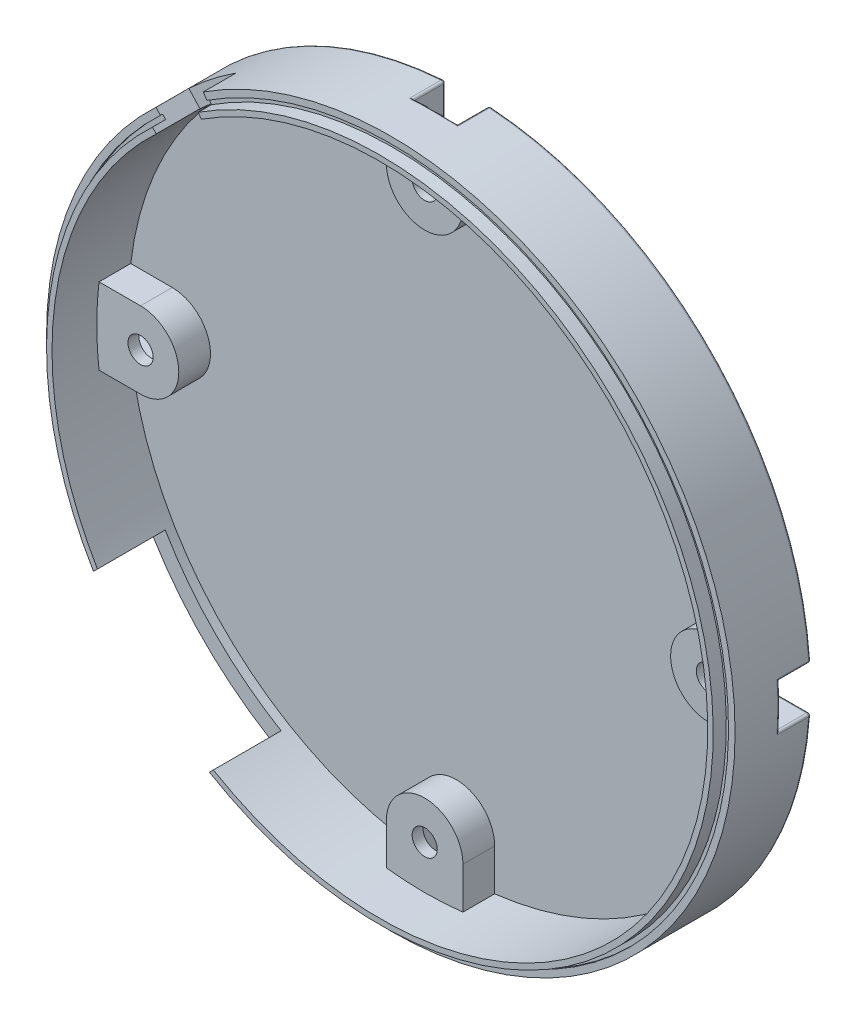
ISO-10303-21;
HEADER;
FILE_DESCRIPTION(('STEP AP214'),'2;1');
FILE_NAME('part.step','',(''),(''),'','','');
FILE_SCHEMA(('AUTOMOTIVE_DESIGN { 1 0 10303 214 1 1 1 1 }'));
ENDSEC;
DATA;
#1=APPLICATION_CONTEXT('core data for automotive mechanical design processes');
#2=APPLICATION_PROTOCOL_DEFINITION('international standard','automotive_design',2000,#1);
#3=PRODUCT_CONTEXT('',#1,'mechanical');
#4=PRODUCT('Part','Part','',(#3));
#5=PRODUCT_RELATED_PRODUCT_CATEGORY('part','',(#4));
#6=PRODUCT_DEFINITION_FORMATION('','',#4);
#7=PRODUCT_DEFINITION_CONTEXT('part definition',#1,'design');
#8=PRODUCT_DEFINITION('design','',#6,#7);
#9=PRODUCT_DEFINITION_SHAPE('','',#8);
#10=(LENGTH_UNIT() NAMED_UNIT(*) SI_UNIT(.MILLI.,.METRE.));
#11=(NAMED_UNIT(*) PLANE_ANGLE_UNIT() SI_UNIT($,.RADIAN.));
#12=(NAMED_UNIT(*) SI_UNIT($,.STERADIAN.) SOLID_ANGLE_UNIT());
#13=UNCERTAINTY_MEASURE_WITH_UNIT(LENGTH_MEASURE(1.E-05),#10,'distance_accuracy_value','');
#14=(GEOMETRIC_REPRESENTATION_CONTEXT(3) GLOBAL_UNCERTAINTY_ASSIGNED_CONTEXT((#13)) GLOBAL_UNIT_ASSIGNED_CONTEXT((#10,
#11,#12)) REPRESENTATION_CONTEXT('',''));
#15=CARTESIAN_POINT('',(0.,0.,0.));
#16=DIRECTION('',(0.,0.,1.));
#17=DIRECTION('',(1.,0.,0.));
#18=AXIS2_PLACEMENT_3D('',#15,#16,#17);
#19=CARTESIAN_POINT('',(3.5,-26.,4.));
#20=DIRECTION('',(-1.,0.,0.));
#21=DIRECTION('',(0.,0.,1.));
#22=AXIS2_PLACEMENT_3D('',#19,#20,#21);
#23=PLANE('',#22);
#24=DIRECTION('',(0.,1.,0.));
#25=VECTOR('',#24,1.);
#26=CARTESIAN_POINT('',(3.5,-29.79513383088,2.9));
#27=LINE('',#26,#25);
#28=CARTESIAN_POINT('',(3.5,-29.79513383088,2.9));
#29=VERTEX_POINT('',#28);
#30=CARTESIAN_POINT('',(3.5,-26.,2.9));
#31=VERTEX_POINT('',#30);
#32=EDGE_CURVE('E1281',#29,#31,#27,.T.);
#33=ORIENTED_EDGE('',*,*,#32,.F.);
#34=DIRECTION('',(0.,0.,-1.));
#35=VECTOR('',#34,1.);
#36=CARTESIAN_POINT('',(3.5,-29.79513383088,2.9));
#37=LINE('',#36,#35);
#38=CARTESIAN_POINT('',(3.5,-29.79513383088,0.));
#39=VERTEX_POINT('',#38);
#40=EDGE_CURVE('E1108',#29,#39,#37,.T.);
#41=ORIENTED_EDGE('',*,*,#40,.T.);
#42=DIRECTION('',(0.,1.,0.));
#43=VECTOR('',#42,1.);
#44=CARTESIAN_POINT('',(3.5,-29.79513383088,0.));
#45=LINE('',#44,#43);
#46=CARTESIAN_POINT('',(3.5,-26.,0.));
#47=VERTEX_POINT('',#46);
#48=EDGE_CURVE('E1236',#39,#47,#45,.T.);
#49=ORIENTED_EDGE('',*,*,#48,.T.);
#50=DIRECTION('',(0.,0.,1.));
#51=VECTOR('',#50,1.);
#52=CARTESIAN_POINT('',(3.5,-26.,0.));
#53=LINE('',#52,#51);
#54=EDGE_CURVE('E11',#47,#31,#53,.T.);
#55=ORIENTED_EDGE('',*,*,#54,.T.);
#56=EDGE_LOOP('',(#33,#41,#49,#55));
#57=FACE_BOUND('',#56,.T.);
#58=ADVANCED_FACE('F17',(#57),#23,.F.);
#59=CARTESIAN_POINT('',(0.,-26.,4.));
#60=DIRECTION('',(0.,0.,-1.));
#61=DIRECTION('',(-1.,0.,0.));
#62=AXIS2_PLACEMENT_3D('',#59,#60,#61);
#63=CYLINDRICAL_SURFACE('',#62,3.5);
#64=CARTESIAN_POINT('',(0.,-26.,0.));
#65=DIRECTION('',(0.,0.,1.));
#66=DIRECTION('',(1.,1.075964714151E-13,0.));
#67=AXIS2_PLACEMENT_3D('',#64,#65,#66);
#68=CIRCLE('',#67,3.5);
#69=CARTESIAN_POINT('',(-3.5,-26.,0.));
#70=VERTEX_POINT('',#69);
#71=EDGE_CURVE('E1233',#47,#70,#68,.T.);
#72=ORIENTED_EDGE('',*,*,#71,.T.);
#73=DIRECTION('',(0.,0.,-1.));
#74=VECTOR('',#73,1.);
#75=CARTESIAN_POINT('',(-3.5,-26.,2.9));
#76=LINE('',#75,#74);
#77=CARTESIAN_POINT('',(-3.5,-26.,2.9));
#78=VERTEX_POINT('',#77);
#79=EDGE_CURVE('E29',#78,#70,#76,.T.);
#80=ORIENTED_EDGE('',*,*,#79,.F.);
#81=CARTESIAN_POINT('',(0.,-26.,2.9));
#82=DIRECTION('',(0.,0.,-1.));
#83=DIRECTION('',(-1.,0.,0.));
#84=AXIS2_PLACEMENT_3D('',#81,#82,#83);
#85=CIRCLE('',#84,3.5);
#86=EDGE_CURVE('E1273',#78,#31,#85,.T.);
#87=ORIENTED_EDGE('',*,*,#86,.T.);
#88=ORIENTED_EDGE('',*,*,#54,.F.);
#89=EDGE_LOOP('',(#72,#80,#87,#88));
#90=FACE_BOUND('',#89,.T.);
#91=ADVANCED_FACE('F19',(#90),#63,.T.);
#92=CARTESIAN_POINT('',(-3.5,-26.,4.));
#93=DIRECTION('',(1.,0.,0.));
#94=DIRECTION('',(0.,1.,0.));
#95=AXIS2_PLACEMENT_3D('',#92,#93,#94);
#96=PLANE('',#95);
#97=DIRECTION('',(0.,-1.,0.));
#98=VECTOR('',#97,1.);
#99=CARTESIAN_POINT('',(-3.5,-26.,0.));
#100=LINE('',#99,#98);
#101=CARTESIAN_POINT('',(-3.5,-29.79513383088,0.));
#102=VERTEX_POINT('',#101);
#103=EDGE_CURVE('E1230',#70,#102,#100,.T.);
#104=ORIENTED_EDGE('',*,*,#103,.T.);
#105=DIRECTION('',(0.,0.,1.));
#106=VECTOR('',#105,1.);
#107=CARTESIAN_POINT('',(-3.5,-29.79513383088,0.));
#108=LINE('',#107,#106);
#109=CARTESIAN_POINT('',(-3.5,-29.79513383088,2.9));
#110=VERTEX_POINT('',#109);
#111=EDGE_CURVE('E1170',#102,#110,#108,.T.);
#112=ORIENTED_EDGE('',*,*,#111,.T.);
#113=DIRECTION('',(0.,-1.,0.));
#114=VECTOR('',#113,1.);
#115=CARTESIAN_POINT('',(-3.5,-26.,2.9));
#116=LINE('',#115,#114);
#117=EDGE_CURVE('E1255',#78,#110,#116,.T.);
#118=ORIENTED_EDGE('',*,*,#117,.F.);
#119=ORIENTED_EDGE('',*,*,#79,.T.);
#120=EDGE_LOOP('',(#104,#112,#118,#119));
#121=FACE_BOUND('',#120,.T.);
#122=ADVANCED_FACE('F1807',(#121),#96,.F.);
#123=CARTESIAN_POINT('',(0.,-26.,2.9));
#124=DIRECTION('',(0.,0.,1.));
#125=DIRECTION('',(1.,0.,0.));
#126=AXIS2_PLACEMENT_3D('',#123,#124,#125);
#127=PLANE('',#126);
#128=CARTESIAN_POINT('',(0.,-26.,2.9));
#129=DIRECTION('',(0.,0.,1.));
#130=DIRECTION('',(1.,0.,0.));
#131=AXIS2_PLACEMENT_3D('',#128,#129,#130);
#132=CIRCLE('',#131,1.15);
#133=CARTESIAN_POINT('',(1.15,-26.,2.9));
#134=VERTEX_POINT('',#133);
#135=EDGE_CURVE('E1465',#134,#134,#132,.T.);
#136=ORIENTED_EDGE('',*,*,#135,.F.);
#137=EDGE_LOOP('',(#136));
#138=FACE_BOUND('',#137,.T.);
#139=CARTESIAN_POINT('',(0.,0.,2.9));
#140=DIRECTION('',(0.,0.,-1.));
#141=DIRECTION('',(0.116666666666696,-0.993171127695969,0.));
#142=AXIS2_PLACEMENT_3D('',#139,#140,#141);
#143=CIRCLE('',#142,30.);
#144=EDGE_CURVE('E1115',#29,#110,#143,.T.);
#145=ORIENTED_EDGE('',*,*,#144,.F.);
#146=ORIENTED_EDGE('',*,*,#32,.T.);
#147=ORIENTED_EDGE('',*,*,#86,.F.);
#148=ORIENTED_EDGE('',*,*,#117,.T.);
#149=EDGE_LOOP('',(#145,#146,#147,#148));
#150=FACE_BOUND('',#149,.T.);
#151=ADVANCED_FACE('F1602',(#138,#150),#127,.T.);
#152=CARTESIAN_POINT('',(0.,-26.,16.));
#153=DIRECTION('',(0.,0.,-1.));
#154=DIRECTION('',(-1.,0.,0.));
#155=AXIS2_PLACEMENT_3D('',#152,#153,#154);
#156=CYLINDRICAL_SURFACE('',#155,1.15);
#157=ORIENTED_EDGE('',*,*,#135,.T.);
#158=DIRECTION('',(0.,0.,-1.));
#159=VECTOR('',#158,1.);
#160=CARTESIAN_POINT('',(1.15,-26.,16.));
#161=LINE('',#160,#159);
#162=CARTESIAN_POINT('',(1.15,-26.,1.9));
#163=VERTEX_POINT('',#162);
#164=EDGE_CURVE('E1285',#134,#163,#161,.T.);
#165=ORIENTED_EDGE('',*,*,#164,.T.);
#166=CARTESIAN_POINT('',(0.,-26.,1.9));
#167=DIRECTION('',(0.,0.,-1.));
#168=DIRECTION('',(-1.,0.,0.));
#169=AXIS2_PLACEMENT_3D('',#166,#167,#168);
#170=CIRCLE('',#169,1.15);
#171=EDGE_CURVE('E1419',#163,#163,#170,.T.);
#172=ORIENTED_EDGE('',*,*,#171,.T.);
#173=ORIENTED_EDGE('',*,*,#164,.F.);
#174=EDGE_LOOP('',(#157,#165,#172,#173));
#175=FACE_BOUND('',#174,.T.);
#176=ADVANCED_FACE('F1598',(#175),#156,.F.);
#177=CARTESIAN_POINT('',(2.2,-31.34222715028,-0.8));
#178=DIRECTION('',(0.,1.,0.));
#179=DIRECTION('',(0.,0.,-1.));
#180=AXIS2_PLACEMENT_3D('',#177,#178,#179);
#181=CYLINDRICAL_SURFACE('',#180,0.2);
#182=DIRECTION('',(0.,1.,0.));
#183=VECTOR('',#182,1.);
#184=CARTESIAN_POINT('',(2.2,-31.2225879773,-1.));
#185=LINE('',#184,#183);
#186=CARTESIAN_POINT('',(2.2,-31.2225879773,-1.));
#187=VERTEX_POINT('',#186);
#188=CARTESIAN_POINT('',(2.20000000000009,-26.00000000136,-1.));
#189=VERTEX_POINT('',#188);
#190=EDGE_CURVE('E917',#187,#189,#185,.T.);
#191=ORIENTED_EDGE('',*,*,#190,.F.);
#192=CARTESIAN_POINT('',(2.2,-31.2225879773,-0.8));
#193=DIRECTION('',(0.,1.,0.));
#194=DIRECTION('',(0.,0.,-1.));
#195=AXIS2_PLACEMENT_3D('',#192,#193,#194);
#196=CIRCLE('',#195,0.2);
#197=CARTESIAN_POINT('',(2.,-31.22258797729,-0.8));
#198=VERTEX_POINT('',#197);
#199=EDGE_CURVE('E1380',#187,#198,#196,.T.);
#200=ORIENTED_EDGE('',*,*,#199,.T.);
#201=DIRECTION('',(0.,-1.,0.));
#202=VECTOR('',#201,1.);
#203=CARTESIAN_POINT('',(2.,-26.00000000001,-0.8));
#204=LINE('',#203,#202);
#205=CARTESIAN_POINT('',(2.,-26.00000000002,-0.8));
#206=VERTEX_POINT('',#205);
#207=EDGE_CURVE('E1462',#206,#198,#204,.T.);
#208=ORIENTED_EDGE('',*,*,#207,.F.);
#209=CARTESIAN_POINT('',(2.2,-26.,-0.8));
#210=DIRECTION('',(0.,-1.,0.));
#211=DIRECTION('',(-1.,0.,0.));
#212=AXIS2_PLACEMENT_3D('',#209,#210,#211);
#213=CIRCLE('',#212,0.2);
#214=EDGE_CURVE('E1040',#206,#189,#213,.T.);
#215=ORIENTED_EDGE('',*,*,#214,.T.);
#216=EDGE_LOOP('',(#191,#200,#208,#215));
#217=FACE_BOUND('',#216,.T.);
#218=ADVANCED_FACE('F1601',(#217),#181,.T.);
#219=CARTESIAN_POINT('',(2.,-26.,3.));
#220=DIRECTION('',(1.,0.,0.));
#221=DIRECTION('',(0.,1.,0.));
#222=AXIS2_PLACEMENT_3D('',#219,#220,#221);
#223=PLANE('',#222);
#224=ORIENTED_EDGE('',*,*,#207,.T.);
#225=DIRECTION('',(0.,6.750155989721E-13,1.));
#226=VECTOR('',#225,1.);
#227=CARTESIAN_POINT('',(2.,-31.22258797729,-0.8));
#228=LINE('',#227,#226);
#229=CARTESIAN_POINT('',(2.,-31.2225879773,1.9));
#230=VERTEX_POINT('',#229);
#231=EDGE_CURVE('E1388',#198,#230,#228,.T.);
#232=ORIENTED_EDGE('',*,*,#231,.T.);
#233=DIRECTION('',(0.,-1.,0.));
#234=VECTOR('',#233,1.);
#235=CARTESIAN_POINT('',(2.,-26.00000000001,1.9));
#236=LINE('',#235,#234);
#237=CARTESIAN_POINT('',(2.,-26.00000000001,1.9));
#238=VERTEX_POINT('',#237);
#239=EDGE_CURVE('E1416',#238,#230,#236,.T.);
#240=ORIENTED_EDGE('',*,*,#239,.F.);
#241=DIRECTION('',(0.,1.100025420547E-12,-1.));
#242=VECTOR('',#241,1.);
#243=CARTESIAN_POINT('',(2.,-26.00000000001,1.9));
#244=LINE('',#243,#242);
#245=EDGE_CURVE('E1039',#238,#206,#244,.T.);
#246=ORIENTED_EDGE('',*,*,#245,.T.);
#247=EDGE_LOOP('',(#224,#232,#240,#246));
#248=FACE_BOUND('',#247,.T.);
#249=ADVANCED_FACE('F1640',(#248),#223,.F.);
#250=CARTESIAN_POINT('',(0.,-26.,3.));
#251=DIRECTION('',(0.,0.,-1.));
#252=DIRECTION('',(-1.,0.,0.));
#253=AXIS2_PLACEMENT_3D('',#250,#251,#252);
#254=CYLINDRICAL_SURFACE('',#253,2.);
#255=CARTESIAN_POINT('',(0.,-26.,-0.8));
#256=DIRECTION('',(0.,0.,-1.));
#257=DIRECTION('',(-0.995228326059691,0.0975734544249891,0.));
#258=AXIS2_PLACEMENT_3D('',#255,#256,#257);
#259=CIRCLE('',#258,2.);
#260=CARTESIAN_POINT('',(-2.,-26.,-0.8));
#261=VERTEX_POINT('',#260);
#262=EDGE_CURVE('E1035',#261,#206,#259,.T.);
#263=ORIENTED_EDGE('',*,*,#262,.T.);
#264=ORIENTED_EDGE('',*,*,#245,.F.);
#265=CARTESIAN_POINT('',(0.,-26.,1.9));
#266=DIRECTION('',(0.,0.,1.));
#267=DIRECTION('',(1.,0.,0.));
#268=AXIS2_PLACEMENT_3D('',#265,#266,#267);
#269=CIRCLE('',#268,2.);
#270=CARTESIAN_POINT('',(-2.,-26.,1.9));
#271=VERTEX_POINT('',#270);
#272=EDGE_CURVE('E1412',#238,#271,#269,.T.);
#273=ORIENTED_EDGE('',*,*,#272,.T.);
#274=DIRECTION('',(0.,0.,1.));
#275=VECTOR('',#274,1.);
#276=CARTESIAN_POINT('',(-2.,-26.,-0.8));
#277=LINE('',#276,#275);
#278=EDGE_CURVE('E1443',#261,#271,#277,.T.);
#279=ORIENTED_EDGE('',*,*,#278,.F.);
#280=EDGE_LOOP('',(#263,#264,#273,#279));
#281=FACE_BOUND('',#280,.T.);
#282=ADVANCED_FACE('F1636',(#281),#254,.F.);
#283=CARTESIAN_POINT('',(0.,-26.,-0.8));
#284=DIRECTION('',(0.,0.,-1.));
#285=DIRECTION('',(3.09090600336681E-10,1.,0.));
#286=AXIS2_PLACEMENT_3D('',#283,#284,#285);
#287=TOROIDAL_SURFACE('',#286,2.2,0.2);
#288=CARTESIAN_POINT('',(0.,-26.,-1.));
#289=DIRECTION('',(0.,0.,-1.));
#290=DIRECTION('',(-1.,1.389836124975E-09,0.));
#291=AXIS2_PLACEMENT_3D('',#288,#289,#290);
#292=CIRCLE('',#291,2.2);
#293=CARTESIAN_POINT('',(-2.2,-25.99999999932,-1.));
#294=VERTEX_POINT('',#293);
#295=EDGE_CURVE('E913',#294,#189,#292,.T.);
#296=ORIENTED_EDGE('',*,*,#295,.T.);
#297=ORIENTED_EDGE('',*,*,#214,.F.);
#298=ORIENTED_EDGE('',*,*,#262,.F.);
#299=CARTESIAN_POINT('',(-2.2,-26.,-0.8));
#300=DIRECTION('',(0.,-1.,0.));
#301=DIRECTION('',(0.,0.,-1.));
#302=AXIS2_PLACEMENT_3D('',#299,#300,#301);
#303=CIRCLE('',#302,0.2);
#304=EDGE_CURVE('E1446',#294,#261,#303,.T.);
#305=ORIENTED_EDGE('',*,*,#304,.F.);
#306=EDGE_LOOP('',(#296,#297,#298,#305));
#307=FACE_BOUND('',#306,.T.);
#308=ADVANCED_FACE('F1639',(#307),#287,.T.);
#309=CARTESIAN_POINT('',(-26.,0.,16.));
#310=DIRECTION('',(0.,0.,-1.));
#311=DIRECTION('',(-1.,0.,0.));
#312=AXIS2_PLACEMENT_3D('',#309,#310,#311);
#313=CYLINDRICAL_SURFACE('',#312,1.15);
#314=CARTESIAN_POINT('',(-26.,0.,2.9));
#315=DIRECTION('',(0.,0.,1.));
#316=DIRECTION('',(-1.,0.,0.));
#317=AXIS2_PLACEMENT_3D('',#314,#315,#316);
#318=CIRCLE('',#317,1.15);
#319=CARTESIAN_POINT('',(-24.85,0.,2.9));
#320=VERTEX_POINT('',#319);
#321=EDGE_CURVE('E1222',#320,#320,#318,.T.);
#322=ORIENTED_EDGE('',*,*,#321,.T.);
#323=DIRECTION('',(0.,0.,-1.));
#324=VECTOR('',#323,1.);
#325=CARTESIAN_POINT('',(-24.85,0.,16.));
#326=LINE('',#325,#324);
#327=CARTESIAN_POINT('',(-24.85,0.,1.9));
#328=VERTEX_POINT('',#327);
#329=EDGE_CURVE('E1293',#320,#328,#326,.T.);
#330=ORIENTED_EDGE('',*,*,#329,.T.);
#331=CARTESIAN_POINT('',(-26.,0.,1.9));
#332=DIRECTION('',(0.,0.,-1.));
#333=DIRECTION('',(-1.,0.,0.));
#334=AXIS2_PLACEMENT_3D('',#331,#332,#333);
#335=CIRCLE('',#334,1.15);
#336=EDGE_CURVE('E1491',#328,#328,#335,.T.);
#337=ORIENTED_EDGE('',*,*,#336,.T.);
#338=ORIENTED_EDGE('',*,*,#329,.F.);
#339=EDGE_LOOP('',(#322,#330,#337,#338));
#340=FACE_BOUND('',#339,.T.);
#341=ADVANCED_FACE('F1697',(#340),#313,.F.);
#342=CARTESIAN_POINT('',(-26.,0.,3.));
#343=DIRECTION('',(0.,0.,-1.));
#344=DIRECTION('',(1.,1.05483433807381E-12,0.));
#345=AXIS2_PLACEMENT_3D('',#342,#343,#344);
#346=CYLINDRICAL_SURFACE('',#345,2.);
#347=CARTESIAN_POINT('',(-26.,0.,-0.8));
#348=DIRECTION('',(0.,0.,-1.));
#349=DIRECTION('',(1.,0.,0.));
#350=AXIS2_PLACEMENT_3D('',#347,#348,#349);
#351=CIRCLE('',#350,2.);
#352=CARTESIAN_POINT('',(-26.,2.,-0.8));
#353=VERTEX_POINT('',#352);
#354=CARTESIAN_POINT('',(-26.00000000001,-2.,-0.8));
#355=VERTEX_POINT('',#354);
#356=EDGE_CURVE('E779',#353,#355,#351,.T.);
#357=ORIENTED_EDGE('',*,*,#356,.T.);
#358=DIRECTION('',(6.263302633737E-13,0.,-1.));
#359=VECTOR('',#358,1.);
#360=CARTESIAN_POINT('',(-26.00000000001,-2.,1.9));
#361=LINE('',#360,#359);
#362=CARTESIAN_POINT('',(-26.00000000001,-2.,1.9));
#363=VERTEX_POINT('',#362);
#364=EDGE_CURVE('E1498',#363,#355,#361,.T.);
#365=ORIENTED_EDGE('',*,*,#364,.F.);
#366=CARTESIAN_POINT('',(-26.,0.,1.9));
#367=DIRECTION('',(0.,0.,1.));
#368=DIRECTION('',(1.,0.,0.));
#369=AXIS2_PLACEMENT_3D('',#366,#367,#368);
#370=CIRCLE('',#369,2.);
#371=CARTESIAN_POINT('',(-26.,2.,1.9));
#372=VERTEX_POINT('',#371);
#373=EDGE_CURVE('E1477',#363,#372,#370,.T.);
#374=ORIENTED_EDGE('',*,*,#373,.T.);
#375=DIRECTION('',(-1.561878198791E-12,0.,1.));
#376=VECTOR('',#375,1.);
#377=CARTESIAN_POINT('',(-26.00000000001,2.,-0.8));
#378=LINE('',#377,#376);
#379=EDGE_CURVE('E1296',#353,#372,#378,.T.);
#380=ORIENTED_EDGE('',*,*,#379,.F.);
#381=EDGE_LOOP('',(#357,#365,#374,#380));
#382=FACE_BOUND('',#381,.T.);
#383=ADVANCED_FACE('F1693',(#382),#346,.F.);
#384=CARTESIAN_POINT('',(-26.,2.,3.));
#385=DIRECTION('',(0.,1.,0.));
#386=DIRECTION('',(1.,0.,0.));
#387=AXIS2_PLACEMENT_3D('',#384,#385,#386);
#388=PLANE('',#387);
#389=DIRECTION('',(1.,0.,0.));
#390=VECTOR('',#389,1.);
#391=CARTESIAN_POINT('',(-31.2225879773,2.,-0.8));
#392=LINE('',#391,#390);
#393=CARTESIAN_POINT('',(-31.2225879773,2.,-0.8));
#394=VERTEX_POINT('',#393);
#395=EDGE_CURVE('E1510',#394,#353,#392,.T.);
#396=ORIENTED_EDGE('',*,*,#395,.T.);
#397=ORIENTED_EDGE('',*,*,#379,.T.);
#398=DIRECTION('',(1.,0.,0.));
#399=VECTOR('',#398,1.);
#400=CARTESIAN_POINT('',(-31.2225879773,2.,1.9));
#401=LINE('',#400,#399);
#402=CARTESIAN_POINT('',(-31.2225879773,2.,1.9));
#403=VERTEX_POINT('',#402);
#404=EDGE_CURVE('E1473',#403,#372,#401,.T.);
#405=ORIENTED_EDGE('',*,*,#404,.F.);
#406=DIRECTION('',(0.,0.,-1.));
#407=VECTOR('',#406,1.);
#408=CARTESIAN_POINT('',(-31.2225879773,2.,1.9));
#409=LINE('',#408,#407);
#410=EDGE_CURVE('E1020',#403,#394,#409,.T.);
#411=ORIENTED_EDGE('',*,*,#410,.T.);
#412=EDGE_LOOP('',(#396,#397,#405,#411));
#413=FACE_BOUND('',#412,.T.);
#414=ADVANCED_FACE('F1696',(#413),#388,.F.);
#415=CARTESIAN_POINT('',(-25.8624074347,2.2,-0.8));
#416=DIRECTION('',(-1.,0.,0.));
#417=DIRECTION('',(0.,0.,-1.));
#418=AXIS2_PLACEMENT_3D('',#415,#416,#417);
#419=CYLINDRICAL_SURFACE('',#418,0.2);
#420=DIRECTION('',(-1.,0.,0.));
#421=VECTOR('',#420,1.);
#422=CARTESIAN_POINT('',(-25.99999999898,2.2,-1.));
#423=LINE('',#422,#421);
#424=CARTESIAN_POINT('',(-25.99999999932,2.19999999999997,-1.));
#425=VERTEX_POINT('',#424);
#426=CARTESIAN_POINT('',(-31.2225879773,2.2,-1.));
#427=VERTEX_POINT('',#426);
#428=EDGE_CURVE('E1001',#425,#427,#423,.T.);
#429=ORIENTED_EDGE('',*,*,#428,.F.);
#430=CARTESIAN_POINT('',(-26.,2.2,-0.8));
#431=DIRECTION('',(-1.,0.,0.));
#432=DIRECTION('',(0.,4.529709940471E-13,-1.));
#433=AXIS2_PLACEMENT_3D('',#430,#431,#432);
#434=CIRCLE('',#433,0.2);
#435=EDGE_CURVE('E782',#425,#353,#434,.T.);
#436=ORIENTED_EDGE('',*,*,#435,.T.);
#437=ORIENTED_EDGE('',*,*,#395,.F.);
#438=CARTESIAN_POINT('',(-31.2225879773,2.2,-0.8));
#439=DIRECTION('',(1.,0.,0.));
#440=DIRECTION('',(0.,-1.,0.));
#441=AXIS2_PLACEMENT_3D('',#438,#439,#440);
#442=CIRCLE('',#441,0.2);
#443=EDGE_CURVE('E740',#394,#427,#442,.T.);
#444=ORIENTED_EDGE('',*,*,#443,.T.);
#445=EDGE_LOOP('',(#429,#436,#437,#444));
#446=FACE_BOUND('',#445,.T.);
#447=ADVANCED_FACE('F1706',(#446),#419,.T.);
#448=CARTESIAN_POINT('',(-26.,0.,-0.8));
#449=DIRECTION('',(0.,0.,-1.));
#450=DIRECTION('',(1.,-3.08080741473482E-10,0.));
#451=AXIS2_PLACEMENT_3D('',#448,#449,#450);
#452=TOROIDAL_SURFACE('',#451,2.2,0.2);
#453=CARTESIAN_POINT('',(-26.,0.,-1.));
#454=DIRECTION('',(0.,0.,-1.));
#455=DIRECTION('',(1.387284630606E-09,1.,0.));
#456=AXIS2_PLACEMENT_3D('',#453,#454,#455);
#457=CIRCLE('',#456,2.2);
#458=CARTESIAN_POINT('',(-26.0000000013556,-2.20000000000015,-1.));
#459=VERTEX_POINT('',#458);
#460=EDGE_CURVE('E997',#425,#459,#457,.T.);
#461=ORIENTED_EDGE('',*,*,#460,.T.);
#462=CARTESIAN_POINT('',(-26.,-2.2,-0.8));
#463=DIRECTION('',(-1.,0.,0.));
#464=DIRECTION('',(0.,1.,0.));
#465=AXIS2_PLACEMENT_3D('',#462,#463,#464);
#466=CIRCLE('',#465,0.2);
#467=EDGE_CURVE('E783',#355,#459,#466,.T.);
#468=ORIENTED_EDGE('',*,*,#467,.F.);
#469=ORIENTED_EDGE('',*,*,#356,.F.);
#470=ORIENTED_EDGE('',*,*,#435,.F.);
#471=EDGE_LOOP('',(#461,#468,#469,#470));
#472=FACE_BOUND('',#471,.T.);
#473=ADVANCED_FACE('F1702',(#472),#452,.T.);
#474=CARTESIAN_POINT('',(-31.3601805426,-2.2,-0.8));
#475=DIRECTION('',(1.,0.,0.));
#476=DIRECTION('',(0.,0.,-1.));
#477=AXIS2_PLACEMENT_3D('',#474,#475,#476);
#478=CYLINDRICAL_SURFACE('',#477,0.2);
#479=DIRECTION('',(1.,0.,0.));
#480=VECTOR('',#479,1.);
#481=CARTESIAN_POINT('',(-31.2225879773,-2.2,-1.));
#482=LINE('',#481,#480);
#483=CARTESIAN_POINT('',(-31.2225879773,-2.2,-1.));
#484=VERTEX_POINT('',#483);
#485=EDGE_CURVE('E734',#484,#459,#482,.T.);
#486=ORIENTED_EDGE('',*,*,#485,.F.);
#487=CARTESIAN_POINT('',(-31.2225879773,-2.2,-0.8));
#488=DIRECTION('',(1.,0.,0.));
#489=DIRECTION('',(0.,0.,-1.));
#490=AXIS2_PLACEMENT_3D('',#487,#488,#489);
#491=CIRCLE('',#490,0.2);
#492=CARTESIAN_POINT('',(-31.22258797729,-2.,-0.8));
#493=VERTEX_POINT('',#492);
#494=EDGE_CURVE('E1468',#484,#493,#491,.T.);
#495=ORIENTED_EDGE('',*,*,#494,.T.);
#496=DIRECTION('',(-1.,0.,0.));
#497=VECTOR('',#496,1.);
#498=CARTESIAN_POINT('',(-26.00000000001,-2.,-0.8));
#499=LINE('',#498,#497);
#500=EDGE_CURVE('E1495',#355,#493,#499,.T.);
#501=ORIENTED_EDGE('',*,*,#500,.F.);
#502=ORIENTED_EDGE('',*,*,#467,.T.);
#503=EDGE_LOOP('',(#486,#495,#501,#502));
#504=FACE_BOUND('',#503,.T.);
#505=ADVANCED_FACE('F1705',(#504),#478,.T.);
#506=CARTESIAN_POINT('',(-26.,-2.,3.));
#507=DIRECTION('',(0.,-1.,0.));
#508=DIRECTION('',(0.,0.,-1.));
#509=AXIS2_PLACEMENT_3D('',#506,#507,#508);
#510=PLANE('',#509);
#511=ORIENTED_EDGE('',*,*,#500,.T.);
#512=DIRECTION('',(6.750155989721E-13,0.,1.));
#513=VECTOR('',#512,1.);
#514=CARTESIAN_POINT('',(-31.22258797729,-2.,-0.8));
#515=LINE('',#514,#513);
#516=CARTESIAN_POINT('',(-31.2225879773,-2.,1.9));
#517=VERTEX_POINT('',#516);
#518=EDGE_CURVE('E1478',#493,#517,#515,.T.);
#519=ORIENTED_EDGE('',*,*,#518,.T.);
#520=DIRECTION('',(-1.,0.,0.));
#521=VECTOR('',#520,1.);
#522=CARTESIAN_POINT('',(-26.00000000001,-2.,1.9));
#523=LINE('',#522,#521);
#524=EDGE_CURVE('E1488',#363,#517,#523,.T.);
#525=ORIENTED_EDGE('',*,*,#524,.F.);
#526=ORIENTED_EDGE('',*,*,#364,.T.);
#527=EDGE_LOOP('',(#511,#519,#525,#526));
#528=FACE_BOUND('',#527,.T.);
#529=ADVANCED_FACE('F1789',(#528),#510,.F.);
#530=CARTESIAN_POINT('',(-26.,0.,1.9));
#531=DIRECTION('',(0.,0.,-1.));
#532=DIRECTION('',(0.,-1.,0.));
#533=AXIS2_PLACEMENT_3D('',#530,#531,#532);
#534=PLANE('',#533);
#535=ORIENTED_EDGE('',*,*,#336,.F.);
#536=EDGE_LOOP('',(#535));
#537=FACE_BOUND('',#536,.T.);
#538=CARTESIAN_POINT('',(0.,0.,1.9));
#539=DIRECTION('',(0.,0.,1.));
#540=DIRECTION('',(-0.997955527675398,0.0639121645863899,0.));
#541=AXIS2_PLACEMENT_3D('',#538,#539,#540);
#542=CIRCLE('',#541,31.29999999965);
#543=CARTESIAN_POINT('',(-31.23600801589,2.000450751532,1.9));
#544=VERTEX_POINT('',#543);
#545=CARTESIAN_POINT('',(-31.23600801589,-2.000450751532,1.9));
#546=VERTEX_POINT('',#545);
#547=EDGE_CURVE('E1107',#544,#546,#542,.T.);
#548=ORIENTED_EDGE('',*,*,#547,.F.);
#549=CARTESIAN_POINT('',(-31.2225879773,2.2,1.9));
#550=DIRECTION('',(0.,0.,-1.));
#551=DIRECTION('',(0.,-1.,0.));
#552=AXIS2_PLACEMENT_3D('',#549,#550,#551);
#553=CIRCLE('',#552,0.2);
#554=EDGE_CURVE('E1015',#403,#544,#553,.T.);
#555=ORIENTED_EDGE('',*,*,#554,.F.);
#556=ORIENTED_EDGE('',*,*,#404,.T.);
#557=ORIENTED_EDGE('',*,*,#373,.F.);
#558=ORIENTED_EDGE('',*,*,#524,.T.);
#559=CARTESIAN_POINT('',(-31.2225879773,-2.2,1.9));
#560=DIRECTION('',(0.,0.,-1.));
#561=DIRECTION('',(-0.0671001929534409,0.997746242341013,0.));
#562=AXIS2_PLACEMENT_3D('',#559,#560,#561);
#563=CIRCLE('',#562,0.2);
#564=EDGE_CURVE('E1472',#546,#517,#563,.T.);
#565=ORIENTED_EDGE('',*,*,#564,.F.);
#566=EDGE_LOOP('',(#548,#555,#556,#557,#558,#565));
#567=FACE_BOUND('',#566,.T.);
#568=ADVANCED_FACE('F1792',(#537,#567),#534,.T.);
#569=CARTESIAN_POINT('',(-31.2225879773,-2.2,18.4288));
#570=DIRECTION('',(0.,0.,-1.));
#571=DIRECTION('',(-0.997526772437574,-0.0702875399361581,0.));
#572=AXIS2_PLACEMENT_3D('',#569,#570,#571);
#573=CYLINDRICAL_SURFACE('',#572,0.2);
#574=ORIENTED_EDGE('',*,*,#564,.T.);
#575=ORIENTED_EDGE('',*,*,#518,.F.);
#576=CARTESIAN_POINT('',(-31.2225879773,-2.2,-0.8));
#577=DIRECTION('',(0.,0.,1.));
#578=DIRECTION('',(5.460520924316E-11,1.,0.));
#579=AXIS2_PLACEMENT_3D('',#576,#577,#578);
#580=CIRCLE('',#579,0.2);
#581=CARTESIAN_POINT('',(-31.42209333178,-2.214057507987,-0.8));
#582=VERTEX_POINT('',#581);
#583=EDGE_CURVE('E1461',#493,#582,#580,.T.);
#584=ORIENTED_EDGE('',*,*,#583,.T.);
#585=DIRECTION('',(-4.034780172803E-11,-2.871266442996E-12,-1.));
#586=VECTOR('',#585,1.);
#587=CARTESIAN_POINT('',(-31.42209333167,-2.214057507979,2.1));
#588=LINE('',#587,#586);
#589=CARTESIAN_POINT('',(-31.42209333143,-2.214057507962,2.1));
#590=VERTEX_POINT('',#589);
#591=EDGE_CURVE('E820',#590,#582,#588,.T.);
#592=ORIENTED_EDGE('',*,*,#591,.F.);
#593=CARTESIAN_POINT('',(-31.4220933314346,-2.21405750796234,2.1));
#594=CARTESIAN_POINT('',(-31.4221403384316,-2.2133903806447,2.09933334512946));
#595=CARTESIAN_POINT('',(-31.4221840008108,-2.21272299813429,2.09866671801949));
#596=CARTESIAN_POINT('',(-31.4234733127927,-2.19137214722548,2.07734567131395));
#597=CARTESIAN_POINT('',(-31.421516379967,-2.17035453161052,2.05658379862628));
#598=CARTESIAN_POINT('',(-31.4110982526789,-2.13018564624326,2.01735185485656));
#599=CARTESIAN_POINT('',(-31.4028785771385,-2.11074686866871,1.99857995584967));
#600=CARTESIAN_POINT('',(-31.379080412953,-2.07343393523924,1.96307330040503));
#601=CARTESIAN_POINT('',(-31.3630472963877,-2.05539331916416,1.94620248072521));
#602=CARTESIAN_POINT('',(-31.3277066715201,-2.02880299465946,1.9221047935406));
#603=CARTESIAN_POINT('',(-31.3102925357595,-2.01906430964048,1.91357246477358));
#604=CARTESIAN_POINT('',(-31.2738233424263,-2.00583194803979,1.90283128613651));
#605=CARTESIAN_POINT('',(-31.2557680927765,-2.0018842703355,1.90010437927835));
#606=CARTESIAN_POINT('',(-31.2367284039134,-2.0005001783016,1.90000097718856));
#607=CARTESIAN_POINT('',(-31.2363681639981,-2.00047497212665,1.9));
#608=CARTESIAN_POINT('',(-31.23600801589,-2.00045075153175,1.9));
#609=(BOUNDED_CURVE() B_SPLINE_CURVE(3,(#593,#594,#595,#596,#597,#598,#599,#600,#601,#602,#603,
#604,#605,#606,#607,#608),.UNSPECIFIED.,.F.,.F.) B_SPLINE_CURVE_WITH_KNOTS((4,2,2,2,2,2,2,4),
(-0.000283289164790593,0.,0.00877704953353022,0.0171439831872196,0.0258422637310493,
0.0323514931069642,0.0380229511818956,0.0381323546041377),
.UNSPECIFIED.) CURVE() GEOMETRIC_REPRESENTATION_ITEM() RATIONAL_B_SPLINE_CURVE((1.,1.,1.,1.,1.,
1.,1.,1.,1.,1.,1.,1.,1.,1.,1.,1.)) REPRESENTATION_ITEM(''));
#610=EDGE_CURVE('E1120',#590,#546,#609,.T.);
#611=ORIENTED_EDGE('',*,*,#610,.T.);
#612=EDGE_LOOP('',(#574,#575,#584,#592,#611));
#613=FACE_BOUND('',#612,.T.);
#614=ADVANCED_FACE('F1586',(#613),#573,.T.);
#615=CARTESIAN_POINT('',(-31.2225879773,-2.2,-0.8));
#616=DIRECTION('',(-0.99752677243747,-0.0702875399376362,0.));
#617=DIRECTION('',(-0.0702875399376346,0.99752677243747,0.));
#618=AXIS2_PLACEMENT_3D('',#615,#616,#617);
#619=SPHERICAL_SURFACE('',#618,0.2);
#620=ORIENTED_EDGE('',*,*,#583,.F.);
#621=ORIENTED_EDGE('',*,*,#494,.F.);
#622=CARTESIAN_POINT('',(-31.2225879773,-2.2,-0.8));
#623=DIRECTION('',(0.0702875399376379,-0.99752677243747,-2.58221794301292E-12));
#624=DIRECTION('',(-0.99752677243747,-0.0702875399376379,0.));
#625=AXIS2_PLACEMENT_3D('',#622,#623,#624);
#626=CIRCLE('',#625,0.2);
#627=EDGE_CURVE('E1457',#582,#484,#626,.T.);
#628=ORIENTED_EDGE('',*,*,#627,.F.);
#629=EDGE_LOOP('',(#620,#621,#628));
#630=FACE_BOUND('',#629,.T.);
#631=ADVANCED_FACE('F1582',(#630),#619,.T.);
#632=CARTESIAN_POINT('',(0.,0.,-0.8));
#633=DIRECTION('',(0.,0.,-1.));
#634=DIRECTION('',(0.999990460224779,0.00436800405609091,0.));
#635=AXIS2_PLACEMENT_3D('',#632,#633,#634);
#636=TOROIDAL_SURFACE('',#635,31.3,0.2);
#637=CARTESIAN_POINT('',(0.,0.,-1.));
#638=DIRECTION('',(0.,0.,1.));
#639=DIRECTION('',(-0.997526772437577,-0.0702875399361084,0.));
#640=AXIS2_PLACEMENT_3D('',#637,#638,#639);
#641=CIRCLE('',#640,31.3);
#642=CARTESIAN_POINT('',(-2.2,-31.2225879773,-1.));
#643=VERTEX_POINT('',#642);
#644=EDGE_CURVE('E730',#484,#643,#641,.T.);
#645=ORIENTED_EDGE('',*,*,#644,.T.);
#646=CARTESIAN_POINT('',(-2.2,-31.2225879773,-0.8));
#647=DIRECTION('',(-0.997526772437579,0.0702875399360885,0.));
#648=DIRECTION('',(-1.33300692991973E-12,-1.89181482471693E-11,-1.));
#649=AXIS2_PLACEMENT_3D('',#646,#647,#648);
#650=CIRCLE('',#649,0.2);
#651=CARTESIAN_POINT('',(-2.214057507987,-31.42209333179,-0.8));
#652=VERTEX_POINT('',#651);
#653=EDGE_CURVE('E1454',#643,#652,#650,.T.);
#654=ORIENTED_EDGE('',*,*,#653,.T.);
#655=CARTESIAN_POINT('',(0.,0.,-0.8));
#656=DIRECTION('',(0.,0.,1.));
#657=DIRECTION('',(-0.997526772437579,-0.0702875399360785,0.));
#658=AXIS2_PLACEMENT_3D('',#655,#656,#657);
#659=CIRCLE('',#658,31.5);
#660=EDGE_CURVE('E857',#582,#652,#659,.T.);
#661=ORIENTED_EDGE('',*,*,#660,.F.);
#662=ORIENTED_EDGE('',*,*,#627,.T.);
#663=EDGE_LOOP('',(#645,#654,#661,#662));
#664=FACE_BOUND('',#663,.T.);
#665=ADVANCED_FACE('F1585',(#664),#636,.T.);
#666=CARTESIAN_POINT('',(-2.2,-31.2225879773,-0.8));
#667=DIRECTION('',(1.,0.,0.));
#668=DIRECTION('',(0.,-1.,0.));
#669=AXIS2_PLACEMENT_3D('',#666,#667,#668);
#670=SPHERICAL_SURFACE('',#669,0.2);
#671=CARTESIAN_POINT('',(-2.2,-31.2225879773,-0.8));
#672=DIRECTION('',(0.,0.,1.));
#673=DIRECTION('',(-0.0702875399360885,-0.997526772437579,0.));
#674=AXIS2_PLACEMENT_3D('',#671,#672,#673);
#675=CIRCLE('',#674,0.2);
#676=CARTESIAN_POINT('',(-2.,-31.2225879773,-0.8));
#677=VERTEX_POINT('',#676);
#678=EDGE_CURVE('E1428',#652,#677,#675,.T.);
#679=ORIENTED_EDGE('',*,*,#678,.F.);
#680=ORIENTED_EDGE('',*,*,#653,.F.);
#681=CARTESIAN_POINT('',(-2.2,-31.2225879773,-0.8));
#682=DIRECTION('',(0.,1.,0.));
#683=DIRECTION('',(1.,0.,0.));
#684=AXIS2_PLACEMENT_3D('',#681,#682,#683);
#685=CIRCLE('',#684,0.2);
#686=EDGE_CURVE('E1450',#677,#643,#685,.T.);
#687=ORIENTED_EDGE('',*,*,#686,.F.);
#688=EDGE_LOOP('',(#679,#680,#687));
#689=FACE_BOUND('',#688,.T.);
#690=ADVANCED_FACE('F1618',(#689),#670,.T.);
#691=CARTESIAN_POINT('',(-2.2,-25.79347156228,-0.8));
#692=DIRECTION('',(0.,-1.,0.));
#693=DIRECTION('',(0.,0.,-1.));
#694=AXIS2_PLACEMENT_3D('',#691,#692,#693);
#695=CYLINDRICAL_SURFACE('',#694,0.2);
#696=DIRECTION('',(0.,-1.,0.));
#697=VECTOR('',#696,1.);
#698=CARTESIAN_POINT('',(-2.2,-25.99999999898,-1.));
#699=LINE('',#698,#697);
#700=EDGE_CURVE('E735',#294,#643,#699,.T.);
#701=ORIENTED_EDGE('',*,*,#700,.F.);
#702=ORIENTED_EDGE('',*,*,#304,.T.);
#703=DIRECTION('',(0.,1.,0.));
#704=VECTOR('',#703,1.);
#705=CARTESIAN_POINT('',(-2.,-31.2225879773,-0.8));
#706=LINE('',#705,#704);
#707=EDGE_CURVE('E1439',#677,#261,#706,.T.);
#708=ORIENTED_EDGE('',*,*,#707,.F.);
#709=ORIENTED_EDGE('',*,*,#686,.T.);
#710=EDGE_LOOP('',(#701,#702,#708,#709));
#711=FACE_BOUND('',#710,.T.);
#712=ADVANCED_FACE('F1614',(#711),#695,.T.);
#713=CARTESIAN_POINT('',(-2.,-26.,3.));
#714=DIRECTION('',(-1.,0.,0.));
#715=DIRECTION('',(0.,0.,1.));
#716=AXIS2_PLACEMENT_3D('',#713,#714,#715);
#717=PLANE('',#716);
#718=ORIENTED_EDGE('',*,*,#707,.T.);
#719=ORIENTED_EDGE('',*,*,#278,.T.);
#720=DIRECTION('',(0.,1.,0.));
#721=VECTOR('',#720,1.);
#722=CARTESIAN_POINT('',(-2.,-31.2225879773,1.9));
#723=LINE('',#722,#721);
#724=CARTESIAN_POINT('',(-2.,-31.2225879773,1.9));
#725=VERTEX_POINT('',#724);
#726=EDGE_CURVE('E1408',#725,#271,#723,.T.);
#727=ORIENTED_EDGE('',*,*,#726,.F.);
#728=DIRECTION('',(0.,0.,-1.));
#729=VECTOR('',#728,1.);
#730=CARTESIAN_POINT('',(-2.,-31.2225879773,1.9));
#731=LINE('',#730,#729);
#732=EDGE_CURVE('E1435',#725,#677,#731,.T.);
#733=ORIENTED_EDGE('',*,*,#732,.T.);
#734=EDGE_LOOP('',(#718,#719,#727,#733));
#735=FACE_BOUND('',#734,.T.);
#736=ADVANCED_FACE('F1617',(#735),#717,.F.);
#737=CARTESIAN_POINT('',(-2.2,-31.2225879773,0.06240743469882));
#738=DIRECTION('',(0.,0.,1.));
#739=DIRECTION('',(-0.0702875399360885,-0.997526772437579,0.));
#740=AXIS2_PLACEMENT_3D('',#737,#738,#739);
#741=CYLINDRICAL_SURFACE('',#740,0.2);
#742=DIRECTION('',(0.,2.217383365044E-13,1.));
#743=VECTOR('',#742,1.);
#744=CARTESIAN_POINT('',(-2.214057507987,-31.42209333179,-0.8));
#745=LINE('',#744,#743);
#746=CARTESIAN_POINT('',(-2.214057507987,-31.42209333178,2.1));
#747=VERTEX_POINT('',#746);
#748=EDGE_CURVE('E861',#652,#747,#745,.T.);
#749=ORIENTED_EDGE('',*,*,#748,.F.);
#750=ORIENTED_EDGE('',*,*,#678,.T.);
#751=ORIENTED_EDGE('',*,*,#732,.F.);
#752=CARTESIAN_POINT('',(-2.2,-31.2225879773,1.9));
#753=DIRECTION('',(0.,0.,-1.));
#754=DIRECTION('',(1.,0.,0.));
#755=AXIS2_PLACEMENT_3D('',#752,#753,#754);
#756=CIRCLE('',#755,0.2);
#757=CARTESIAN_POINT('',(-2.000450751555,-31.23600801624,1.9));
#758=VERTEX_POINT('',#757);
#759=EDGE_CURVE('E1404',#725,#758,#756,.T.);
#760=ORIENTED_EDGE('',*,*,#759,.T.);
#761=CARTESIAN_POINT('',(-2.00045075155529,-31.23600801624,1.9));
#762=CARTESIAN_POINT('',(-2.00047497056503,-31.2363681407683,1.9));
#763=CARTESIAN_POINT('',(-2.00050017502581,-31.2367283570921,1.90000097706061));
#764=CARTESIAN_POINT('',(-2.00188425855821,-31.2557680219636,1.90010437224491));
#765=CARTESIAN_POINT('',(-2.00583192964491,-31.2738232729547,1.90283127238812));
#766=CARTESIAN_POINT('',(-2.01906427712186,-31.3102924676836,1.91357243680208));
#767=CARTESIAN_POINT('',(-2.02880295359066,-31.32770660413,1.92210475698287));
#768=CARTESIAN_POINT('',(-2.05539325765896,-31.3630472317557,1.94620242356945));
#769=CARTESIAN_POINT('',(-2.07343386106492,-31.3790803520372,1.96307323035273));
#770=CARTESIAN_POINT('',(-2.11074679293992,-31.4028785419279,1.99857988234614));
#771=CARTESIAN_POINT('',(-2.13018558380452,-31.4110982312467,2.01735179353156));
#772=CARTESIAN_POINT('',(-2.17035449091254,-31.4215163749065,2.05658375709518));
#773=CARTESIAN_POINT('',(-2.19137190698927,-31.4234733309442,2.07734575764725));
#774=CARTESIAN_POINT('',(-2.21272303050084,-31.4221839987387,2.0986667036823));
#775=CARTESIAN_POINT('',(-2.21339038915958,-31.4221403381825,2.09933335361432));
#776=CARTESIAN_POINT('',(-2.21405750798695,-31.4220933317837,2.1));
#777=(BOUNDED_CURVE() B_SPLINE_CURVE(3,(#761,#762,#763,#764,#765,#766,#767,#768,#769,#770,#771,
#772,#773,#774,#775,#776),.UNSPECIFIED.,.F.,.F.) B_SPLINE_CURVE_WITH_KNOTS((4,2,2,2,2,2,2,4),
(0.0429718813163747,0.0431058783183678,0.050052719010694,0.0580257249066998,0.0686800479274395,
0.0789285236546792,0.0896793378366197,0.0900263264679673),
.UNSPECIFIED.) CURVE() GEOMETRIC_REPRESENTATION_ITEM() RATIONAL_B_SPLINE_CURVE((1.,1.,1.,1.,1.,
1.,1.,1.,1.,1.,1.,1.,1.,1.,1.,1.)) REPRESENTATION_ITEM(''));
#778=EDGE_CURVE('E1423',#758,#747,#777,.T.);
#779=ORIENTED_EDGE('',*,*,#778,.T.);
#780=EDGE_LOOP('',(#749,#750,#751,#760,#779));
#781=FACE_BOUND('',#780,.T.);
#782=ADVANCED_FACE('F1784',(#781),#741,.T.);
#783=CARTESIAN_POINT('',(0.,0.,2.1));
#784=DIRECTION('',(0.,0.,-1.));
#785=DIRECTION('',(0.,-1.,0.));
#786=AXIS2_PLACEMENT_3D('',#783,#784,#785);
#787=TOROIDAL_SURFACE('',#786,31.3,0.2);
#788=CARTESIAN_POINT('',(0.,0.,2.1));
#789=DIRECTION('',(0.,0.,1.));
#790=DIRECTION('',(-0.0702875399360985,-0.997526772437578,0.));
#791=AXIS2_PLACEMENT_3D('',#788,#789,#790);
#792=CIRCLE('',#791,31.5);
#793=CARTESIAN_POINT('',(2.214057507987,-31.42209333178,2.1));
#794=VERTEX_POINT('',#793);
#795=EDGE_CURVE('E942',#747,#794,#792,.T.);
#796=ORIENTED_EDGE('',*,*,#795,.F.);
#797=ORIENTED_EDGE('',*,*,#778,.F.);
#798=CARTESIAN_POINT('',(0.,0.,1.9));
#799=DIRECTION('',(0.,0.,1.));
#800=DIRECTION('',(-0.0639121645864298,-0.997955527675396,0.));
#801=AXIS2_PLACEMENT_3D('',#798,#799,#800);
#802=CIRCLE('',#801,31.3);
#803=CARTESIAN_POINT('',(2.000450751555,-31.23600801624,1.9));
#804=VERTEX_POINT('',#803);
#805=EDGE_CURVE('E1398',#758,#804,#802,.T.);
#806=ORIENTED_EDGE('',*,*,#805,.T.);
#807=CARTESIAN_POINT('',(2.21405750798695,-31.4220933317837,2.1));
#808=CARTESIAN_POINT('',(2.2133903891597,-31.4221403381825,2.09933335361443));
#809=CARTESIAN_POINT('',(2.21272303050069,-31.4221839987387,2.09866670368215));
#810=CARTESIAN_POINT('',(2.19137190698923,-31.4234733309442,2.07734575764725));
#811=CARTESIAN_POINT('',(2.17035449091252,-31.4215163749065,2.05658375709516));
#812=CARTESIAN_POINT('',(2.13018558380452,-31.4110982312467,2.01735179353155));
#813=CARTESIAN_POINT('',(2.1107467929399,-31.4028785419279,1.99857988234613));
#814=CARTESIAN_POINT('',(2.07343386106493,-31.3790803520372,1.96307323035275));
#815=CARTESIAN_POINT('',(2.05539325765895,-31.3630472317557,1.94620242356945));
#816=CARTESIAN_POINT('',(2.02880295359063,-31.32770660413,1.92210475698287));
#817=CARTESIAN_POINT('',(2.01906427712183,-31.3102924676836,1.91357243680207));
#818=CARTESIAN_POINT('',(2.00583192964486,-31.2738232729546,1.90283127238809));
#819=CARTESIAN_POINT('',(2.00188425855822,-31.2557680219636,1.90010437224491));
#820=CARTESIAN_POINT('',(2.00050017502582,-31.2367283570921,1.90000097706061));
#821=CARTESIAN_POINT('',(2.00047497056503,-31.2363681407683,1.9));
#822=CARTESIAN_POINT('',(2.00045075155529,-31.23600801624,1.9));
#823=(BOUNDED_CURVE() B_SPLINE_CURVE(3,(#807,#808,#809,#810,#811,#812,#813,#814,#815,#816,#817,
#818,#819,#820,#821,#822),.UNSPECIFIED.,.F.,.F.) B_SPLINE_CURVE_WITH_KNOTS((4,2,2,2,2,2,2,4),
(-0.000283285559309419,0.,0.00877708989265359,0.0171440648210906,0.0258423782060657,
0.0323516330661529,0.0380231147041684,0.0381325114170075),
.UNSPECIFIED.) CURVE() GEOMETRIC_REPRESENTATION_ITEM() RATIONAL_B_SPLINE_CURVE((1.,1.,1.,1.,1.,
1.,1.,1.,1.,1.,1.,1.,1.,1.,1.,1.)) REPRESENTATION_ITEM(''));
#824=EDGE_CURVE('E1392',#794,#804,#823,.T.);
#825=ORIENTED_EDGE('',*,*,#824,.F.);
#826=EDGE_LOOP('',(#796,#797,#806,#825));
#827=FACE_BOUND('',#826,.T.);
#828=ADVANCED_FACE('F1780',(#827),#787,.T.);
#829=CARTESIAN_POINT('',(0.,-26.,1.9));
#830=DIRECTION('',(0.,0.,-1.));
#831=DIRECTION('',(0.,-1.,0.));
#832=AXIS2_PLACEMENT_3D('',#829,#830,#831);
#833=PLANE('',#832);
#834=ORIENTED_EDGE('',*,*,#171,.F.);
#835=EDGE_LOOP('',(#834));
#836=FACE_BOUND('',#835,.T.);
#837=ORIENTED_EDGE('',*,*,#805,.F.);
#838=ORIENTED_EDGE('',*,*,#759,.F.);
#839=ORIENTED_EDGE('',*,*,#726,.T.);
#840=ORIENTED_EDGE('',*,*,#272,.F.);
#841=ORIENTED_EDGE('',*,*,#239,.T.);
#842=CARTESIAN_POINT('',(2.2,-31.2225879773,1.9));
#843=DIRECTION('',(0.,0.,-1.));
#844=DIRECTION('',(-0.997746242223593,-0.0671001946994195,0.));
#845=AXIS2_PLACEMENT_3D('',#842,#843,#844);
#846=CIRCLE('',#845,0.2);
#847=EDGE_CURVE('E1384',#804,#230,#846,.T.);
#848=ORIENTED_EDGE('',*,*,#847,.F.);
#849=EDGE_LOOP('',(#837,#838,#839,#840,#841,#848));
#850=FACE_BOUND('',#849,.T.);
#851=ADVANCED_FACE('F1776',(#836,#850),#833,.T.);
#852=CARTESIAN_POINT('',(2.2,-31.2225879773,18.4288));
#853=DIRECTION('',(0.,0.,-1.));
#854=DIRECTION('',(0.0702875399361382,-0.997526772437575,0.));
#855=AXIS2_PLACEMENT_3D('',#852,#853,#854);
#856=CYLINDRICAL_SURFACE('',#855,0.2);
#857=ORIENTED_EDGE('',*,*,#847,.T.);
#858=ORIENTED_EDGE('',*,*,#231,.F.);
#859=CARTESIAN_POINT('',(2.2,-31.2225879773,-0.8));
#860=DIRECTION('',(0.,0.,1.));
#861=DIRECTION('',(-1.,5.458744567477E-11,0.));
#862=AXIS2_PLACEMENT_3D('',#859,#860,#861);
#863=CIRCLE('',#862,0.2);
#864=CARTESIAN_POINT('',(2.214057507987,-31.42209333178,-0.8));
#865=VERTEX_POINT('',#864);
#866=EDGE_CURVE('E1377',#198,#865,#863,.T.);
#867=ORIENTED_EDGE('',*,*,#866,.T.);
#868=DIRECTION('',(0.,-2.180631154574E-13,-1.));
#869=VECTOR('',#868,1.);
#870=CARTESIAN_POINT('',(2.214057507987,-31.42209333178,2.1));
#871=LINE('',#870,#869);
#872=EDGE_CURVE('E946',#794,#865,#871,.T.);
#873=ORIENTED_EDGE('',*,*,#872,.F.);
#874=ORIENTED_EDGE('',*,*,#824,.T.);
#875=EDGE_LOOP('',(#857,#858,#867,#873,#874));
#876=FACE_BOUND('',#875,.T.);
#877=ADVANCED_FACE('F1720',(#876),#856,.T.);
#878=CARTESIAN_POINT('',(2.2,-31.2225879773,-0.8));
#879=DIRECTION('',(0.0702875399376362,-0.99752677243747,0.));
#880=DIRECTION('',(-0.99752677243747,-0.0702875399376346,0.));
#881=AXIS2_PLACEMENT_3D('',#878,#879,#880);
#882=SPHERICAL_SURFACE('',#881,0.2);
#883=ORIENTED_EDGE('',*,*,#866,.F.);
#884=ORIENTED_EDGE('',*,*,#199,.F.);
#885=CARTESIAN_POINT('',(2.2,-31.2225879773,-0.8));
#886=DIRECTION('',(0.99752677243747,0.0702875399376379,-2.58221794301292E-12));
#887=DIRECTION('',(0.0702875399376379,-0.99752677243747,0.));
#888=AXIS2_PLACEMENT_3D('',#885,#886,#887);
#889=CIRCLE('',#888,0.2);
#890=EDGE_CURVE('E1373',#865,#187,#889,.T.);
#891=ORIENTED_EDGE('',*,*,#890,.F.);
#892=EDGE_LOOP('',(#883,#884,#891));
#893=FACE_BOUND('',#892,.T.);
#894=ADVANCED_FACE('F1716',(#893),#882,.T.);
#895=CARTESIAN_POINT('',(0.,0.,-0.8));
#896=DIRECTION('',(0.,0.,-1.));
#897=DIRECTION('',(0.999990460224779,0.00436800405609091,0.));
#898=AXIS2_PLACEMENT_3D('',#895,#896,#897);
#899=TOROIDAL_SURFACE('',#898,31.3,0.2);
#900=CARTESIAN_POINT('',(0.,0.,-1.));
#901=DIRECTION('',(0.,0.,1.));
#902=DIRECTION('',(0.0702875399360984,-0.997526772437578,0.));
#903=AXIS2_PLACEMENT_3D('',#900,#901,#902);
#904=CIRCLE('',#903,31.3);
#905=CARTESIAN_POINT('',(31.2225879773,-2.2,-1.));
#906=VERTEX_POINT('',#905);
#907=EDGE_CURVE('E971',#187,#906,#904,.T.);
#908=ORIENTED_EDGE('',*,*,#907,.T.);
#909=CARTESIAN_POINT('',(31.2225879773,-2.2,-0.8));
#910=DIRECTION('',(-0.0702875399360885,-0.997526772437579,0.));
#911=DIRECTION('',(1.88471336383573E-11,-1.32800311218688E-12,-1.));
#912=AXIS2_PLACEMENT_3D('',#909,#910,#911);
#913=CIRCLE('',#912,0.2);
#914=CARTESIAN_POINT('',(31.42209333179,-2.214057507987,-0.8));
#915=VERTEX_POINT('',#914);
#916=EDGE_CURVE('E1361',#906,#915,#913,.T.);
#917=ORIENTED_EDGE('',*,*,#916,.T.);
#918=CARTESIAN_POINT('',(0.,0.,-0.8));
#919=DIRECTION('',(0.,0.,1.));
#920=DIRECTION('',(0.0702875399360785,-0.997526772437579,0.));
#921=AXIS2_PLACEMENT_3D('',#918,#919,#920);
#922=CIRCLE('',#921,31.5);
#923=EDGE_CURVE('E690',#865,#915,#922,.T.);
#924=ORIENTED_EDGE('',*,*,#923,.F.);
#925=ORIENTED_EDGE('',*,*,#890,.T.);
#926=EDGE_LOOP('',(#908,#917,#924,#925));
#927=FACE_BOUND('',#926,.T.);
#928=ADVANCED_FACE('F1719',(#927),#899,.T.);
#929=CARTESIAN_POINT('',(26.,2.,3.));
#930=DIRECTION('',(0.,1.,0.));
#931=DIRECTION('',(1.,0.,0.));
#932=AXIS2_PLACEMENT_3D('',#929,#930,#931);
#933=PLANE('',#932);
#934=DIRECTION('',(1.,0.,0.));
#935=VECTOR('',#934,1.);
#936=CARTESIAN_POINT('',(26.,2.,-0.8));
#937=LINE('',#936,#935);
#938=CARTESIAN_POINT('',(26.,2.,-0.8));
#939=VERTEX_POINT('',#938);
#940=CARTESIAN_POINT('',(31.2225879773,2.,-0.8));
#941=VERTEX_POINT('',#940);
#942=EDGE_CURVE('E882',#939,#941,#937,.T.);
#943=ORIENTED_EDGE('',*,*,#942,.T.);
#944=DIRECTION('',(6.00013865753E-13,0.,1.));
#945=VECTOR('',#944,1.);
#946=CARTESIAN_POINT('',(31.2225879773,2.,-0.8));
#947=LINE('',#946,#945);
#948=CARTESIAN_POINT('',(31.2225879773,2.,1.9));
#949=VERTEX_POINT('',#948);
#950=EDGE_CURVE('E838',#941,#949,#947,.T.);
#951=ORIENTED_EDGE('',*,*,#950,.T.);
#952=DIRECTION('',(1.,0.,0.));
#953=VECTOR('',#952,1.);
#954=CARTESIAN_POINT('',(26.,2.,1.9));
#955=LINE('',#954,#953);
#956=CARTESIAN_POINT('',(26.,2.,1.9));
#957=VERTEX_POINT('',#956);
#958=EDGE_CURVE('E1327',#957,#949,#955,.T.);
#959=ORIENTED_EDGE('',*,*,#958,.F.);
#960=DIRECTION('',(1.106604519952E-12,0.,-1.));
#961=VECTOR('',#960,1.);
#962=CARTESIAN_POINT('',(26.,2.,1.9));
#963=LINE('',#962,#961);
#964=EDGE_CURVE('E1370',#957,#939,#963,.T.);
#965=ORIENTED_EDGE('',*,*,#964,.T.);
#966=EDGE_LOOP('',(#943,#951,#959,#965));
#967=FACE_BOUND('',#966,.T.);
#968=ADVANCED_FACE('F1744',(#967),#933,.F.);
#969=CARTESIAN_POINT('',(26.,2.723355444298E-13,3.));
#970=DIRECTION('',(0.,0.,-1.));
#971=DIRECTION('',(-1.,0.,0.));
#972=AXIS2_PLACEMENT_3D('',#969,#970,#971);
#973=CYLINDRICAL_SURFACE('',#972,2.);
#974=CARTESIAN_POINT('',(26.,2.723355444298E-13,-0.8));
#975=DIRECTION('',(0.,0.,-1.));
#976=DIRECTION('',(-1.,0.,0.));
#977=AXIS2_PLACEMENT_3D('',#974,#975,#976);
#978=CIRCLE('',#977,2.);
#979=CARTESIAN_POINT('',(26.,-2.,-0.8));
#980=VERTEX_POINT('',#979);
#981=EDGE_CURVE('E881',#980,#939,#978,.T.);
#982=ORIENTED_EDGE('',*,*,#981,.T.);
#983=ORIENTED_EDGE('',*,*,#964,.F.);
#984=CARTESIAN_POINT('',(26.,2.723355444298E-13,1.9));
#985=DIRECTION('',(0.,0.,1.));
#986=DIRECTION('',(-1.,0.,0.));
#987=AXIS2_PLACEMENT_3D('',#984,#985,#986);
#988=CIRCLE('',#987,2.);
#989=CARTESIAN_POINT('',(26.,-2.,1.9));
#990=VERTEX_POINT('',#989);
#991=EDGE_CURVE('E1134',#957,#990,#988,.T.);
#992=ORIENTED_EDGE('',*,*,#991,.T.);
#993=DIRECTION('',(1.803989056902E-12,0.,1.));
#994=VECTOR('',#993,1.);
#995=CARTESIAN_POINT('',(26.00000000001,-2.,-0.8));
#996=LINE('',#995,#994);
#997=EDGE_CURVE('E1367',#980,#990,#996,.T.);
#998=ORIENTED_EDGE('',*,*,#997,.F.);
#999=EDGE_LOOP('',(#982,#983,#992,#998));
#1000=FACE_BOUND('',#999,.T.);
#1001=ADVANCED_FACE('F1747',(#1000),#973,.F.);
#1002=CARTESIAN_POINT('',(26.,-2.,3.));
#1003=DIRECTION('',(0.,-1.,0.));
#1004=DIRECTION('',(0.,0.,-1.));
#1005=AXIS2_PLACEMENT_3D('',#1002,#1003,#1004);
#1006=PLANE('',#1005);
#1007=DIRECTION('',(-1.,0.,0.));
#1008=VECTOR('',#1007,1.);
#1009=CARTESIAN_POINT('',(31.2225879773,-2.,-0.8));
#1010=LINE('',#1009,#1008);
#1011=CARTESIAN_POINT('',(31.2225879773,-2.,-0.8));
#1012=VERTEX_POINT('',#1011);
#1013=EDGE_CURVE('E1198',#1012,#980,#1010,.T.);
#1014=ORIENTED_EDGE('',*,*,#1013,.T.);
#1015=ORIENTED_EDGE('',*,*,#997,.T.);
#1016=DIRECTION('',(-1.,0.,0.));
#1017=VECTOR('',#1016,1.);
#1018=CARTESIAN_POINT('',(31.2225879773,-2.,1.9));
#1019=LINE('',#1018,#1017);
#1020=CARTESIAN_POINT('',(31.2225879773,-2.,1.9));
#1021=VERTEX_POINT('',#1020);
#1022=EDGE_CURVE('E1089',#1021,#990,#1019,.T.);
#1023=ORIENTED_EDGE('',*,*,#1022,.F.);
#1024=DIRECTION('',(1.884254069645E-12,0.,-1.));
#1025=VECTOR('',#1024,1.);
#1026=CARTESIAN_POINT('',(31.2225879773,-2.,1.9));
#1027=LINE('',#1026,#1025);
#1028=EDGE_CURVE('E1364',#1021,#1012,#1027,.T.);
#1029=ORIENTED_EDGE('',*,*,#1028,.T.);
#1030=EDGE_LOOP('',(#1014,#1015,#1023,#1029));
#1031=FACE_BOUND('',#1030,.T.);
#1032=ADVANCED_FACE('F1763',(#1031),#1006,.F.);
#1033=CARTESIAN_POINT('',(31.2225879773,-2.2,0.08036082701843));
#1034=DIRECTION('',(0.,0.,1.));
#1035=DIRECTION('',(0.997526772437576,-0.0702875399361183,0.));
#1036=AXIS2_PLACEMENT_3D('',#1033,#1034,#1035);
#1037=CYLINDRICAL_SURFACE('',#1036,0.2);
#1038=DIRECTION('',(-4.034902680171E-11,2.834361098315E-12,1.));
#1039=VECTOR('',#1038,1.);
#1040=CARTESIAN_POINT('',(31.42209333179,-2.214057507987,-0.8));
#1041=LINE('',#1040,#1039);
#1042=CARTESIAN_POINT('',(31.42209333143,-2.214057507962,2.1));
#1043=VERTEX_POINT('',#1042);
#1044=EDGE_CURVE('E685',#915,#1043,#1041,.T.);
#1045=ORIENTED_EDGE('',*,*,#1044,.F.);
#1046=CARTESIAN_POINT('',(31.2225879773,-2.2,-0.8));
#1047=DIRECTION('',(0.,0.,1.));
#1048=DIRECTION('',(0.997526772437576,-0.0702875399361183,0.));
#1049=AXIS2_PLACEMENT_3D('',#1046,#1047,#1048);
#1050=CIRCLE('',#1049,0.2);
#1051=EDGE_CURVE('E1357',#915,#1012,#1050,.T.);
#1052=ORIENTED_EDGE('',*,*,#1051,.T.);
#1053=ORIENTED_EDGE('',*,*,#1028,.F.);
#1054=CARTESIAN_POINT('',(31.2225879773,-2.2,1.9));
#1055=DIRECTION('',(0.,0.,-1.));
#1056=DIRECTION('',(-8.29203372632E-11,1.,0.));
#1057=AXIS2_PLACEMENT_3D('',#1054,#1055,#1056);
#1058=CIRCLE('',#1057,0.2);
#1059=CARTESIAN_POINT('',(31.23600801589,-2.000450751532,1.9));
#1060=VERTEX_POINT('',#1059);
#1061=EDGE_CURVE('E1085',#1021,#1060,#1058,.T.);
#1062=ORIENTED_EDGE('',*,*,#1061,.T.);
#1063=CARTESIAN_POINT('',(31.23600801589,-2.00045075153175,1.9));
#1064=CARTESIAN_POINT('',(31.2363681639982,-2.00047497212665,1.9));
#1065=CARTESIAN_POINT('',(31.2367284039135,-2.0005001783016,1.90000097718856));
#1066=CARTESIAN_POINT('',(31.2557680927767,-2.00188427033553,1.90010437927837));
#1067=CARTESIAN_POINT('',(31.2738233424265,-2.00583194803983,1.90283128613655));
#1068=CARTESIAN_POINT('',(31.3102925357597,-2.01906430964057,1.91357246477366));
#1069=CARTESIAN_POINT('',(31.3277066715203,-2.02880299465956,1.9221047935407));
#1070=CARTESIAN_POINT('',(31.3630472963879,-2.05539331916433,1.94620248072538));
#1071=CARTESIAN_POINT('',(31.3790804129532,-2.07343393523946,1.96307330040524));
#1072=CARTESIAN_POINT('',(31.4028785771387,-2.110746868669,1.99857995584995));
#1073=CARTESIAN_POINT('',(31.411098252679,-2.1301856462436,2.01735185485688));
#1074=CARTESIAN_POINT('',(31.421516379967,-2.17035453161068,2.05658379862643));
#1075=CARTESIAN_POINT('',(31.423473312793,-2.19137214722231,2.07734567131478));
#1076=CARTESIAN_POINT('',(31.4221840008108,-2.21272299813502,2.09866671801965));
#1077=CARTESIAN_POINT('',(31.4221403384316,-2.21339038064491,2.09933334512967));
#1078=CARTESIAN_POINT('',(31.4220933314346,-2.21405750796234,2.1));
#1079=(BOUNDED_CURVE() B_SPLINE_CURVE(3,(#1063,#1064,#1065,#1066,#1067,#1068,#1069,#1070,#1071,
#1072,#1073,#1074,#1075,#1076,#1077,#1078),.UNSPECIFIED.,.F.,.F.) B_SPLINE_CURVE_WITH_KNOTS((4,
2,2,2,2,2,2,4),(0.0429697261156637,0.043103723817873,0.0500501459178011,0.0580226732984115,
0.0686763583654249,0.0789242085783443,0.0896743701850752,0.0900213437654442),
.UNSPECIFIED.) CURVE() GEOMETRIC_REPRESENTATION_ITEM() RATIONAL_B_SPLINE_CURVE((1.,1.,1.,1.,1.,
1.,1.,1.,1.,1.,1.,1.,1.,1.,1.,1.)) REPRESENTATION_ITEM(''));
#1080=EDGE_CURVE('E1335',#1060,#1043,#1079,.T.);
#1081=ORIENTED_EDGE('',*,*,#1080,.T.);
#1082=EDGE_LOOP('',(#1045,#1052,#1053,#1062,#1081));
#1083=FACE_BOUND('',#1082,.T.);
#1084=ADVANCED_FACE('F1759',(#1083),#1037,.T.);
#1085=CARTESIAN_POINT('',(31.2225879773,-2.2,-0.8));
#1086=DIRECTION('',(0.,1.,0.));
#1087=DIRECTION('',(1.,0.,0.));
#1088=AXIS2_PLACEMENT_3D('',#1085,#1086,#1087);
#1089=SPHERICAL_SURFACE('',#1088,0.2);
#1090=ORIENTED_EDGE('',*,*,#1051,.F.);
#1091=ORIENTED_EDGE('',*,*,#916,.F.);
#1092=CARTESIAN_POINT('',(31.2225879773,-2.2,-0.8));
#1093=DIRECTION('',(-1.,0.,0.));
#1094=DIRECTION('',(0.,1.,0.));
#1095=AXIS2_PLACEMENT_3D('',#1092,#1093,#1094);
#1096=CIRCLE('',#1095,0.2);
#1097=EDGE_CURVE('E1277',#1012,#906,#1096,.T.);
#1098=ORIENTED_EDGE('',*,*,#1097,.F.);
#1099=EDGE_LOOP('',(#1090,#1091,#1098));
#1100=FACE_BOUND('',#1099,.T.);
#1101=ADVANCED_FACE('F1755',(#1100),#1089,.T.);
#1102=CARTESIAN_POINT('',(25.8624074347,-2.2,-0.8));
#1103=DIRECTION('',(1.,0.,0.));
#1104=DIRECTION('',(0.,0.,-1.));
#1105=AXIS2_PLACEMENT_3D('',#1102,#1103,#1104);
#1106=CYLINDRICAL_SURFACE('',#1105,0.2);
#1107=DIRECTION('',(1.,0.,0.));
#1108=VECTOR('',#1107,1.);
#1109=CARTESIAN_POINT('',(25.99999999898,-2.2,-1.));
#1110=LINE('',#1109,#1108);
#1111=CARTESIAN_POINT('',(25.99999999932,-2.19999999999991,-1.));
#1112=VERTEX_POINT('',#1111);
#1113=EDGE_CURVE('E789',#1112,#906,#1110,.T.);
#1114=ORIENTED_EDGE('',*,*,#1113,.F.);
#1115=CARTESIAN_POINT('',(26.,-2.2,-0.8));
#1116=DIRECTION('',(1.,0.,0.));
#1117=DIRECTION('',(0.,-1.352251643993E-12,-1.));
#1118=AXIS2_PLACEMENT_3D('',#1115,#1116,#1117);
#1119=CIRCLE('',#1118,0.2);
#1120=EDGE_CURVE('E1194',#1112,#980,#1119,.T.);
#1121=ORIENTED_EDGE('',*,*,#1120,.T.);
#1122=ORIENTED_EDGE('',*,*,#1013,.F.);
#1123=ORIENTED_EDGE('',*,*,#1097,.T.);
#1124=EDGE_LOOP('',(#1114,#1121,#1122,#1123));
#1125=FACE_BOUND('',#1124,.T.);
#1126=ADVANCED_FACE('F1751',(#1125),#1106,.T.);
#1127=CARTESIAN_POINT('',(26.,2.723355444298E-13,-0.8));
#1128=DIRECTION('',(0.,0.,-1.));
#1129=DIRECTION('',(-1.,3.07069814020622E-10,0.));
#1130=AXIS2_PLACEMENT_3D('',#1127,#1128,#1129);
#1131=TOROIDAL_SURFACE('',#1130,2.2,0.2);
#1132=CARTESIAN_POINT('',(26.,2.723355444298E-13,-1.));
#1133=DIRECTION('',(0.,0.,-1.));
#1134=DIRECTION('',(-1.389157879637E-09,-1.,0.));
#1135=AXIS2_PLACEMENT_3D('',#1132,#1133,#1134);
#1136=CIRCLE('',#1135,2.2);
#1137=CARTESIAN_POINT('',(26.0000000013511,2.19999999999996,-1.));
#1138=VERTEX_POINT('',#1137);
#1139=EDGE_CURVE('E761',#1112,#1138,#1136,.T.);
#1140=ORIENTED_EDGE('',*,*,#1139,.T.);
#1141=CARTESIAN_POINT('',(26.,2.2,-0.8));
#1142=DIRECTION('',(1.,0.,0.));
#1143=DIRECTION('',(0.,-1.,0.));
#1144=AXIS2_PLACEMENT_3D('',#1141,#1142,#1143);
#1145=CIRCLE('',#1144,0.2);
#1146=EDGE_CURVE('E878',#939,#1138,#1145,.T.);
#1147=ORIENTED_EDGE('',*,*,#1146,.F.);
#1148=ORIENTED_EDGE('',*,*,#981,.F.);
#1149=ORIENTED_EDGE('',*,*,#1120,.F.);
#1150=EDGE_LOOP('',(#1140,#1147,#1148,#1149));
#1151=FACE_BOUND('',#1150,.T.);
#1152=ADVANCED_FACE('F1742',(#1151),#1131,.T.);
#1153=CARTESIAN_POINT('',(31.3601805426,2.2,-0.8));
#1154=DIRECTION('',(-1.,0.,0.));
#1155=DIRECTION('',(0.,0.,-1.));
#1156=AXIS2_PLACEMENT_3D('',#1153,#1154,#1155);
#1157=CYLINDRICAL_SURFACE('',#1156,0.2);
#1158=DIRECTION('',(-1.,6.960752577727E-13,0.));
#1159=VECTOR('',#1158,1.);
#1160=CARTESIAN_POINT('',(31.2225879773,2.199999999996,-1.));
#1161=LINE('',#1160,#1159);
#1162=CARTESIAN_POINT('',(31.2225879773,2.199999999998,-1.));
#1163=VERTEX_POINT('',#1162);
#1164=EDGE_CURVE('E757',#1163,#1138,#1161,.T.);
#1165=ORIENTED_EDGE('',*,*,#1164,.F.);
#1166=CARTESIAN_POINT('',(31.2225879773,2.2,-0.8));
#1167=DIRECTION('',(-1.,0.,0.));
#1168=DIRECTION('',(0.,0.,-1.));
#1169=AXIS2_PLACEMENT_3D('',#1166,#1167,#1168);
#1170=CIRCLE('',#1169,0.2);
#1171=EDGE_CURVE('E837',#1163,#941,#1170,.T.);
#1172=ORIENTED_EDGE('',*,*,#1171,.T.);
#1173=ORIENTED_EDGE('',*,*,#942,.F.);
#1174=ORIENTED_EDGE('',*,*,#1146,.T.);
#1175=EDGE_LOOP('',(#1165,#1172,#1173,#1174));
#1176=FACE_BOUND('',#1175,.T.);
#1177=ADVANCED_FACE('F1739',(#1176),#1157,.T.);
#1178=CARTESIAN_POINT('',(31.2225879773,2.2,-0.8));
#1179=DIRECTION('',(0.997526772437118,0.0702875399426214,0.));
#1180=DIRECTION('',(0.0702875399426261,-0.997526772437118,0.));
#1181=AXIS2_PLACEMENT_3D('',#1178,#1179,#1180);
#1182=SPHERICAL_SURFACE('',#1181,0.2);
#1183=CARTESIAN_POINT('',(31.2225879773,2.2,-0.8));
#1184=DIRECTION('',(0.,0.,1.));
#1185=DIRECTION('',(0.,-1.,0.));
#1186=AXIS2_PLACEMENT_3D('',#1183,#1184,#1185);
#1187=CIRCLE('',#1186,0.2);
#1188=CARTESIAN_POINT('',(31.42209333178,2.214057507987,-0.8));
#1189=VERTEX_POINT('',#1188);
#1190=EDGE_CURVE('E834',#941,#1189,#1187,.T.);
#1191=ORIENTED_EDGE('',*,*,#1190,.F.);
#1192=ORIENTED_EDGE('',*,*,#1171,.F.);
#1193=CARTESIAN_POINT('',(31.2225879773,2.2,-0.8));
#1194=DIRECTION('',(-0.0702875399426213,0.997526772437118,-5.2892862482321E-11));
#1195=DIRECTION('',(0.997526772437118,0.0702875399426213,0.));
#1196=AXIS2_PLACEMENT_3D('',#1193,#1194,#1195);
#1197=CIRCLE('',#1196,0.2);
#1198=EDGE_CURVE('E762',#1189,#1163,#1197,.T.);
#1199=ORIENTED_EDGE('',*,*,#1198,.F.);
#1200=EDGE_LOOP('',(#1191,#1192,#1199));
#1201=FACE_BOUND('',#1200,.T.);
#1202=ADVANCED_FACE('F1737',(#1201),#1182,.T.);
#1203=CARTESIAN_POINT('',(31.2225879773,2.2,0.0650596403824));
#1204=DIRECTION('',(0.,0.,1.));
#1205=DIRECTION('',(0.,-1.,0.));
#1206=AXIS2_PLACEMENT_3D('',#1203,#1204,#1205);
#1207=CYLINDRICAL_SURFACE('',#1206,0.2);
#1208=CARTESIAN_POINT('',(31.2225879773,2.2,1.9));
#1209=DIRECTION('',(0.,0.,-1.));
#1210=DIRECTION('',(0.0671001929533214,-0.997746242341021,0.));
#1211=AXIS2_PLACEMENT_3D('',#1208,#1209,#1210);
#1212=CIRCLE('',#1211,0.2);
#1213=CARTESIAN_POINT('',(31.23600801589,2.000450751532,1.9));
#1214=VERTEX_POINT('',#1213);
#1215=EDGE_CURVE('E1331',#1214,#949,#1212,.T.);
#1216=ORIENTED_EDGE('',*,*,#1215,.T.);
#1217=ORIENTED_EDGE('',*,*,#950,.F.);
#1218=ORIENTED_EDGE('',*,*,#1190,.T.);
#1219=DIRECTION('',(4.037475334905E-11,2.471892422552E-12,-1.));
#1220=VECTOR('',#1219,1.);
#1221=CARTESIAN_POINT('',(31.42209333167,2.214057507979,2.1));
#1222=LINE('',#1221,#1220);
#1223=CARTESIAN_POINT('',(31.42209333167,2.214057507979,2.1));
#1224=VERTEX_POINT('',#1223);
#1225=EDGE_CURVE('E691',#1224,#1189,#1222,.T.);
#1226=ORIENTED_EDGE('',*,*,#1225,.F.);
#1227=CARTESIAN_POINT('',(31.4220933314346,2.21405750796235,2.1));
#1228=CARTESIAN_POINT('',(31.4221403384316,2.21339038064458,2.09933334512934));
#1229=CARTESIAN_POINT('',(31.4221840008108,2.2127229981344,2.09866671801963));
#1230=CARTESIAN_POINT('',(31.4234733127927,2.19137214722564,2.07734567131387));
#1231=CARTESIAN_POINT('',(31.421516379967,2.17035453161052,2.05658379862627));
#1232=CARTESIAN_POINT('',(31.4110982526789,2.13018564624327,2.01735185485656));
#1233=CARTESIAN_POINT('',(31.4028785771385,2.11074686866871,1.99857995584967));
#1234=CARTESIAN_POINT('',(31.379080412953,2.07343393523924,1.96307330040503));
#1235=CARTESIAN_POINT('',(31.3630472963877,2.05539331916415,1.9462024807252));
#1236=CARTESIAN_POINT('',(31.3277066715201,2.02880299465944,1.92210479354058));
#1237=CARTESIAN_POINT('',(31.3102925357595,2.01906430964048,1.91357246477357));
#1238=CARTESIAN_POINT('',(31.2738233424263,2.00583194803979,1.90283128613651));
#1239=CARTESIAN_POINT('',(31.2557680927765,2.00188427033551,1.90010437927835));
#1240=CARTESIAN_POINT('',(31.2367284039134,2.0005001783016,1.90000097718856));
#1241=CARTESIAN_POINT('',(31.2363681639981,2.00047497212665,1.9));
#1242=CARTESIAN_POINT('',(31.23600801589,2.00045075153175,1.9));
#1243=(BOUNDED_CURVE() B_SPLINE_CURVE(3,(#1227,#1228,#1229,#1230,#1231,#1232,#1233,#1234,#1235,
#1236,#1237,#1238,#1239,#1240,#1241,#1242),.UNSPECIFIED.,.F.,.F.) B_SPLINE_CURVE_WITH_KNOTS((4,
2,2,2,2,2,2,4),(-0.000283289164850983,0.,0.00877704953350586,0.0171439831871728,
0.0258422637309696,0.0323514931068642,0.0380229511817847,0.0381323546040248),
.UNSPECIFIED.) CURVE() GEOMETRIC_REPRESENTATION_ITEM() RATIONAL_B_SPLINE_CURVE((1.,1.,1.,1.,1.,
1.,1.,1.,1.,1.,1.,1.,1.,1.,1.,1.)) REPRESENTATION_ITEM(''));
#1244=EDGE_CURVE('E1340',#1224,#1214,#1243,.T.);
#1245=ORIENTED_EDGE('',*,*,#1244,.T.);
#1246=EDGE_LOOP('',(#1216,#1217,#1218,#1226,#1245));
#1247=FACE_BOUND('',#1246,.T.);
#1248=ADVANCED_FACE('F1730',(#1247),#1207,.T.);
#1249=CARTESIAN_POINT('',(0.,0.,2.1));
#1250=DIRECTION('',(0.,0.,-1.));
#1251=DIRECTION('',(0.999990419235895,0.00437737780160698,0.));
#1252=AXIS2_PLACEMENT_3D('',#1249,#1250,#1251);
#1253=TOROIDAL_SURFACE('',#1252,31.29999999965,0.2);
#1254=CARTESIAN_POINT('',(0.,0.,2.1));
#1255=DIRECTION('',(0.,0.,1.));
#1256=DIRECTION('',(1.,0.,0.));
#1257=AXIS2_PLACEMENT_3D('',#1254,#1255,#1256);
#1258=CIRCLE('',#1257,31.49999999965);
#1259=CARTESIAN_POINT('',(31.49999999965,0.,2.1));
#1260=VERTEX_POINT('',#1259);
#1261=EDGE_CURVE('E796',#1043,#1260,#1258,.T.);
#1262=ORIENTED_EDGE('',*,*,#1261,.F.);
#1263=ORIENTED_EDGE('',*,*,#1080,.F.);
#1264=CARTESIAN_POINT('',(0.,0.,1.9));
#1265=DIRECTION('',(0.,0.,1.));
#1266=DIRECTION('',(0.997955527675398,-0.0639121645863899,0.));
#1267=AXIS2_PLACEMENT_3D('',#1264,#1265,#1266);
#1268=CIRCLE('',#1267,31.29999999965);
#1269=EDGE_CURVE('E1090',#1060,#1214,#1268,.T.);
#1270=ORIENTED_EDGE('',*,*,#1269,.T.);
#1271=ORIENTED_EDGE('',*,*,#1244,.F.);
#1272=CARTESIAN_POINT('',(0.,0.,2.1));
#1273=DIRECTION('',(0.,0.,1.));
#1274=DIRECTION('',(1.,0.,0.));
#1275=AXIS2_PLACEMENT_3D('',#1272,#1273,#1274);
#1276=CIRCLE('',#1275,31.49999999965);
#1277=EDGE_CURVE('E696',#1260,#1224,#1276,.T.);
#1278=ORIENTED_EDGE('',*,*,#1277,.F.);
#1279=EDGE_LOOP('',(#1262,#1263,#1270,#1271,#1278));
#1280=FACE_BOUND('',#1279,.T.);
#1281=ADVANCED_FACE('F1710',(#1280),#1253,.T.);
#1282=CARTESIAN_POINT('',(26.,2.723355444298E-13,1.9));
#1283=DIRECTION('',(0.,0.,-1.));
#1284=DIRECTION('',(0.,-1.,0.));
#1285=AXIS2_PLACEMENT_3D('',#1282,#1283,#1284);
#1286=PLANE('',#1285);
#1287=CARTESIAN_POINT('',(26.,2.723355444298E-13,1.9));
#1288=DIRECTION('',(0.,0.,-1.));
#1289=DIRECTION('',(1.,0.,0.));
#1290=AXIS2_PLACEMENT_3D('',#1287,#1288,#1289);
#1291=CIRCLE('',#1290,1.15);
#1292=CARTESIAN_POINT('',(27.15,2.72194710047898E-13,1.9));
#1293=VERTEX_POINT('',#1292);
#1294=EDGE_CURVE('E1301',#1293,#1293,#1291,.T.);
#1295=ORIENTED_EDGE('',*,*,#1294,.F.);
#1296=EDGE_LOOP('',(#1295));
#1297=FACE_BOUND('',#1296,.T.);
#1298=ORIENTED_EDGE('',*,*,#1269,.F.);
#1299=ORIENTED_EDGE('',*,*,#1061,.F.);
#1300=ORIENTED_EDGE('',*,*,#1022,.T.);
#1301=ORIENTED_EDGE('',*,*,#991,.F.);
#1302=ORIENTED_EDGE('',*,*,#958,.T.);
#1303=ORIENTED_EDGE('',*,*,#1215,.F.);
#1304=EDGE_LOOP('',(#1298,#1299,#1300,#1301,#1302,#1303));
#1305=FACE_BOUND('',#1304,.T.);
#1306=ADVANCED_FACE('F1708',(#1297,#1305),#1286,.T.);
#1307=CARTESIAN_POINT('',(26.,2.723355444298E-13,16.));
#1308=DIRECTION('',(0.,0.,-1.));
#1309=DIRECTION('',(-1.,0.,0.));
#1310=AXIS2_PLACEMENT_3D('',#1307,#1308,#1309);
#1311=CYLINDRICAL_SURFACE('',#1310,1.15);
#1312=CARTESIAN_POINT('',(26.,2.723355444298E-13,2.9));
#1313=DIRECTION('',(0.,0.,1.));
#1314=DIRECTION('',(-1.,0.,0.));
#1315=AXIS2_PLACEMENT_3D('',#1312,#1313,#1314);
#1316=CIRCLE('',#1315,1.15);
#1317=CARTESIAN_POINT('',(27.15,2.72194710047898E-13,2.9));
#1318=VERTEX_POINT('',#1317);
#1319=EDGE_CURVE('E1302',#1318,#1318,#1316,.T.);
#1320=ORIENTED_EDGE('',*,*,#1319,.T.);
#1321=DIRECTION('',(0.,0.,-1.));
#1322=VECTOR('',#1321,1.);
#1323=CARTESIAN_POINT('',(27.15,2.72194710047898E-13,16.));
#1324=LINE('',#1323,#1322);
#1325=EDGE_CURVE('E1297',#1318,#1293,#1324,.T.);
#1326=ORIENTED_EDGE('',*,*,#1325,.T.);
#1327=ORIENTED_EDGE('',*,*,#1294,.T.);
#1328=ORIENTED_EDGE('',*,*,#1325,.F.);
#1329=EDGE_LOOP('',(#1320,#1326,#1327,#1328));
#1330=FACE_BOUND('',#1329,.T.);
#1331=ADVANCED_FACE('F1657',(#1330),#1311,.F.);
#1332=CARTESIAN_POINT('',(26.,-3.5,4.));
#1333=DIRECTION('',(0.,1.,0.));
#1334=DIRECTION('',(1.,0.,0.));
#1335=AXIS2_PLACEMENT_3D('',#1332,#1333,#1334);
#1336=PLANE('',#1335);
#1337=DIRECTION('',(1.,0.,0.));
#1338=VECTOR('',#1337,1.);
#1339=CARTESIAN_POINT('',(26.,-3.5,0.));
#1340=LINE('',#1339,#1338);
#1341=CARTESIAN_POINT('',(26.,-3.5,0.));
#1342=VERTEX_POINT('',#1341);
#1343=CARTESIAN_POINT('',(29.79513383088,-3.5,0.));
#1344=VERTEX_POINT('',#1343);
#1345=EDGE_CURVE('E1239',#1342,#1344,#1340,.T.);
#1346=ORIENTED_EDGE('',*,*,#1345,.T.);
#1347=DIRECTION('',(0.,0.,1.));
#1348=VECTOR('',#1347,1.);
#1349=CARTESIAN_POINT('',(29.79513383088,-3.5,0.));
#1350=LINE('',#1349,#1348);
#1351=CARTESIAN_POINT('',(29.79513383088,-3.5,2.9));
#1352=VERTEX_POINT('',#1351);
#1353=EDGE_CURVE('E1160',#1344,#1352,#1350,.T.);
#1354=ORIENTED_EDGE('',*,*,#1353,.T.);
#1355=DIRECTION('',(1.,0.,0.));
#1356=VECTOR('',#1355,1.);
#1357=CARTESIAN_POINT('',(26.,-3.5,2.9));
#1358=LINE('',#1357,#1356);
#1359=CARTESIAN_POINT('',(26.00000000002,-3.5,2.9));
#1360=VERTEX_POINT('',#1359);
#1361=EDGE_CURVE('E1312',#1360,#1352,#1358,.T.);
#1362=ORIENTED_EDGE('',*,*,#1361,.F.);
#1363=DIRECTION('',(-1.555843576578E-12,0.,-1.));
#1364=VECTOR('',#1363,1.);
#1365=CARTESIAN_POINT('',(26.,-3.5,2.9));
#1366=LINE('',#1365,#1364);
#1367=EDGE_CURVE('E1309',#1360,#1342,#1366,.T.);
#1368=ORIENTED_EDGE('',*,*,#1367,.T.);
#1369=EDGE_LOOP('',(#1346,#1354,#1362,#1368));
#1370=FACE_BOUND('',#1369,.T.);
#1371=ADVANCED_FACE('F1653',(#1370),#1336,.F.);
#1372=CARTESIAN_POINT('',(26.,2.723355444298E-13,2.9));
#1373=DIRECTION('',(0.,0.,1.));
#1374=DIRECTION('',(1.,0.,0.));
#1375=AXIS2_PLACEMENT_3D('',#1372,#1373,#1374);
#1376=PLANE('',#1375);
#1377=ORIENTED_EDGE('',*,*,#1319,.F.);
#1378=EDGE_LOOP('',(#1377));
#1379=FACE_BOUND('',#1378,.T.);
#1380=CARTESIAN_POINT('',(26.,2.723355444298E-13,2.9));
#1381=DIRECTION('',(0.,0.,-1.));
#1382=DIRECTION('',(4.500780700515E-12,-1.,0.));
#1383=AXIS2_PLACEMENT_3D('',#1380,#1381,#1382);
#1384=CIRCLE('',#1383,3.5);
#1385=CARTESIAN_POINT('',(26.1228894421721,3.49878768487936,2.9));
#1386=VERTEX_POINT('',#1385);
#1387=EDGE_CURVE('E1313',#1360,#1386,#1384,.T.);
#1388=ORIENTED_EDGE('',*,*,#1387,.F.);
#1389=ORIENTED_EDGE('',*,*,#1361,.T.);
#1390=CARTESIAN_POINT('',(0.,0.,2.9));
#1391=DIRECTION('',(0.,0.,-1.));
#1392=DIRECTION('',(1.,0.,0.));
#1393=AXIS2_PLACEMENT_3D('',#1390,#1391,#1392);
#1394=CIRCLE('',#1393,30.);
#1395=CARTESIAN_POINT('',(29.7951338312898,3.49999999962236,2.9));
#1396=VERTEX_POINT('',#1395);
#1397=EDGE_CURVE('E1156',#1396,#1352,#1394,.T.);
#1398=ORIENTED_EDGE('',*,*,#1397,.F.);
#1399=DIRECTION('',(-1.,0.,0.));
#1400=VECTOR('',#1399,1.);
#1401=CARTESIAN_POINT('',(26.,3.5,2.9));
#1402=LINE('',#1401,#1400);
#1403=EDGE_CURVE('E1527',#1396,#1386,#1402,.T.);
#1404=ORIENTED_EDGE('',*,*,#1403,.T.);
#1405=EDGE_LOOP('',(#1388,#1389,#1398,#1404));
#1406=FACE_BOUND('',#1405,.T.);
#1407=ADVANCED_FACE('F1656',(#1379,#1406),#1376,.T.);
#1408=CARTESIAN_POINT('',(26.,2.723355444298E-13,4.));
#1409=DIRECTION('',(0.,0.,-1.));
#1410=DIRECTION('',(-1.,0.,0.));
#1411=AXIS2_PLACEMENT_3D('',#1408,#1409,#1410);
#1412=CYLINDRICAL_SURFACE('',#1411,3.5);
#1413=ORIENTED_EDGE('',*,*,#1387,.T.);
#1414=CARTESIAN_POINT('',(26.1257193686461,3.5,2.6015593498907E-07));
#1415=DIRECTION('',(-0.00097583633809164,0.,0.999999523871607));
#1416=VECTOR('',#1415,1.);
#1417=LINE('',#1414,#1416);
#1418=CARTESIAN_POINT('',(26.1257396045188,3.49876415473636,2.79279328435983E-07));
#1419=VERTEX_POINT('',#1418);
#1420=EDGE_CURVE('E1308',#1419,#1386,#1417,.T.);
#1421=ORIENTED_EDGE('',*,*,#1420,.F.);
#1422=CARTESIAN_POINT('',(26.,2.723355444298E-13,0.));
#1423=DIRECTION('',(0.,0.,1.));
#1424=DIRECTION('',(-1.,0.,0.));
#1425=AXIS2_PLACEMENT_3D('',#1422,#1423,#1424);
#1426=CIRCLE('',#1425,3.5);
#1427=EDGE_CURVE('E1242',#1419,#1342,#1426,.T.);
#1428=ORIENTED_EDGE('',*,*,#1427,.T.);
#1429=ORIENTED_EDGE('',*,*,#1367,.F.);
#1430=EDGE_LOOP('',(#1413,#1421,#1428,#1429));
#1431=FACE_BOUND('',#1430,.T.);
#1432=ADVANCED_FACE('F1562',(#1431),#1412,.T.);
#1433=CARTESIAN_POINT('',(26.,3.5,4.));
#1434=DIRECTION('',(0.,-1.,0.));
#1435=DIRECTION('',(0.,0.,-1.));
#1436=AXIS2_PLACEMENT_3D('',#1433,#1434,#1435);
#1437=PLANE('',#1436);
#1438=ORIENTED_EDGE('',*,*,#1420,.T.);
#1439=ORIENTED_EDGE('',*,*,#1403,.F.);
#1440=DIRECTION('',(0.,0.,-1.));
#1441=VECTOR('',#1440,1.);
#1442=CARTESIAN_POINT('',(29.7951338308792,3.5,1.));
#1443=LINE('',#1442,#1441);
#1444=CARTESIAN_POINT('',(29.7951338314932,3.49999999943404,0.));
#1445=VERTEX_POINT('',#1444);
#1446=EDGE_CURVE('E1189',#1396,#1445,#1443,.T.);
#1447=ORIENTED_EDGE('',*,*,#1446,.T.);
#1448=DIRECTION('',(-1.,0.,0.));
#1449=VECTOR('',#1448,1.);
#1450=CARTESIAN_POINT('',(13.,3.49999999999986,0.));
#1451=LINE('',#1450,#1449);
#1452=EDGE_CURVE('E1246',#1445,#1419,#1451,.T.);
#1453=ORIENTED_EDGE('',*,*,#1452,.T.);
#1454=EDGE_LOOP('',(#1438,#1439,#1447,#1453));
#1455=FACE_BOUND('',#1454,.T.);
#1456=ADVANCED_FACE('F1551',(#1455),#1437,.F.);
#1457=CARTESIAN_POINT('',(0.,26.,16.));
#1458=DIRECTION('',(0.,0.,-1.));
#1459=DIRECTION('',(-1.,0.,0.));
#1460=AXIS2_PLACEMENT_3D('',#1457,#1458,#1459);
#1461=CYLINDRICAL_SURFACE('',#1460,1.15);
#1462=CARTESIAN_POINT('',(0.,26.,2.9));
#1463=DIRECTION('',(0.,0.,1.));
#1464=DIRECTION('',(-1.,0.,0.));
#1465=AXIS2_PLACEMENT_3D('',#1462,#1463,#1464);
#1466=CIRCLE('',#1465,1.15);
#1467=CARTESIAN_POINT('',(1.15,26.,2.9));
#1468=VERTEX_POINT('',#1467);
#1469=EDGE_CURVE('E1288',#1468,#1468,#1466,.T.);
#1470=ORIENTED_EDGE('',*,*,#1469,.T.);
#1471=DIRECTION('',(0.,0.,-1.));
#1472=VECTOR('',#1471,1.);
#1473=CARTESIAN_POINT('',(1.15,26.,16.));
#1474=LINE('',#1473,#1472);
#1475=CARTESIAN_POINT('',(1.15,26.,1.9));
#1476=VERTEX_POINT('',#1475);
#1477=EDGE_CURVE('E1305',#1468,#1476,#1474,.T.);
#1478=ORIENTED_EDGE('',*,*,#1477,.T.);
#1479=CARTESIAN_POINT('',(0.,26.,1.9));
#1480=DIRECTION('',(0.,0.,-1.));
#1481=DIRECTION('',(-1.,0.,0.));
#1482=AXIS2_PLACEMENT_3D('',#1479,#1480,#1481);
#1483=CIRCLE('',#1482,1.15);
#1484=EDGE_CURVE('E767',#1476,#1476,#1483,.T.);
#1485=ORIENTED_EDGE('',*,*,#1484,.T.);
#1486=ORIENTED_EDGE('',*,*,#1477,.F.);
#1487=EDGE_LOOP('',(#1470,#1478,#1485,#1486));
#1488=FACE_BOUND('',#1487,.T.);
#1489=ADVANCED_FACE('F1561',(#1488),#1461,.F.);
#1490=CARTESIAN_POINT('',(0.,26.,4.));
#1491=DIRECTION('',(0.,0.,-1.));
#1492=DIRECTION('',(-1.,0.,0.));
#1493=AXIS2_PLACEMENT_3D('',#1490,#1491,#1492);
#1494=CYLINDRICAL_SURFACE('',#1493,3.5);
#1495=CARTESIAN_POINT('',(0.,26.,0.));
#1496=DIRECTION('',(0.,0.,1.));
#1497=DIRECTION('',(-1.,0.,0.));
#1498=AXIS2_PLACEMENT_3D('',#1495,#1496,#1497);
#1499=CIRCLE('',#1498,3.5);
#1500=CARTESIAN_POINT('',(-3.5,26.,0.));
#1501=VERTEX_POINT('',#1500);
#1502=CARTESIAN_POINT('',(3.5,26.,0.));
#1503=VERTEX_POINT('',#1502);
#1504=EDGE_CURVE('E1046',#1501,#1503,#1499,.T.);
#1505=ORIENTED_EDGE('',*,*,#1504,.T.);
#1506=DIRECTION('',(0.,0.,-1.));
#1507=VECTOR('',#1506,1.);
#1508=CARTESIAN_POINT('',(3.5,26.,2.9));
#1509=LINE('',#1508,#1507);
#1510=CARTESIAN_POINT('',(3.5,26.,2.9));
#1511=VERTEX_POINT('',#1510);
#1512=EDGE_CURVE('E1292',#1511,#1503,#1509,.T.);
#1513=ORIENTED_EDGE('',*,*,#1512,.F.);
#1514=CARTESIAN_POINT('',(0.,26.,2.9));
#1515=DIRECTION('',(0.,0.,-1.));
#1516=DIRECTION('',(1.,0.,0.));
#1517=AXIS2_PLACEMENT_3D('',#1514,#1515,#1516);
#1518=CIRCLE('',#1517,3.5);
#1519=CARTESIAN_POINT('',(-3.5,26.,2.9));
#1520=VERTEX_POINT('',#1519);
#1521=EDGE_CURVE('E1270',#1511,#1520,#1518,.T.);
#1522=ORIENTED_EDGE('',*,*,#1521,.T.);
#1523=DIRECTION('',(0.,0.,1.));
#1524=VECTOR('',#1523,1.);
#1525=CARTESIAN_POINT('',(-3.5,26.,0.));
#1526=LINE('',#1525,#1524);
#1527=EDGE_CURVE('E1266',#1501,#1520,#1526,.T.);
#1528=ORIENTED_EDGE('',*,*,#1527,.F.);
#1529=EDGE_LOOP('',(#1505,#1513,#1522,#1528));
#1530=FACE_BOUND('',#1529,.T.);
#1531=ADVANCED_FACE('F1685',(#1530),#1494,.T.);
#1532=CARTESIAN_POINT('',(3.5,26.,4.));
#1533=DIRECTION('',(-1.,0.,0.));
#1534=DIRECTION('',(0.,0.,1.));
#1535=AXIS2_PLACEMENT_3D('',#1532,#1533,#1534);
#1536=PLANE('',#1535);
#1537=DIRECTION('',(0.,1.,0.));
#1538=VECTOR('',#1537,1.);
#1539=CARTESIAN_POINT('',(3.5,26.,0.));
#1540=LINE('',#1539,#1538);
#1541=CARTESIAN_POINT('',(3.5,29.79513383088,0.));
#1542=VERTEX_POINT('',#1541);
#1543=EDGE_CURVE('E1243',#1503,#1542,#1540,.T.);
#1544=ORIENTED_EDGE('',*,*,#1543,.T.);
#1545=DIRECTION('',(0.,0.,1.));
#1546=VECTOR('',#1545,1.);
#1547=CARTESIAN_POINT('',(3.5,29.79513383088,0.));
#1548=LINE('',#1547,#1546);
#1549=CARTESIAN_POINT('',(3.5,29.79513383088,2.9));
#1550=VERTEX_POINT('',#1549);
#1551=EDGE_CURVE('E976',#1542,#1550,#1548,.T.);
#1552=ORIENTED_EDGE('',*,*,#1551,.T.);
#1553=DIRECTION('',(0.,1.,0.));
#1554=VECTOR('',#1553,1.);
#1555=CARTESIAN_POINT('',(3.5,26.,2.9));
#1556=LINE('',#1555,#1554);
#1557=EDGE_CURVE('E1280',#1511,#1550,#1556,.T.);
#1558=ORIENTED_EDGE('',*,*,#1557,.F.);
#1559=ORIENTED_EDGE('',*,*,#1512,.T.);
#1560=EDGE_LOOP('',(#1544,#1552,#1558,#1559));
#1561=FACE_BOUND('',#1560,.T.);
#1562=ADVANCED_FACE('F1608',(#1561),#1536,.F.);
#1563=CARTESIAN_POINT('',(0.,26.,2.9));
#1564=DIRECTION('',(0.,0.,1.));
#1565=DIRECTION('',(1.,0.,0.));
#1566=AXIS2_PLACEMENT_3D('',#1563,#1564,#1565);
#1567=PLANE('',#1566);
#1568=ORIENTED_EDGE('',*,*,#1469,.F.);
#1569=EDGE_LOOP('',(#1568));
#1570=FACE_BOUND('',#1569,.T.);
#1571=CARTESIAN_POINT('',(0.,0.,2.9));
#1572=DIRECTION('',(0.,0.,-1.));
#1573=DIRECTION('',(-0.116666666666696,0.993171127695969,0.));
#1574=AXIS2_PLACEMENT_3D('',#1571,#1572,#1573);
#1575=CIRCLE('',#1574,30.);
#1576=CARTESIAN_POINT('',(-3.5,29.79513383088,2.9));
#1577=VERTEX_POINT('',#1576);
#1578=EDGE_CURVE('E972',#1577,#1550,#1575,.T.);
#1579=ORIENTED_EDGE('',*,*,#1578,.F.);
#1580=DIRECTION('',(0.,-1.,0.));
#1581=VECTOR('',#1580,1.);
#1582=CARTESIAN_POINT('',(-3.5,29.79513383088,2.9));
#1583=LINE('',#1582,#1581);
#1584=EDGE_CURVE('E1262',#1577,#1520,#1583,.T.);
#1585=ORIENTED_EDGE('',*,*,#1584,.T.);
#1586=ORIENTED_EDGE('',*,*,#1521,.F.);
#1587=ORIENTED_EDGE('',*,*,#1557,.T.);
#1588=EDGE_LOOP('',(#1579,#1585,#1586,#1587));
#1589=FACE_BOUND('',#1588,.T.);
#1590=ADVANCED_FACE('F1604',(#1570,#1589),#1567,.T.);
#1591=CARTESIAN_POINT('',(-3.5,26.,4.));
#1592=DIRECTION('',(1.,0.,0.));
#1593=DIRECTION('',(0.,1.,0.));
#1594=AXIS2_PLACEMENT_3D('',#1591,#1592,#1593);
#1595=PLANE('',#1594);
#1596=ORIENTED_EDGE('',*,*,#1584,.F.);
#1597=DIRECTION('',(0.,0.,-1.));
#1598=VECTOR('',#1597,1.);
#1599=CARTESIAN_POINT('',(-3.5,29.79513383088,2.9));
#1600=LINE('',#1599,#1598);
#1601=CARTESIAN_POINT('',(-3.5,29.79513383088,0.));
#1602=VERTEX_POINT('',#1601);
#1603=EDGE_CURVE('E708',#1577,#1602,#1600,.T.);
#1604=ORIENTED_EDGE('',*,*,#1603,.T.);
#1605=DIRECTION('',(0.,-1.,0.));
#1606=VECTOR('',#1605,1.);
#1607=CARTESIAN_POINT('',(-3.5,29.79513383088,0.));
#1608=LINE('',#1607,#1606);
#1609=EDGE_CURVE('E1041',#1602,#1501,#1608,.T.);
#1610=ORIENTED_EDGE('',*,*,#1609,.T.);
#1611=ORIENTED_EDGE('',*,*,#1527,.T.);
#1612=EDGE_LOOP('',(#1596,#1604,#1610,#1611));
#1613=FACE_BOUND('',#1612,.T.);
#1614=ADVANCED_FACE('F1607',(#1613),#1595,.F.);
#1615=CARTESIAN_POINT('',(-26.,0.,4.));
#1616=DIRECTION('',(0.,0.,-1.));
#1617=DIRECTION('',(1.,-1.7751321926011E-13,0.));
#1618=AXIS2_PLACEMENT_3D('',#1615,#1616,#1617);
#1619=CYLINDRICAL_SURFACE('',#1618,3.5);
#1620=CARTESIAN_POINT('',(-26.,0.,0.));
#1621=DIRECTION('',(0.,0.,1.));
#1622=DIRECTION('',(1.,0.,0.));
#1623=AXIS2_PLACEMENT_3D('',#1620,#1621,#1622);
#1624=CIRCLE('',#1623,3.5);
#1625=CARTESIAN_POINT('',(-26.,-3.5,0.));
#1626=VERTEX_POINT('',#1625);
#1627=CARTESIAN_POINT('',(-26.,3.5,0.));
#1628=VERTEX_POINT('',#1627);
#1629=EDGE_CURVE('E1045',#1626,#1628,#1624,.T.);
#1630=ORIENTED_EDGE('',*,*,#1629,.T.);
#1631=DIRECTION('',(4.606277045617E-13,0.,-1.));
#1632=VECTOR('',#1631,1.);
#1633=CARTESIAN_POINT('',(-26.,3.5,2.9));
#1634=LINE('',#1633,#1632);
#1635=CARTESIAN_POINT('',(-26.,3.5,2.9));
#1636=VERTEX_POINT('',#1635);
#1637=EDGE_CURVE('E1226',#1636,#1628,#1634,.T.);
#1638=ORIENTED_EDGE('',*,*,#1637,.F.);
#1639=CARTESIAN_POINT('',(-26.,0.,2.9));
#1640=DIRECTION('',(0.,0.,-1.));
#1641=DIRECTION('',(1.,0.,0.));
#1642=AXIS2_PLACEMENT_3D('',#1639,#1640,#1641);
#1643=CIRCLE('',#1642,3.5);
#1644=CARTESIAN_POINT('',(-26.,-3.5,2.9));
#1645=VERTEX_POINT('',#1644);
#1646=EDGE_CURVE('E1215',#1636,#1645,#1643,.T.);
#1647=ORIENTED_EDGE('',*,*,#1646,.T.);
#1648=DIRECTION('',(-4.287757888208E-13,0.,1.));
#1649=VECTOR('',#1648,1.);
#1650=CARTESIAN_POINT('',(-26.,-3.5,0.));
#1651=LINE('',#1650,#1649);
#1652=EDGE_CURVE('E1259',#1626,#1645,#1651,.T.);
#1653=ORIENTED_EDGE('',*,*,#1652,.F.);
#1654=EDGE_LOOP('',(#1630,#1638,#1647,#1653));
#1655=FACE_BOUND('',#1654,.T.);
#1656=ADVANCED_FACE('F1675',(#1655),#1619,.T.);
#1657=CARTESIAN_POINT('',(-26.,-3.5,4.));
#1658=DIRECTION('',(0.,1.,0.));
#1659=DIRECTION('',(1.,0.,0.));
#1660=AXIS2_PLACEMENT_3D('',#1657,#1658,#1659);
#1661=PLANE('',#1660);
#1662=DIRECTION('',(1.,0.,0.));
#1663=VECTOR('',#1662,1.);
#1664=CARTESIAN_POINT('',(-29.79513383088,-3.5,2.9));
#1665=LINE('',#1664,#1663);
#1666=CARTESIAN_POINT('',(-29.79513383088,-3.5,2.9));
#1667=VERTEX_POINT('',#1666);
#1668=EDGE_CURVE('E1211',#1667,#1645,#1665,.T.);
#1669=ORIENTED_EDGE('',*,*,#1668,.F.);
#1670=DIRECTION('',(0.,0.,-1.));
#1671=VECTOR('',#1670,1.);
#1672=CARTESIAN_POINT('',(-29.79513383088,-3.5,2.9));
#1673=LINE('',#1672,#1671);
#1674=CARTESIAN_POINT('',(-29.79513383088,-3.5,0.));
#1675=VERTEX_POINT('',#1674);
#1676=EDGE_CURVE('E889',#1667,#1675,#1673,.T.);
#1677=ORIENTED_EDGE('',*,*,#1676,.T.);
#1678=DIRECTION('',(1.,0.,0.));
#1679=VECTOR('',#1678,1.);
#1680=CARTESIAN_POINT('',(-29.79513383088,-3.5,0.));
#1681=LINE('',#1680,#1679);
#1682=EDGE_CURVE('E1252',#1675,#1626,#1681,.T.);
#1683=ORIENTED_EDGE('',*,*,#1682,.T.);
#1684=ORIENTED_EDGE('',*,*,#1652,.T.);
#1685=EDGE_LOOP('',(#1669,#1677,#1683,#1684));
#1686=FACE_BOUND('',#1685,.T.);
#1687=ADVANCED_FACE('F1671',(#1686),#1661,.F.);
#1688=CARTESIAN_POINT('',(0.,0.,0.));
#1689=DIRECTION('',(0.,0.,1.));
#1690=DIRECTION('',(1.,0.,0.));
#1691=AXIS2_PLACEMENT_3D('',#1688,#1689,#1690);
#1692=PLANE('',#1691);
#1693=CARTESIAN_POINT('',(0.,0.,0.));
#1694=DIRECTION('',(0.,0.,-1.));
#1695=DIRECTION('',(-0.116666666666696,-0.993171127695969,0.));
#1696=AXIS2_PLACEMENT_3D('',#1693,#1694,#1695);
#1697=CIRCLE('',#1696,30.);
#1698=EDGE_CURVE('E894',#102,#1675,#1697,.T.);
#1699=ORIENTED_EDGE('',*,*,#1698,.F.);
#1700=ORIENTED_EDGE('',*,*,#103,.F.);
#1701=ORIENTED_EDGE('',*,*,#71,.F.);
#1702=ORIENTED_EDGE('',*,*,#48,.F.);
#1703=CARTESIAN_POINT('',(0.,0.,0.));
#1704=DIRECTION('',(0.,0.,-1.));
#1705=DIRECTION('',(0.993171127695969,-0.116666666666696,0.));
#1706=AXIS2_PLACEMENT_3D('',#1703,#1704,#1705);
#1707=CIRCLE('',#1706,30.);
#1708=EDGE_CURVE('E1116',#1344,#39,#1707,.T.);
#1709=ORIENTED_EDGE('',*,*,#1708,.F.);
#1710=ORIENTED_EDGE('',*,*,#1345,.F.);
#1711=ORIENTED_EDGE('',*,*,#1427,.F.);
#1712=ORIENTED_EDGE('',*,*,#1452,.F.);
#1713=CARTESIAN_POINT('',(0.,0.,0.));
#1714=DIRECTION('',(0.,0.,-1.));
#1715=DIRECTION('',(0.116666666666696,0.993171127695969,0.));
#1716=AXIS2_PLACEMENT_3D('',#1713,#1714,#1715);
#1717=CIRCLE('',#1716,30.);
#1718=EDGE_CURVE('E1185',#1542,#1445,#1717,.T.);
#1719=ORIENTED_EDGE('',*,*,#1718,.F.);
#1720=ORIENTED_EDGE('',*,*,#1543,.F.);
#1721=ORIENTED_EDGE('',*,*,#1504,.F.);
#1722=ORIENTED_EDGE('',*,*,#1609,.F.);
#1723=CARTESIAN_POINT('',(0.,0.,0.));
#1724=DIRECTION('',(0.,0.,-1.));
#1725=DIRECTION('',(-0.993171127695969,0.116666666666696,0.));
#1726=AXIS2_PLACEMENT_3D('',#1723,#1724,#1725);
#1727=CIRCLE('',#1726,30.);
#1728=CARTESIAN_POINT('',(-29.79513383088,3.5,0.));
#1729=VERTEX_POINT('',#1728);
#1730=EDGE_CURVE('E704',#1729,#1602,#1727,.T.);
#1731=ORIENTED_EDGE('',*,*,#1730,.F.);
#1732=DIRECTION('',(-1.,0.,0.));
#1733=VECTOR('',#1732,1.);
#1734=CARTESIAN_POINT('',(-26.,3.5,0.));
#1735=LINE('',#1734,#1733);
#1736=EDGE_CURVE('E1223',#1628,#1729,#1735,.T.);
#1737=ORIENTED_EDGE('',*,*,#1736,.F.);
#1738=ORIENTED_EDGE('',*,*,#1629,.F.);
#1739=ORIENTED_EDGE('',*,*,#1682,.F.);
#1740=EDGE_LOOP('',(#1699,#1700,#1701,#1702,#1709,#1710,#1711,#1712,#1719,#1720,#1721,#1722,
#1731,#1737,#1738,#1739));
#1741=FACE_BOUND('',#1740,.T.);
#1742=ADVANCED_FACE('F1668',(#1741),#1692,.T.);
#1743=CARTESIAN_POINT('',(-26.,3.5,4.));
#1744=DIRECTION('',(0.,-1.,0.));
#1745=DIRECTION('',(0.,0.,-1.));
#1746=AXIS2_PLACEMENT_3D('',#1743,#1744,#1745);
#1747=PLANE('',#1746);
#1748=ORIENTED_EDGE('',*,*,#1736,.T.);
#1749=DIRECTION('',(0.,0.,1.));
#1750=VECTOR('',#1749,1.);
#1751=CARTESIAN_POINT('',(-29.79513383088,3.5,0.));
#1752=LINE('',#1751,#1750);
#1753=CARTESIAN_POINT('',(-29.79513383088,3.5,2.9));
#1754=VERTEX_POINT('',#1753);
#1755=EDGE_CURVE('E709',#1729,#1754,#1752,.T.);
#1756=ORIENTED_EDGE('',*,*,#1755,.T.);
#1757=DIRECTION('',(-1.,0.,0.));
#1758=VECTOR('',#1757,1.);
#1759=CARTESIAN_POINT('',(-26.,3.5,2.9));
#1760=LINE('',#1759,#1758);
#1761=EDGE_CURVE('E1219',#1636,#1754,#1760,.T.);
#1762=ORIENTED_EDGE('',*,*,#1761,.F.);
#1763=ORIENTED_EDGE('',*,*,#1637,.T.);
#1764=EDGE_LOOP('',(#1748,#1756,#1762,#1763));
#1765=FACE_BOUND('',#1764,.T.);
#1766=ADVANCED_FACE('F1666',(#1765),#1747,.F.);
#1767=CARTESIAN_POINT('',(-26.,0.,2.9));
#1768=DIRECTION('',(0.,0.,1.));
#1769=DIRECTION('',(1.,0.,0.));
#1770=AXIS2_PLACEMENT_3D('',#1767,#1768,#1769);
#1771=PLANE('',#1770);
#1772=ORIENTED_EDGE('',*,*,#321,.F.);
#1773=EDGE_LOOP('',(#1772));
#1774=FACE_BOUND('',#1773,.T.);
#1775=CARTESIAN_POINT('',(0.,0.,2.9));
#1776=DIRECTION('',(0.,0.,-1.));
#1777=DIRECTION('',(-1.,0.,0.));
#1778=AXIS2_PLACEMENT_3D('',#1775,#1776,#1777);
#1779=CIRCLE('',#1778,30.);
#1780=CARTESIAN_POINT('',(-30.,0.,2.9));
#1781=VERTEX_POINT('',#1780);
#1782=EDGE_CURVE('E893',#1667,#1781,#1779,.T.);
#1783=ORIENTED_EDGE('',*,*,#1782,.F.);
#1784=ORIENTED_EDGE('',*,*,#1668,.T.);
#1785=ORIENTED_EDGE('',*,*,#1646,.F.);
#1786=ORIENTED_EDGE('',*,*,#1761,.T.);
#1787=CARTESIAN_POINT('',(0.,0.,2.9));
#1788=DIRECTION('',(0.,0.,-1.));
#1789=DIRECTION('',(-1.,0.,0.));
#1790=AXIS2_PLACEMENT_3D('',#1787,#1788,#1789);
#1791=CIRCLE('',#1790,30.);
#1792=EDGE_CURVE('E778',#1781,#1754,#1791,.T.);
#1793=ORIENTED_EDGE('',*,*,#1792,.F.);
#1794=EDGE_LOOP('',(#1783,#1784,#1785,#1786,#1793));
#1795=FACE_BOUND('',#1794,.T.);
#1796=ADVANCED_FACE('F1663',(#1774,#1795),#1771,.T.);
#1797=CARTESIAN_POINT('',(0.,0.,8.));
#1798=DIRECTION('',(0.,0.,-1.));
#1799=DIRECTION('',(-1.,0.,0.));
#1800=AXIS2_PLACEMENT_3D('',#1797,#1798,#1799);
#1801=CYLINDRICAL_SURFACE('',#1800,30.5);
#1802=DIRECTION('',(0.,-1.302661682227E-13,-1.));
#1803=VECTOR('',#1802,1.);
#1804=CARTESIAN_POINT('',(-26.20784581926,-15.60124410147,7.));
#1805=LINE('',#1804,#1803);
#1806=CARTESIAN_POINT('',(-26.20784581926,-15.60124410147,7.));
#1807=VERTEX_POINT('',#1806);
#1808=CARTESIAN_POINT('',(-26.20784581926,-15.60124410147,5.8));
#1809=VERTEX_POINT('',#1808);
#1810=EDGE_CURVE('E926',#1807,#1809,#1805,.T.);
#1811=ORIENTED_EDGE('',*,*,#1810,.F.);
#1812=CARTESIAN_POINT('',(0.,0.,7.));
#1813=DIRECTION('',(0.,0.,-1.));
#1814=DIRECTION('',(-0.859273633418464,-0.511516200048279,0.));
#1815=AXIS2_PLACEMENT_3D('',#1812,#1813,#1814);
#1816=CIRCLE('',#1815,30.5);
#1817=CARTESIAN_POINT('',(-20.80094998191,22.30628789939,7.));
#1818=VERTEX_POINT('',#1817);
#1819=EDGE_CURVE('E1208',#1807,#1818,#1816,.T.);
#1820=ORIENTED_EDGE('',*,*,#1819,.T.);
#1821=DIRECTION('',(2.48689957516E-13,2.605323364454E-13,1.));
#1822=VECTOR('',#1821,1.);
#1823=CARTESIAN_POINT('',(-20.80094998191,22.30628789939,5.8));
#1824=LINE('',#1823,#1822);
#1825=CARTESIAN_POINT('',(-20.80094998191,22.30628789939,5.8));
#1826=VERTEX_POINT('',#1825);
#1827=EDGE_CURVE('E1143',#1826,#1818,#1824,.T.);
#1828=ORIENTED_EDGE('',*,*,#1827,.F.);
#1829=CARTESIAN_POINT('',(0.,0.,5.8));
#1830=DIRECTION('',(0.,0.,1.));
#1831=DIRECTION('',(-1.,0.,0.));
#1832=AXIS2_PLACEMENT_3D('',#1829,#1830,#1831);
#1833=CIRCLE('',#1832,30.5);
#1834=EDGE_CURVE('E801',#1826,#1809,#1833,.T.);
#1835=ORIENTED_EDGE('',*,*,#1834,.T.);
#1836=EDGE_LOOP('',(#1811,#1820,#1828,#1835));
#1837=FACE_BOUND('',#1836,.T.);
#1838=ADVANCED_FACE('F1661',(#1837),#1801,.T.);
#1839=CARTESIAN_POINT('',(0.,0.,7.));
#1840=DIRECTION('',(0.,0.,1.));
#1841=DIRECTION('',(1.,0.,0.));
#1842=AXIS2_PLACEMENT_3D('',#1839,#1840,#1841);
#1843=PLANE('',#1842);
#1844=ORIENTED_EDGE('',*,*,#1819,.F.);
#1845=DIRECTION('',(-0.707106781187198,-0.707106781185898,0.));
#1846=VECTOR('',#1845,1.);
#1847=CARTESIAN_POINT('',(-25.84289676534,-15.23629504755,7.));
#1848=LINE('',#1847,#1846);
#1849=CARTESIAN_POINT('',(-25.84289676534,-15.23629504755,7.));
#1850=VERTEX_POINT('',#1849);
#1851=EDGE_CURVE('E930',#1850,#1807,#1848,.T.);
#1852=ORIENTED_EDGE('',*,*,#1851,.F.);
#1853=CARTESIAN_POINT('',(0.,0.,7.));
#1854=DIRECTION('',(0.,0.,1.));
#1855=DIRECTION('',(-1.,0.,0.));
#1856=AXIS2_PLACEMENT_3D('',#1853,#1854,#1855);
#1857=CIRCLE('',#1856,30.);
#1858=CARTESIAN_POINT('',(-30.,0.,7.));
#1859=VERTEX_POINT('',#1858);
#1860=EDGE_CURVE('E826',#1859,#1850,#1857,.T.);
#1861=ORIENTED_EDGE('',*,*,#1860,.F.);
#1862=CARTESIAN_POINT('',(0.,0.,7.));
#1863=DIRECTION('',(0.,0.,1.));
#1864=DIRECTION('',(-1.,0.,0.));
#1865=AXIS2_PLACEMENT_3D('',#1862,#1863,#1864);
#1866=CIRCLE('',#1865,30.);
#1867=CARTESIAN_POINT('',(-20.45995080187,21.94061104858,7.));
#1868=VERTEX_POINT('',#1867);
#1869=EDGE_CURVE('E728',#1868,#1859,#1866,.T.);
#1870=ORIENTED_EDGE('',*,*,#1869,.F.);
#1871=DIRECTION('',(0.681998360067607,-0.731353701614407,0.));
#1872=VECTOR('',#1871,1.);
#1873=CARTESIAN_POINT('',(-20.80094998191,22.30628789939,7.));
#1874=LINE('',#1873,#1872);
#1875=EDGE_CURVE('E1031',#1818,#1868,#1874,.T.);
#1876=ORIENTED_EDGE('',*,*,#1875,.F.);
#1877=EDGE_LOOP('',(#1844,#1852,#1861,#1870,#1876));
#1878=FACE_BOUND('',#1877,.T.);
#1879=ADVANCED_FACE('F1651',(#1878),#1843,.T.);
#1880=CARTESIAN_POINT('',(-15.23629504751,-25.84289676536,1.));
#1881=DIRECTION('',(-0.707106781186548,0.707106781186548,0.));
#1882=DIRECTION('',(0.,0.,1.));
#1883=AXIS2_PLACEMENT_3D('',#1880,#1881,#1882);
#1884=PLANE('',#1883);
#1885=DIRECTION('',(0.707106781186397,0.707106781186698,0.));
#1886=VECTOR('',#1885,1.);
#1887=CARTESIAN_POINT('',(-15.89292522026,-26.49952693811,5.8));
#1888=LINE('',#1887,#1886);
#1889=CARTESIAN_POINT('',(-15.89292522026,-26.49952693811,5.8));
#1890=VERTEX_POINT('',#1889);
#1891=CARTESIAN_POINT('',(-15.60124410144,-26.20784581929,5.8));
#1892=VERTEX_POINT('',#1891);
#1893=EDGE_CURVE('E677',#1890,#1892,#1888,.T.);
#1894=ORIENTED_EDGE('',*,*,#1893,.T.);
#1895=DIRECTION('',(0.,0.,1.));
#1896=VECTOR('',#1895,1.);
#1897=CARTESIAN_POINT('',(-15.60124410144,-26.20784581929,5.8));
#1898=LINE('',#1897,#1896);
#1899=CARTESIAN_POINT('',(-15.60124410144,-26.20784581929,7.));
#1900=VERTEX_POINT('',#1899);
#1901=EDGE_CURVE('E1205',#1892,#1900,#1898,.T.);
#1902=ORIENTED_EDGE('',*,*,#1901,.T.);
#1903=DIRECTION('',(0.707106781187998,0.707106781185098,0.));
#1904=VECTOR('',#1903,1.);
#1905=CARTESIAN_POINT('',(-15.60124410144,-26.20784581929,7.));
#1906=LINE('',#1905,#1904);
#1907=CARTESIAN_POINT('',(-15.23629504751,-25.84289676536,7.));
#1908=VERTEX_POINT('',#1907);
#1909=EDGE_CURVE('E1202',#1900,#1908,#1906,.T.);
#1910=ORIENTED_EDGE('',*,*,#1909,.T.);
#1911=DIRECTION('',(0.,0.,-1.));
#1912=VECTOR('',#1911,1.);
#1913=CARTESIAN_POINT('',(-15.23629504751,-25.84289676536,7.));
#1914=LINE('',#1913,#1912);
#1915=CARTESIAN_POINT('',(-15.23629504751,-25.84289676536,0.8));
#1916=VERTEX_POINT('',#1915);
#1917=EDGE_CURVE('E729',#1908,#1916,#1914,.T.);
#1918=ORIENTED_EDGE('',*,*,#1917,.T.);
#1919=DIRECTION('',(-0.707106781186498,-0.707106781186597,0.));
#1920=VECTOR('',#1919,1.);
#1921=CARTESIAN_POINT('',(-15.23629504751,-25.84289676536,0.8));
#1922=LINE('',#1921,#1920);
#1923=CARTESIAN_POINT('',(-16.33000679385,-26.9366085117,0.8));
#1924=VERTEX_POINT('',#1923);
#1925=EDGE_CURVE('E1056',#1916,#1924,#1922,.T.);
#1926=ORIENTED_EDGE('',*,*,#1925,.T.);
#1927=DIRECTION('',(0.,0.,1.));
#1928=VECTOR('',#1927,1.);
#1929=CARTESIAN_POINT('',(-16.33000679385,-26.9366085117,0.8));
#1930=LINE('',#1929,#1928);
#1931=CARTESIAN_POINT('',(-16.33000679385,-26.9366085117,6.));
#1932=VERTEX_POINT('',#1931);
#1933=EDGE_CURVE('E747',#1924,#1932,#1930,.T.);
#1934=ORIENTED_EDGE('',*,*,#1933,.T.);
#1935=DIRECTION('',(0.707106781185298,0.707106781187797,0.));
#1936=VECTOR('',#1935,1.);
#1937=CARTESIAN_POINT('',(-16.33000679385,-26.9366085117,6.));
#1938=LINE('',#1937,#1936);
#1939=CARTESIAN_POINT('',(-15.89292522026,-26.4995269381,6.));
#1940=VERTEX_POINT('',#1939);
#1941=EDGE_CURVE('E679',#1932,#1940,#1938,.T.);
#1942=ORIENTED_EDGE('',*,*,#1941,.T.);
#1943=DIRECTION('',(1.652011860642E-12,-8.881784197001E-13,-1.));
#1944=VECTOR('',#1943,1.);
#1945=CARTESIAN_POINT('',(-15.89292522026,-26.49952693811,6.));
#1946=LINE('',#1945,#1944);
#1947=EDGE_CURVE('E643',#1940,#1890,#1946,.T.);
#1948=ORIENTED_EDGE('',*,*,#1947,.T.);
#1949=EDGE_LOOP('',(#1894,#1902,#1910,#1918,#1926,#1934,#1942,#1948));
#1950=FACE_BOUND('',#1949,.T.);
#1951=ADVANCED_FACE('F1644',(#1950),#1884,.T.);
#1952=CARTESIAN_POINT('',(0.,0.,8.));
#1953=DIRECTION('',(0.,0.,-1.));
#1954=DIRECTION('',(0.999809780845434,0.0195039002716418,0.));
#1955=AXIS2_PLACEMENT_3D('',#1952,#1953,#1954);
#1956=CYLINDRICAL_SURFACE('',#1955,30.5);
#1957=CARTESIAN_POINT('',(0.,0.,5.8));
#1958=DIRECTION('',(0.,0.,1.));
#1959=DIRECTION('',(1.,0.,0.));
#1960=AXIS2_PLACEMENT_3D('',#1957,#1958,#1959);
#1961=CIRCLE('',#1960,30.5);
#1962=CARTESIAN_POINT('',(-16.61149056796,25.57945232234,5.8));
#1963=VERTEX_POINT('',#1962);
#1964=EDGE_CURVE('E774',#1892,#1963,#1961,.T.);
#1965=ORIENTED_EDGE('',*,*,#1964,.T.);
#1966=DIRECTION('',(1.717144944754E-13,1.095420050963E-13,-1.));
#1967=VECTOR('',#1966,1.);
#1968=CARTESIAN_POINT('',(-16.61149056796,25.57945232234,7.));
#1969=LINE('',#1968,#1967);
#1970=CARTESIAN_POINT('',(-16.61149056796,25.57945232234,7.));
#1971=VERTEX_POINT('',#1970);
#1972=EDGE_CURVE('E766',#1971,#1963,#1969,.T.);
#1973=ORIENTED_EDGE('',*,*,#1972,.F.);
#1974=CARTESIAN_POINT('',(0.,0.,7.));
#1975=DIRECTION('',(0.,0.,-1.));
#1976=DIRECTION('',(-0.544639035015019,0.838670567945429,0.));
#1977=AXIS2_PLACEMENT_3D('',#1974,#1975,#1976);
#1978=CIRCLE('',#1977,30.5);
#1979=EDGE_CURVE('E1193',#1971,#1900,#1978,.T.);
#1980=ORIENTED_EDGE('',*,*,#1979,.T.);
#1981=ORIENTED_EDGE('',*,*,#1901,.F.);
#1982=EDGE_LOOP('',(#1965,#1973,#1980,#1981));
#1983=FACE_BOUND('',#1982,.T.);
#1984=ADVANCED_FACE('F1634',(#1983),#1956,.T.);
#1985=CARTESIAN_POINT('',(0.,0.,7.));
#1986=DIRECTION('',(0.,0.,1.));
#1987=DIRECTION('',(1.,0.,0.));
#1988=AXIS2_PLACEMENT_3D('',#1985,#1986,#1987);
#1989=PLANE('',#1988);
#1990=ORIENTED_EDGE('',*,*,#1979,.F.);
#1991=DIRECTION('',(-0.544639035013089,0.838670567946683,0.));
#1992=VECTOR('',#1991,1.);
#1993=CARTESIAN_POINT('',(-16.33917105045,25.16011703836,7.));
#1994=LINE('',#1993,#1992);
#1995=CARTESIAN_POINT('',(-16.33917105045,25.16011703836,7.));
#1996=VERTEX_POINT('',#1995);
#1997=EDGE_CURVE('E718',#1996,#1971,#1994,.T.);
#1998=ORIENTED_EDGE('',*,*,#1997,.F.);
#1999=CARTESIAN_POINT('',(0.,0.,7.));
#2000=DIRECTION('',(0.,0.,1.));
#2001=DIRECTION('',(1.,0.,0.));
#2002=AXIS2_PLACEMENT_3D('',#1999,#2000,#2001);
#2003=CIRCLE('',#2002,30.);
#2004=EDGE_CURVE('E725',#1908,#1996,#2003,.T.);
#2005=ORIENTED_EDGE('',*,*,#2004,.F.);
#2006=ORIENTED_EDGE('',*,*,#1909,.F.);
#2007=EDGE_LOOP('',(#1990,#1998,#2005,#2006));
#2008=FACE_BOUND('',#2007,.T.);
#2009=ADVANCED_FACE('F1630',(#2008),#1989,.T.);
#2010=CARTESIAN_POINT('',(0.,0.,1.));
#2011=DIRECTION('',(0.,0.,1.));
#2012=DIRECTION('',(1.,0.,0.));
#2013=AXIS2_PLACEMENT_3D('',#2010,#2011,#2012);
#2014=CYLINDRICAL_SURFACE('',#2013,30.);
#2015=ORIENTED_EDGE('',*,*,#1397,.T.);
#2016=ORIENTED_EDGE('',*,*,#1353,.F.);
#2017=ORIENTED_EDGE('',*,*,#1708,.T.);
#2018=ORIENTED_EDGE('',*,*,#40,.F.);
#2019=ORIENTED_EDGE('',*,*,#144,.T.);
#2020=ORIENTED_EDGE('',*,*,#111,.F.);
#2021=ORIENTED_EDGE('',*,*,#1698,.T.);
#2022=ORIENTED_EDGE('',*,*,#1676,.F.);
#2023=ORIENTED_EDGE('',*,*,#1782,.T.);
#2024=DIRECTION('',(0.,0.,1.));
#2025=VECTOR('',#2024,1.);
#2026=CARTESIAN_POINT('',(-30.,0.,1.));
#2027=LINE('',#2026,#2025);
#2028=EDGE_CURVE('E877',#1781,#1859,#2027,.T.);
#2029=ORIENTED_EDGE('',*,*,#2028,.T.);
#2030=ORIENTED_EDGE('',*,*,#1860,.T.);
#2031=DIRECTION('',(0.,0.,1.));
#2032=VECTOR('',#2031,1.);
#2033=CARTESIAN_POINT('',(-25.84289676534,-15.23629504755,0.8));
#2034=LINE('',#2033,#2032);
#2035=CARTESIAN_POINT('',(-25.84289676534,-15.23629504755,0.8));
#2036=VERTEX_POINT('',#2035);
#2037=EDGE_CURVE('E713',#2036,#1850,#2034,.T.);
#2038=ORIENTED_EDGE('',*,*,#2037,.F.);
#2039=CARTESIAN_POINT('',(0.,0.,0.8));
#2040=DIRECTION('',(0.,0.,1.));
#2041=DIRECTION('',(-0.861429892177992,-0.507876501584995,0.));
#2042=AXIS2_PLACEMENT_3D('',#2039,#2040,#2041);
#2043=CIRCLE('',#2042,30.);
#2044=EDGE_CURVE('E1052',#2036,#1916,#2043,.T.);
#2045=ORIENTED_EDGE('',*,*,#2044,.T.);
#2046=ORIENTED_EDGE('',*,*,#1917,.F.);
#2047=ORIENTED_EDGE('',*,*,#2004,.T.);
#2048=DIRECTION('',(-1.136868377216E-13,0.,1.));
#2049=VECTOR('',#2048,1.);
#2050=CARTESIAN_POINT('',(-16.33917105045,25.16011703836,3.));
#2051=LINE('',#2050,#2049);
#2052=CARTESIAN_POINT('',(-16.33917105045,25.16011703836,3.));
#2053=VERTEX_POINT('',#2052);
#2054=EDGE_CURVE('E703',#2053,#1996,#2051,.T.);
#2055=ORIENTED_EDGE('',*,*,#2054,.F.);
#2056=CARTESIAN_POINT('',(0.,0.,3.));
#2057=DIRECTION('',(0.,0.,1.));
#2058=DIRECTION('',(-0.544639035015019,0.838670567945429,0.));
#2059=AXIS2_PLACEMENT_3D('',#2056,#2057,#2058);
#2060=CIRCLE('',#2059,30.);
#2061=CARTESIAN_POINT('',(-20.45995080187,21.94061104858,3.));
#2062=VERTEX_POINT('',#2061);
#2063=EDGE_CURVE('E830',#2053,#2062,#2060,.T.);
#2064=ORIENTED_EDGE('',*,*,#2063,.T.);
#2065=DIRECTION('',(1.163513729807E-13,1.056932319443E-13,-1.));
#2066=VECTOR('',#2065,1.);
#2067=CARTESIAN_POINT('',(-20.45995080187,21.94061104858,7.));
#2068=LINE('',#2067,#2066);
#2069=EDGE_CURVE('E1027',#1868,#2062,#2068,.T.);
#2070=ORIENTED_EDGE('',*,*,#2069,.F.);
#2071=ORIENTED_EDGE('',*,*,#1869,.T.);
#2072=ORIENTED_EDGE('',*,*,#2028,.F.);
#2073=ORIENTED_EDGE('',*,*,#1792,.T.);
#2074=ORIENTED_EDGE('',*,*,#1755,.F.);
#2075=ORIENTED_EDGE('',*,*,#1730,.T.);
#2076=ORIENTED_EDGE('',*,*,#1603,.F.);
#2077=ORIENTED_EDGE('',*,*,#1578,.T.);
#2078=ORIENTED_EDGE('',*,*,#1551,.F.);
#2079=ORIENTED_EDGE('',*,*,#1718,.T.);
#2080=ORIENTED_EDGE('',*,*,#1446,.F.);
#2081=EDGE_LOOP('',(#2015,#2016,#2017,#2018,#2019,#2020,#2021,#2022,#2023,#2029,#2030,#2038,
#2045,#2046,#2047,#2055,#2064,#2070,#2071,#2072,#2073,#2074,#2075,#2076,#2077,#2078,#2079,#2080));
#2082=FACE_BOUND('',#2081,.T.);
#2083=ADVANCED_FACE('F1626',(#2082),#2014,.F.);
#2084=CARTESIAN_POINT('',(0.,0.,3.));
#2085=DIRECTION('',(0.,0.,-1.));
#2086=DIRECTION('',(0.,-1.,0.));
#2087=AXIS2_PLACEMENT_3D('',#2084,#2085,#2086);
#2088=PLANE('',#2087);
#2089=ORIENTED_EDGE('',*,*,#2063,.F.);
#2090=DIRECTION('',(0.544639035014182,-0.838670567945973,0.));
#2091=VECTOR('',#2090,1.);
#2092=CARTESIAN_POINT('',(-17.15612960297,26.41812289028,3.));
#2093=LINE('',#2092,#2091);
#2094=CARTESIAN_POINT('',(-17.15612960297,26.41812289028,3.));
#2095=VERTEX_POINT('',#2094);
#2096=EDGE_CURVE('E699',#2095,#2053,#2093,.T.);
#2097=ORIENTED_EDGE('',*,*,#2096,.F.);
#2098=CARTESIAN_POINT('',(0.,0.,3.));
#2099=DIRECTION('',(0.,0.,-1.));
#2100=DIRECTION('',(-0.681998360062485,0.731353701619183,0.));
#2101=AXIS2_PLACEMENT_3D('',#2098,#2099,#2100);
#2102=CIRCLE('',#2101,31.5);
#2103=CARTESIAN_POINT('',(-21.48294834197,23.037641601,3.));
#2104=VERTEX_POINT('',#2103);
#2105=EDGE_CURVE('E849',#2104,#2095,#2102,.T.);
#2106=ORIENTED_EDGE('',*,*,#2105,.F.);
#2107=DIRECTION('',(-0.681998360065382,0.731353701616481,0.));
#2108=VECTOR('',#2107,1.);
#2109=CARTESIAN_POINT('',(-20.45995080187,21.94061104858,3.));
#2110=LINE('',#2109,#2108);
#2111=EDGE_CURVE('E922',#2062,#2104,#2110,.T.);
#2112=ORIENTED_EDGE('',*,*,#2111,.F.);
#2113=EDGE_LOOP('',(#2089,#2097,#2106,#2112));
#2114=FACE_BOUND('',#2113,.T.);
#2115=ADVANCED_FACE('F1622',(#2114),#2088,.F.);
#2116=CARTESIAN_POINT('',(0.,0.,6.));
#2117=DIRECTION('',(0.,0.,1.));
#2118=DIRECTION('',(1.,0.,0.));
#2119=AXIS2_PLACEMENT_3D('',#2116,#2117,#2118);
#2120=PLANE('',#2119);
#2121=CARTESIAN_POINT('',(0.,0.,6.));
#2122=DIRECTION('',(0.,0.,1.));
#2123=DIRECTION('',(-0.681998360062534,0.731353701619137,0.));
#2124=AXIS2_PLACEMENT_3D('',#2121,#2122,#2123);
#2125=CIRCLE('',#2124,30.9);
#2126=CARTESIAN_POINT('',(-21.07374932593,22.59882938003,6.));
#2127=VERTEX_POINT('',#2126);
#2128=CARTESIAN_POINT('',(-26.49952693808,-15.89292522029,6.));
#2129=VERTEX_POINT('',#2128);
#2130=EDGE_CURVE('E827',#2127,#2129,#2125,.T.);
#2131=ORIENTED_EDGE('',*,*,#2130,.F.);
#2132=DIRECTION('',(0.681998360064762,-0.73135370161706,0.));
#2133=VECTOR('',#2132,1.);
#2134=CARTESIAN_POINT('',(-21.48294834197,23.037641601,6.));
#2135=LINE('',#2134,#2133);
#2136=CARTESIAN_POINT('',(-21.48294834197,23.037641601,6.));
#2137=VERTEX_POINT('',#2136);
#2138=EDGE_CURVE('E918',#2137,#2127,#2135,.T.);
#2139=ORIENTED_EDGE('',*,*,#2138,.F.);
#2140=CARTESIAN_POINT('',(0.,0.,6.));
#2141=DIRECTION('',(0.,0.,-1.));
#2142=DIRECTION('',(-1.,0.,0.));
#2143=AXIS2_PLACEMENT_3D('',#2140,#2141,#2142);
#2144=CIRCLE('',#2143,31.5);
#2145=CARTESIAN_POINT('',(-26.93660851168,-16.33000679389,6.));
#2146=VERTEX_POINT('',#2145);
#2147=EDGE_CURVE('E856',#2146,#2137,#2144,.T.);
#2148=ORIENTED_EDGE('',*,*,#2147,.F.);
#2149=DIRECTION('',(-0.707106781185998,-0.707106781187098,0.));
#2150=VECTOR('',#2149,1.);
#2151=CARTESIAN_POINT('',(-26.49952693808,-15.89292522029,6.));
#2152=LINE('',#2151,#2150);
#2153=EDGE_CURVE('E710',#2129,#2146,#2152,.T.);
#2154=ORIENTED_EDGE('',*,*,#2153,.F.);
#2155=EDGE_LOOP('',(#2131,#2139,#2148,#2154));
#2156=FACE_BOUND('',#2155,.T.);
#2157=ADVANCED_FACE('F1612',(#2156),#2120,.T.);
#2158=CARTESIAN_POINT('',(0.,0.,6.));
#2159=DIRECTION('',(0.,0.,1.));
#2160=DIRECTION('',(0.,1.,0.));
#2161=AXIS2_PLACEMENT_3D('',#2158,#2159,#2160);
#2162=CYLINDRICAL_SURFACE('',#2161,30.9);
#2163=DIRECTION('',(1.172395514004E-12,1.119104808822E-12,-1.));
#2164=VECTOR('',#2163,1.);
#2165=CARTESIAN_POINT('',(-21.07374932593,22.59882938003,6.));
#2166=LINE('',#2165,#2164);
#2167=CARTESIAN_POINT('',(-21.07374932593,22.59882938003,5.8));
#2168=VERTEX_POINT('',#2167);
#2169=EDGE_CURVE('E831',#2127,#2168,#2166,.T.);
#2170=ORIENTED_EDGE('',*,*,#2169,.F.);
#2171=ORIENTED_EDGE('',*,*,#2130,.T.);
#2172=DIRECTION('',(0.,0.,1.));
#2173=VECTOR('',#2172,1.);
#2174=CARTESIAN_POINT('',(-26.49952693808,-15.89292522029,5.8));
#2175=LINE('',#2174,#2173);
#2176=CARTESIAN_POINT('',(-26.49952693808,-15.89292522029,5.8));
#2177=VERTEX_POINT('',#2176);
#2178=EDGE_CURVE('E714',#2177,#2129,#2175,.T.);
#2179=ORIENTED_EDGE('',*,*,#2178,.F.);
#2180=CARTESIAN_POINT('',(0.,0.,5.8));
#2181=DIRECTION('',(0.,0.,-1.));
#2182=DIRECTION('',(-0.857589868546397,-0.514334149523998,0.));
#2183=AXIS2_PLACEMENT_3D('',#2180,#2181,#2182);
#2184=CIRCLE('',#2183,30.9);
#2185=EDGE_CURVE('E797',#2177,#2168,#2184,.T.);
#2186=ORIENTED_EDGE('',*,*,#2185,.T.);
#2187=EDGE_LOOP('',(#2170,#2171,#2179,#2186));
#2188=FACE_BOUND('',#2187,.T.);
#2189=ADVANCED_FACE('F1574',(#2188),#2162,.F.);
#2190=CARTESIAN_POINT('',(0.,0.,9.));
#2191=DIRECTION('',(-0.731353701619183,-0.681998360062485,0.));
#2192=DIRECTION('',(-0.681998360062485,0.731353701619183,0.));
#2193=AXIS2_PLACEMENT_3D('',#2190,#2191,#2192);
#2194=PLANE('',#2193);
#2195=DIRECTION('',(0.681998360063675,-0.731353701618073,0.));
#2196=VECTOR('',#2195,1.);
#2197=CARTESIAN_POINT('',(-21.07374932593,22.59882938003,5.8));
#2198=LINE('',#2197,#2196);
#2199=EDGE_CURVE('E802',#2168,#1826,#2198,.T.);
#2200=ORIENTED_EDGE('',*,*,#2199,.T.);
#2201=ORIENTED_EDGE('',*,*,#1827,.T.);
#2202=ORIENTED_EDGE('',*,*,#1875,.T.);
#2203=ORIENTED_EDGE('',*,*,#2069,.T.);
#2204=ORIENTED_EDGE('',*,*,#2111,.T.);
#2205=DIRECTION('',(-3.410605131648E-13,-3.185599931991E-13,1.));
#2206=VECTOR('',#2205,1.);
#2207=CARTESIAN_POINT('',(-21.48294834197,23.037641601,3.));
#2208=LINE('',#2207,#2206);
#2209=EDGE_CURVE('E852',#2104,#2137,#2208,.T.);
#2210=ORIENTED_EDGE('',*,*,#2209,.T.);
#2211=ORIENTED_EDGE('',*,*,#2138,.T.);
#2212=ORIENTED_EDGE('',*,*,#2169,.T.);
#2213=EDGE_LOOP('',(#2200,#2201,#2202,#2203,#2204,#2210,#2211,#2212));
#2214=FACE_BOUND('',#2213,.T.);
#2215=ADVANCED_FACE('F1570',(#2214),#2194,.F.);
#2216=CARTESIAN_POINT('',(0.,0.,5.8));
#2217=DIRECTION('',(0.,0.,1.));
#2218=DIRECTION('',(1.,0.,0.));
#2219=AXIS2_PLACEMENT_3D('',#2216,#2217,#2218);
#2220=PLANE('',#2219);
#2221=ORIENTED_EDGE('',*,*,#2199,.F.);
#2222=ORIENTED_EDGE('',*,*,#2185,.F.);
#2223=DIRECTION('',(-0.707106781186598,-0.707106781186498,0.));
#2224=VECTOR('',#2223,1.);
#2225=CARTESIAN_POINT('',(-26.20784581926,-15.60124410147,5.8));
#2226=LINE('',#2225,#2224);
#2227=EDGE_CURVE('E931',#1809,#2177,#2226,.T.);
#2228=ORIENTED_EDGE('',*,*,#2227,.F.);
#2229=ORIENTED_EDGE('',*,*,#1834,.F.);
#2230=EDGE_LOOP('',(#2221,#2222,#2228,#2229));
#2231=FACE_BOUND('',#2230,.T.);
#2232=ADVANCED_FACE('F1573',(#2231),#2220,.T.);
#2233=CARTESIAN_POINT('',(-26.93660851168,-16.33000679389,1.));
#2234=DIRECTION('',(0.707106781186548,-0.707106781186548,0.));
#2235=DIRECTION('',(0.,0.,-1.));
#2236=AXIS2_PLACEMENT_3D('',#2233,#2234,#2235);
#2237=PLANE('',#2236);
#2238=ORIENTED_EDGE('',*,*,#2227,.T.);
#2239=ORIENTED_EDGE('',*,*,#2178,.T.);
#2240=ORIENTED_EDGE('',*,*,#2153,.T.);
#2241=DIRECTION('',(0.,0.,-1.));
#2242=VECTOR('',#2241,1.);
#2243=CARTESIAN_POINT('',(-26.93660851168,-16.33000679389,6.));
#2244=LINE('',#2243,#2242);
#2245=CARTESIAN_POINT('',(-26.93660851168,-16.33000679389,0.8));
#2246=VERTEX_POINT('',#2245);
#2247=EDGE_CURVE('E746',#2146,#2246,#2244,.T.);
#2248=ORIENTED_EDGE('',*,*,#2247,.T.);
#2249=DIRECTION('',(0.707106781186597,0.707106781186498,0.));
#2250=VECTOR('',#2249,1.);
#2251=CARTESIAN_POINT('',(-26.93660851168,-16.33000679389,0.8));
#2252=LINE('',#2251,#2250);
#2253=EDGE_CURVE('E935',#2246,#2036,#2252,.T.);
#2254=ORIENTED_EDGE('',*,*,#2253,.T.);
#2255=ORIENTED_EDGE('',*,*,#2037,.T.);
#2256=ORIENTED_EDGE('',*,*,#1851,.T.);
#2257=ORIENTED_EDGE('',*,*,#1810,.T.);
#2258=EDGE_LOOP('',(#2238,#2239,#2240,#2248,#2254,#2255,#2256,#2257));
#2259=FACE_BOUND('',#2258,.T.);
#2260=ADVANCED_FACE('F1590',(#2259),#2237,.T.);
#2261=CARTESIAN_POINT('',(0.,0.,0.8));
#2262=DIRECTION('',(0.,0.,1.));
#2263=DIRECTION('',(1.,0.,0.));
#2264=AXIS2_PLACEMENT_3D('',#2261,#2262,#2263);
#2265=PLANE('',#2264);
#2266=CARTESIAN_POINT('',(0.,0.,0.8));
#2267=DIRECTION('',(0.,0.,-1.));
#2268=DIRECTION('',(-0.518412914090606,-0.85513042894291,0.));
#2269=AXIS2_PLACEMENT_3D('',#2266,#2267,#2268);
#2270=CIRCLE('',#2269,31.5);
#2271=EDGE_CURVE('E742',#1924,#2246,#2270,.T.);
#2272=ORIENTED_EDGE('',*,*,#2271,.F.);
#2273=ORIENTED_EDGE('',*,*,#1925,.F.);
#2274=ORIENTED_EDGE('',*,*,#2044,.F.);
#2275=ORIENTED_EDGE('',*,*,#2253,.F.);
#2276=EDGE_LOOP('',(#2272,#2273,#2274,#2275));
#2277=FACE_BOUND('',#2276,.T.);
#2278=ADVANCED_FACE('F1578',(#2277),#2265,.T.);
#2279=CARTESIAN_POINT('',(0.,0.,2.1));
#2280=DIRECTION('',(0.,0.,-1.));
#2281=DIRECTION('',(-0.999990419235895,-0.00437737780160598,0.));
#2282=AXIS2_PLACEMENT_3D('',#2279,#2280,#2281);
#2283=TOROIDAL_SURFACE('',#2282,31.29999999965,0.2);
#2284=CARTESIAN_POINT('',(0.,0.,2.1));
#2285=DIRECTION('',(0.,0.,1.));
#2286=DIRECTION('',(-1.,0.,0.));
#2287=AXIS2_PLACEMENT_3D('',#2284,#2285,#2286);
#2288=CIRCLE('',#2287,31.49999999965);
#2289=CARTESIAN_POINT('',(-31.42209333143,2.214057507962,2.1));
#2290=VERTEX_POINT('',#2289);
#2291=EDGE_CURVE('E816',#2290,#590,#2288,.T.);
#2292=ORIENTED_EDGE('',*,*,#2291,.F.);
#2293=CARTESIAN_POINT('',(-31.23600801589,2.00045075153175,1.9));
#2294=CARTESIAN_POINT('',(-31.2363681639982,2.00047497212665,1.9));
#2295=CARTESIAN_POINT('',(-31.2367284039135,2.00050017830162,1.90000097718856));
#2296=CARTESIAN_POINT('',(-31.2557680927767,2.00188427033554,1.90010437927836));
#2297=CARTESIAN_POINT('',(-31.2738233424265,2.00583194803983,1.90283128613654));
#2298=CARTESIAN_POINT('',(-31.3102925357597,2.01906430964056,1.91357246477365));
#2299=CARTESIAN_POINT('',(-31.3277066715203,2.02880299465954,1.92210479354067));
#2300=CARTESIAN_POINT('',(-31.3630472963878,2.05539331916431,1.94620248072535));
#2301=CARTESIAN_POINT('',(-31.3790804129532,2.07343393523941,1.9630733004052));
#2302=CARTESIAN_POINT('',(-31.4028785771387,2.11074686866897,1.99857995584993));
#2303=CARTESIAN_POINT('',(-31.411098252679,2.13018564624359,2.01735185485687));
#2304=CARTESIAN_POINT('',(-31.421516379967,2.17035453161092,2.05658379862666));
#2305=CARTESIAN_POINT('',(-31.4234733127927,2.19137214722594,2.07734567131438));
#2306=CARTESIAN_POINT('',(-31.4221840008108,2.2127229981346,2.0986667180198));
#2307=CARTESIAN_POINT('',(-31.4221403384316,2.21339038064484,2.0993333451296));
#2308=CARTESIAN_POINT('',(-31.4220933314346,2.21405750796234,2.1));
#2309=(BOUNDED_CURVE() B_SPLINE_CURVE(3,(#2293,#2294,#2295,#2296,#2297,#2298,#2299,#2300,#2301,
#2302,#2303,#2304,#2305,#2306,#2307,#2308),.UNSPECIFIED.,.F.,.F.) B_SPLINE_CURVE_WITH_KNOTS((4,
2,2,2,2,2,2,4),(0.0429697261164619,0.0431037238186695,0.0500501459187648,0.0580226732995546,
0.0686763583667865,0.0789242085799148,0.0896743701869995,0.0900213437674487),
.UNSPECIFIED.) CURVE() GEOMETRIC_REPRESENTATION_ITEM() RATIONAL_B_SPLINE_CURVE((1.,1.,1.,1.,1.,
1.,1.,1.,1.,1.,1.,1.,1.,1.,1.,1.)) REPRESENTATION_ITEM(''));
#2310=EDGE_CURVE('E1019',#544,#2290,#2309,.T.);
#2311=ORIENTED_EDGE('',*,*,#2310,.F.);
#2312=ORIENTED_EDGE('',*,*,#547,.T.);
#2313=ORIENTED_EDGE('',*,*,#610,.F.);
#2314=EDGE_LOOP('',(#2292,#2311,#2312,#2313));
#2315=FACE_BOUND('',#2314,.T.);
#2316=ADVANCED_FACE('F1568',(#2315),#2283,.T.);
#2317=CARTESIAN_POINT('',(-31.2225879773,2.2,0.08036082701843));
#2318=DIRECTION('',(0.,0.,1.));
#2319=DIRECTION('',(-0.997526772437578,0.0702875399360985,0.));
#2320=AXIS2_PLACEMENT_3D('',#2317,#2318,#2319);
#2321=CYLINDRICAL_SURFACE('',#2320,0.2);
#2322=DIRECTION('',(4.034902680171E-11,-2.834207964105E-12,1.));
#2323=VECTOR('',#2322,1.);
#2324=CARTESIAN_POINT('',(-31.42209333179,2.214057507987,-0.8));
#2325=LINE('',#2324,#2323);
#2326=CARTESIAN_POINT('',(-31.42209333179,2.214057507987,-0.8));
#2327=VERTEX_POINT('',#2326);
#2328=EDGE_CURVE('E821',#2327,#2290,#2325,.T.);
#2329=ORIENTED_EDGE('',*,*,#2328,.F.);
#2330=CARTESIAN_POINT('',(-31.2225879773,2.2,-0.8));
#2331=DIRECTION('',(0.,0.,1.));
#2332=DIRECTION('',(-0.997526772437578,0.0702875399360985,0.));
#2333=AXIS2_PLACEMENT_3D('',#2330,#2331,#2332);
#2334=CIRCLE('',#2333,0.2);
#2335=EDGE_CURVE('E736',#2327,#394,#2334,.T.);
#2336=ORIENTED_EDGE('',*,*,#2335,.T.);
#2337=ORIENTED_EDGE('',*,*,#410,.F.);
#2338=ORIENTED_EDGE('',*,*,#554,.T.);
#2339=ORIENTED_EDGE('',*,*,#2310,.T.);
#2340=EDGE_LOOP('',(#2329,#2336,#2337,#2338,#2339));
#2341=FACE_BOUND('',#2340,.T.);
#2342=ADVANCED_FACE('F1565',(#2341),#2321,.T.);
#2343=CARTESIAN_POINT('',(-31.2225879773,2.2,-0.8));
#2344=DIRECTION('',(0.,-1.,0.));
#2345=DIRECTION('',(-1.,0.,0.));
#2346=AXIS2_PLACEMENT_3D('',#2343,#2344,#2345);
#2347=SPHERICAL_SURFACE('',#2346,0.2);
#2348=ORIENTED_EDGE('',*,*,#2335,.F.);
#2349=CARTESIAN_POINT('',(-31.2225879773,2.2,-0.8));
#2350=DIRECTION('',(0.0702875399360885,0.997526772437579,0.));
#2351=DIRECTION('',(-1.89181482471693E-11,1.33300692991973E-12,-1.));
#2352=AXIS2_PLACEMENT_3D('',#2349,#2350,#2351);
#2353=CIRCLE('',#2352,0.2);
#2354=EDGE_CURVE('E741',#427,#2327,#2353,.T.);
#2355=ORIENTED_EDGE('',*,*,#2354,.F.);
#2356=ORIENTED_EDGE('',*,*,#443,.F.);
#2357=EDGE_LOOP('',(#2348,#2355,#2356));
#2358=FACE_BOUND('',#2357,.T.);
#2359=ADVANCED_FACE('F1563',(#2358),#2347,.T.);
#2360=CARTESIAN_POINT('',(0.,0.,-0.8));
#2361=DIRECTION('',(0.,0.,-1.));
#2362=DIRECTION('',(-0.999990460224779,-0.00436800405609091,0.));
#2363=AXIS2_PLACEMENT_3D('',#2360,#2361,#2362);
#2364=TOROIDAL_SURFACE('',#2363,31.3,0.2);
#2365=CARTESIAN_POINT('',(0.,0.,-1.));
#2366=DIRECTION('',(0.,0.,1.));
#2367=DIRECTION('',(-0.0702875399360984,0.997526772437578,0.));
#2368=AXIS2_PLACEMENT_3D('',#2365,#2366,#2367);
#2369=CIRCLE('',#2368,31.3);
#2370=CARTESIAN_POINT('',(-2.2,31.2225879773,-1.));
#2371=VERTEX_POINT('',#2370);
#2372=EDGE_CURVE('E1011',#2371,#427,#2369,.T.);
#2373=ORIENTED_EDGE('',*,*,#2372,.T.);
#2374=ORIENTED_EDGE('',*,*,#2354,.T.);
#2375=CARTESIAN_POINT('',(0.,0.,-0.8));
#2376=DIRECTION('',(0.,0.,1.));
#2377=DIRECTION('',(-0.0702875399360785,0.997526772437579,0.));
#2378=AXIS2_PLACEMENT_3D('',#2375,#2376,#2377);
#2379=CIRCLE('',#2378,31.5);
#2380=CARTESIAN_POINT('',(-2.214057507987,31.42209333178,-0.8));
#2381=VERTEX_POINT('',#2380);
#2382=EDGE_CURVE('E906',#2381,#2327,#2379,.T.);
#2383=ORIENTED_EDGE('',*,*,#2382,.F.);
#2384=CARTESIAN_POINT('',(-2.2,31.2225879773,-0.8));
#2385=DIRECTION('',(-0.99752677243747,-0.0702875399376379,-2.58221794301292E-12));
#2386=DIRECTION('',(-0.0702875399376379,0.99752677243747,0.));
#2387=AXIS2_PLACEMENT_3D('',#2384,#2385,#2386);
#2388=CIRCLE('',#2387,0.2);
#2389=EDGE_CURVE('E912',#2381,#2371,#2388,.T.);
#2390=ORIENTED_EDGE('',*,*,#2389,.T.);
#2391=EDGE_LOOP('',(#2373,#2374,#2383,#2390));
#2392=FACE_BOUND('',#2391,.T.);
#2393=ADVANCED_FACE('F1907',(#2392),#2364,.T.);
#2394=CARTESIAN_POINT('',(-2.2,31.2225879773,-0.8));
#2395=DIRECTION('',(-0.0702875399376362,0.99752677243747,0.));
#2396=DIRECTION('',(0.99752677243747,0.0702875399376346,0.));
#2397=AXIS2_PLACEMENT_3D('',#2394,#2395,#2396);
#2398=SPHERICAL_SURFACE('',#2397,0.2);
#2399=CARTESIAN_POINT('',(-2.2,31.2225879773,-0.8));
#2400=DIRECTION('',(0.,0.,1.));
#2401=DIRECTION('',(1.,0.,0.));
#2402=AXIS2_PLACEMENT_3D('',#2399,#2400,#2401);
#2403=CIRCLE('',#2402,0.2);
#2404=CARTESIAN_POINT('',(-2.,31.2225879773,-0.8));
#2405=VERTEX_POINT('',#2404);
#2406=EDGE_CURVE('E1006',#2405,#2381,#2403,.T.);
#2407=ORIENTED_EDGE('',*,*,#2406,.F.);
#2408=CARTESIAN_POINT('',(-2.2,31.2225879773,-0.8));
#2409=DIRECTION('',(0.,-1.,0.));
#2410=DIRECTION('',(0.,0.,-1.));
#2411=AXIS2_PLACEMENT_3D('',#2408,#2409,#2410);
#2412=CIRCLE('',#2411,0.2);
#2413=EDGE_CURVE('E807',#2371,#2405,#2412,.T.);
#2414=ORIENTED_EDGE('',*,*,#2413,.F.);
#2415=ORIENTED_EDGE('',*,*,#2389,.F.);
#2416=EDGE_LOOP('',(#2407,#2414,#2415));
#2417=FACE_BOUND('',#2416,.T.);
#2418=ADVANCED_FACE('F1922',(#2417),#2398,.T.);
#2419=CARTESIAN_POINT('',(2.,26.,3.));
#2420=DIRECTION('',(1.,0.,0.));
#2421=DIRECTION('',(0.,1.,0.));
#2422=AXIS2_PLACEMENT_3D('',#2419,#2420,#2421);
#2423=PLANE('',#2422);
#2424=DIRECTION('',(0.,-1.,0.));
#2425=VECTOR('',#2424,1.);
#2426=CARTESIAN_POINT('',(2.,31.2225879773,-0.8));
#2427=LINE('',#2426,#2425);
#2428=CARTESIAN_POINT('',(2.,31.2225879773,-0.8));
#2429=VERTEX_POINT('',#2428);
#2430=CARTESIAN_POINT('',(2.,26.00000000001,-0.8));
#2431=VERTEX_POINT('',#2430);
#2432=EDGE_CURVE('E723',#2429,#2431,#2427,.T.);
#2433=ORIENTED_EDGE('',*,*,#2432,.T.);
#2434=DIRECTION('',(0.,1.475034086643E-12,1.));
#2435=VECTOR('',#2434,1.);
#2436=CARTESIAN_POINT('',(2.,26.00000000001,-0.8));
#2437=LINE('',#2436,#2435);
#2438=CARTESIAN_POINT('',(2.,26.,1.9));
#2439=VERTEX_POINT('',#2438);
#2440=EDGE_CURVE('E684',#2431,#2439,#2437,.T.);
#2441=ORIENTED_EDGE('',*,*,#2440,.T.);
#2442=DIRECTION('',(0.,-1.,0.));
#2443=VECTOR('',#2442,1.);
#2444=CARTESIAN_POINT('',(2.,31.2225879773,1.9));
#2445=LINE('',#2444,#2443);
#2446=CARTESIAN_POINT('',(2.,31.2225879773,1.9));
#2447=VERTEX_POINT('',#2446);
#2448=EDGE_CURVE('E756',#2447,#2439,#2445,.T.);
#2449=ORIENTED_EDGE('',*,*,#2448,.F.);
#2450=DIRECTION('',(0.,0.,-1.));
#2451=VECTOR('',#2450,1.);
#2452=CARTESIAN_POINT('',(2.,31.2225879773,1.9));
#2453=LINE('',#2452,#2451);
#2454=EDGE_CURVE('E843',#2447,#2429,#2453,.T.);
#2455=ORIENTED_EDGE('',*,*,#2454,.T.);
#2456=EDGE_LOOP('',(#2433,#2441,#2449,#2455));
#2457=FACE_BOUND('',#2456,.T.);
#2458=ADVANCED_FACE('F1944',(#2457),#2423,.F.);
#2459=CARTESIAN_POINT('',(0.,26.,3.));
#2460=DIRECTION('',(0.,0.,-1.));
#2461=DIRECTION('',(-1.,0.,0.));
#2462=AXIS2_PLACEMENT_3D('',#2459,#2460,#2461);
#2463=CYLINDRICAL_SURFACE('',#2462,2.);
#2464=CARTESIAN_POINT('',(0.,26.,-0.8));
#2465=DIRECTION('',(0.,0.,-1.));
#2466=DIRECTION('',(0.995228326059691,-0.0975734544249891,0.));
#2467=AXIS2_PLACEMENT_3D('',#2464,#2465,#2466);
#2468=CIRCLE('',#2467,2.);
#2469=CARTESIAN_POINT('',(-2.,26.,-0.8));
#2470=VERTEX_POINT('',#2469);
#2471=EDGE_CURVE('E681',#2431,#2470,#2468,.T.);
#2472=ORIENTED_EDGE('',*,*,#2471,.T.);
#2473=DIRECTION('',(0.,0.,-1.));
#2474=VECTOR('',#2473,1.);
#2475=CARTESIAN_POINT('',(-2.,26.,1.9));
#2476=LINE('',#2475,#2474);
#2477=CARTESIAN_POINT('',(-2.,26.,1.9));
#2478=VERTEX_POINT('',#2477);
#2479=EDGE_CURVE('E803',#2478,#2470,#2476,.T.);
#2480=ORIENTED_EDGE('',*,*,#2479,.F.);
#2481=CARTESIAN_POINT('',(0.,26.,1.9));
#2482=DIRECTION('',(0.,0.,1.));
#2483=DIRECTION('',(-1.,0.,0.));
#2484=AXIS2_PLACEMENT_3D('',#2481,#2482,#2483);
#2485=CIRCLE('',#2484,2.);
#2486=EDGE_CURVE('E751',#2478,#2439,#2485,.T.);
#2487=ORIENTED_EDGE('',*,*,#2486,.T.);
#2488=ORIENTED_EDGE('',*,*,#2440,.F.);
#2489=EDGE_LOOP('',(#2472,#2480,#2487,#2488));
#2490=FACE_BOUND('',#2489,.T.);
#2491=ADVANCED_FACE('F1949',(#2490),#2463,.F.);
#2492=CARTESIAN_POINT('',(0.,26.,-0.8));
#2493=DIRECTION('',(0.,0.,-1.));
#2494=DIRECTION('',(-3.06589489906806E-10,-1.,0.));
#2495=AXIS2_PLACEMENT_3D('',#2492,#2493,#2494);
#2496=TOROIDAL_SURFACE('',#2495,2.2,0.2);
#2497=CARTESIAN_POINT('',(0.,26.,-1.));
#2498=DIRECTION('',(0.,0.,-1.));
#2499=DIRECTION('',(1.,-1.389837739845E-09,0.));
#2500=AXIS2_PLACEMENT_3D('',#2497,#2498,#2499);
#2501=CIRCLE('',#2500,2.2);
#2502=CARTESIAN_POINT('',(2.2,25.99999999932,-1.));
#2503=VERTEX_POINT('',#2502);
#2504=CARTESIAN_POINT('',(-2.20000000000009,26.00000000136,-1.));
#2505=VERTEX_POINT('',#2504);
#2506=EDGE_CURVE('E980',#2503,#2505,#2501,.T.);
#2507=ORIENTED_EDGE('',*,*,#2506,.T.);
#2508=CARTESIAN_POINT('',(-2.2,26.,-0.8));
#2509=DIRECTION('',(0.,1.,0.));
#2510=DIRECTION('',(1.,0.,0.));
#2511=AXIS2_PLACEMENT_3D('',#2508,#2509,#2510);
#2512=CIRCLE('',#2511,0.2);
#2513=EDGE_CURVE('E674',#2470,#2505,#2512,.T.);
#2514=ORIENTED_EDGE('',*,*,#2513,.F.);
#2515=ORIENTED_EDGE('',*,*,#2471,.F.);
#2516=CARTESIAN_POINT('',(2.2,26.,-0.8));
#2517=DIRECTION('',(0.,1.,0.));
#2518=DIRECTION('',(0.,0.,-1.));
#2519=AXIS2_PLACEMENT_3D('',#2516,#2517,#2518);
#2520=CIRCLE('',#2519,0.2);
#2521=EDGE_CURVE('E719',#2503,#2431,#2520,.T.);
#2522=ORIENTED_EDGE('',*,*,#2521,.F.);
#2523=EDGE_LOOP('',(#2507,#2514,#2515,#2522));
#2524=FACE_BOUND('',#2523,.T.);
#2525=ADVANCED_FACE('F1958',(#2524),#2496,.T.);
#2526=CARTESIAN_POINT('',(-2.2,31.42911641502,-0.8));
#2527=DIRECTION('',(0.,-1.,0.));
#2528=DIRECTION('',(0.,0.,-1.));
#2529=AXIS2_PLACEMENT_3D('',#2526,#2527,#2528);
#2530=CYLINDRICAL_SURFACE('',#2529,0.2);
#2531=DIRECTION('',(0.,-1.,0.));
#2532=VECTOR('',#2531,1.);
#2533=CARTESIAN_POINT('',(-2.2,31.2225879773,-1.));
#2534=LINE('',#2533,#2532);
#2535=EDGE_CURVE('E984',#2371,#2505,#2534,.T.);
#2536=ORIENTED_EDGE('',*,*,#2535,.F.);
#2537=ORIENTED_EDGE('',*,*,#2413,.T.);
#2538=DIRECTION('',(0.,1.,0.));
#2539=VECTOR('',#2538,1.);
#2540=CARTESIAN_POINT('',(-2.,26.,-0.8));
#2541=LINE('',#2540,#2539);
#2542=EDGE_CURVE('E771',#2470,#2405,#2541,.T.);
#2543=ORIENTED_EDGE('',*,*,#2542,.F.);
#2544=ORIENTED_EDGE('',*,*,#2513,.T.);
#2545=EDGE_LOOP('',(#2536,#2537,#2543,#2544));
#2546=FACE_BOUND('',#2545,.T.);
#2547=ADVANCED_FACE('F1926',(#2546),#2530,.T.);
#2548=CARTESIAN_POINT('',(-2.,26.,3.));
#2549=DIRECTION('',(-1.,0.,0.));
#2550=DIRECTION('',(0.,0.,1.));
#2551=AXIS2_PLACEMENT_3D('',#2548,#2549,#2550);
#2552=PLANE('',#2551);
#2553=ORIENTED_EDGE('',*,*,#2542,.T.);
#2554=DIRECTION('',(0.,0.,1.));
#2555=VECTOR('',#2554,1.);
#2556=CARTESIAN_POINT('',(-2.,31.2225879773,-0.8));
#2557=LINE('',#2556,#2555);
#2558=CARTESIAN_POINT('',(-2.,31.2225879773,1.9));
#2559=VERTEX_POINT('',#2558);
#2560=EDGE_CURVE('E1002',#2405,#2559,#2557,.T.);
#2561=ORIENTED_EDGE('',*,*,#2560,.T.);
#2562=DIRECTION('',(0.,1.,0.));
#2563=VECTOR('',#2562,1.);
#2564=CARTESIAN_POINT('',(-2.,26.,1.9));
#2565=LINE('',#2564,#2563);
#2566=EDGE_CURVE('E755',#2478,#2559,#2565,.T.);
#2567=ORIENTED_EDGE('',*,*,#2566,.F.);
#2568=ORIENTED_EDGE('',*,*,#2479,.T.);
#2569=EDGE_LOOP('',(#2553,#2561,#2567,#2568));
#2570=FACE_BOUND('',#2569,.T.);
#2571=ADVANCED_FACE('F1971',(#2570),#2552,.F.);
#2572=CARTESIAN_POINT('',(0.,26.,1.9));
#2573=DIRECTION('',(0.,0.,-1.));
#2574=DIRECTION('',(0.,-1.,0.));
#2575=AXIS2_PLACEMENT_3D('',#2572,#2573,#2574);
#2576=PLANE('',#2575);
#2577=ORIENTED_EDGE('',*,*,#1484,.F.);
#2578=EDGE_LOOP('',(#2577));
#2579=FACE_BOUND('',#2578,.T.);
#2580=CARTESIAN_POINT('',(0.,0.,1.9));
#2581=DIRECTION('',(0.,0.,1.));
#2582=DIRECTION('',(0.0639121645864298,0.997955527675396,0.));
#2583=AXIS2_PLACEMENT_3D('',#2580,#2581,#2582);
#2584=CIRCLE('',#2583,31.3);
#2585=CARTESIAN_POINT('',(2.000450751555,31.23600801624,1.9));
#2586=VERTEX_POINT('',#2585);
#2587=CARTESIAN_POINT('',(-2.000450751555,31.23600801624,1.9));
#2588=VERTEX_POINT('',#2587);
#2589=EDGE_CURVE('E867',#2586,#2588,#2584,.T.);
#2590=ORIENTED_EDGE('',*,*,#2589,.F.);
#2591=CARTESIAN_POINT('',(2.2,31.2225879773,1.9));
#2592=DIRECTION('',(0.,0.,-1.));
#2593=DIRECTION('',(-1.,0.,0.));
#2594=AXIS2_PLACEMENT_3D('',#2591,#2592,#2593);
#2595=CIRCLE('',#2594,0.2);
#2596=EDGE_CURVE('E868',#2447,#2586,#2595,.T.);
#2597=ORIENTED_EDGE('',*,*,#2596,.F.);
#2598=ORIENTED_EDGE('',*,*,#2448,.T.);
#2599=ORIENTED_EDGE('',*,*,#2486,.F.);
#2600=ORIENTED_EDGE('',*,*,#2566,.T.);
#2601=CARTESIAN_POINT('',(-2.2,31.2225879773,1.9));
#2602=DIRECTION('',(0.,0.,-1.));
#2603=DIRECTION('',(0.997746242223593,0.0671001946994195,0.));
#2604=AXIS2_PLACEMENT_3D('',#2601,#2602,#2603);
#2605=CIRCLE('',#2604,0.2);
#2606=EDGE_CURVE('E1007',#2588,#2559,#2605,.T.);
#2607=ORIENTED_EDGE('',*,*,#2606,.F.);
#2608=EDGE_LOOP('',(#2590,#2597,#2598,#2599,#2600,#2607));
#2609=FACE_BOUND('',#2608,.T.);
#2610=ADVANCED_FACE('F1968',(#2579,#2609),#2576,.T.);
#2611=CARTESIAN_POINT('',(-2.2,31.2225879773,0.05577155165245));
#2612=DIRECTION('',(0.,0.,1.));
#2613=DIRECTION('',(1.,0.,0.));
#2614=AXIS2_PLACEMENT_3D('',#2611,#2612,#2613);
#2615=CYLINDRICAL_SURFACE('',#2614,0.2);
#2616=ORIENTED_EDGE('',*,*,#2606,.T.);
#2617=ORIENTED_EDGE('',*,*,#2560,.F.);
#2618=ORIENTED_EDGE('',*,*,#2406,.T.);
#2619=DIRECTION('',(0.,2.168380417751E-13,-1.));
#2620=VECTOR('',#2619,1.);
#2621=CARTESIAN_POINT('',(-2.214057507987,31.42209333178,2.1));
#2622=LINE('',#2621,#2620);
#2623=CARTESIAN_POINT('',(-2.214057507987,31.42209333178,2.1));
#2624=VERTEX_POINT('',#2623);
#2625=EDGE_CURVE('E902',#2624,#2381,#2622,.T.);
#2626=ORIENTED_EDGE('',*,*,#2625,.F.);
#2627=CARTESIAN_POINT('',(-2.21405750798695,31.4220933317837,2.1));
#2628=CARTESIAN_POINT('',(-2.2133903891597,31.4221403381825,2.09933335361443));
#2629=CARTESIAN_POINT('',(-2.21272303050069,31.4221839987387,2.09866670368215));
#2630=CARTESIAN_POINT('',(-2.19137190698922,31.4234733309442,2.07734575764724));
#2631=CARTESIAN_POINT('',(-2.17035449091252,31.4215163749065,2.05658375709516));
#2632=CARTESIAN_POINT('',(-2.13018558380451,31.4110982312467,2.01735179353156));
#2633=CARTESIAN_POINT('',(-2.11074679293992,31.4028785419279,1.99857988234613));
#2634=CARTESIAN_POINT('',(-2.07343386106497,31.3790803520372,1.96307323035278));
#2635=CARTESIAN_POINT('',(-2.05539325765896,31.3630472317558,1.94620242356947));
#2636=CARTESIAN_POINT('',(-2.02880295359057,31.3277066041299,1.92210475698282));
#2637=CARTESIAN_POINT('',(-2.01906427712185,31.3102924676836,1.91357243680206));
#2638=CARTESIAN_POINT('',(-2.00583192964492,31.2738232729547,1.90283127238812));
#2639=CARTESIAN_POINT('',(-2.00188425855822,31.2557680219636,1.90010437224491));
#2640=CARTESIAN_POINT('',(-2.00050017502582,31.2367283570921,1.90000097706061));
#2641=CARTESIAN_POINT('',(-2.00047497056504,31.2363681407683,1.9));
#2642=CARTESIAN_POINT('',(-2.00045075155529,31.23600801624,1.9));
#2643=(BOUNDED_CURVE() B_SPLINE_CURVE(3,(#2627,#2628,#2629,#2630,#2631,#2632,#2633,#2634,#2635,
#2636,#2637,#2638,#2639,#2640,#2641,#2642),.UNSPECIFIED.,.F.,.F.) B_SPLINE_CURVE_WITH_KNOTS((4,
2,2,2,2,2,2,4),(-0.000283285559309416,0.,0.0087770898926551,0.0171440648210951,
0.0258423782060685,0.0323516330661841,0.0380231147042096,0.0381325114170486),
.UNSPECIFIED.) CURVE() GEOMETRIC_REPRESENTATION_ITEM() RATIONAL_B_SPLINE_CURVE((1.,1.,1.,1.,1.,
1.,1.,1.,1.,1.,1.,1.,1.,1.,1.,1.)) REPRESENTATION_ITEM(''));
#2644=EDGE_CURVE('E1065',#2624,#2588,#2643,.T.);
#2645=ORIENTED_EDGE('',*,*,#2644,.T.);
#2646=EDGE_LOOP('',(#2616,#2617,#2618,#2626,#2645));
#2647=FACE_BOUND('',#2646,.T.);
#2648=ADVANCED_FACE('F1917',(#2647),#2615,.T.);
#2649=CARTESIAN_POINT('',(0.,0.,2.1));
#2650=DIRECTION('',(0.,0.,-1.));
#2651=DIRECTION('',(0.,1.,0.));
#2652=AXIS2_PLACEMENT_3D('',#2649,#2650,#2651);
#2653=TOROIDAL_SURFACE('',#2652,31.3,0.2);
#2654=CARTESIAN_POINT('',(0.,0.,2.1));
#2655=DIRECTION('',(0.,0.,1.));
#2656=DIRECTION('',(0.0702875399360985,0.997526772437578,0.));
#2657=AXIS2_PLACEMENT_3D('',#2654,#2655,#2656);
#2658=CIRCLE('',#2657,31.5);
#2659=CARTESIAN_POINT('',(2.214057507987,31.42209333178,2.1));
#2660=VERTEX_POINT('',#2659);
#2661=EDGE_CURVE('E898',#2660,#2624,#2658,.T.);
#2662=ORIENTED_EDGE('',*,*,#2661,.F.);
#2663=CARTESIAN_POINT('',(2.00045075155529,31.23600801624,1.9));
#2664=CARTESIAN_POINT('',(2.00047497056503,31.2363681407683,1.9));
#2665=CARTESIAN_POINT('',(2.00050017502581,31.2367283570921,1.90000097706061));
#2666=CARTESIAN_POINT('',(2.00188425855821,31.2557680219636,1.90010437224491));
#2667=CARTESIAN_POINT('',(2.00583192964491,31.2738232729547,1.90283127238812));
#2668=CARTESIAN_POINT('',(2.01906427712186,31.3102924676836,1.91357243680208));
#2669=CARTESIAN_POINT('',(2.02880295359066,31.32770660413,1.92210475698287));
#2670=CARTESIAN_POINT('',(2.05539325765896,31.3630472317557,1.94620242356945));
#2671=CARTESIAN_POINT('',(2.07343386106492,31.3790803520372,1.96307323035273));
#2672=CARTESIAN_POINT('',(2.11074679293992,31.4028785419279,1.99857988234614));
#2673=CARTESIAN_POINT('',(2.13018558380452,31.4110982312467,2.01735179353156));
#2674=CARTESIAN_POINT('',(2.17035449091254,31.4215163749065,2.05658375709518));
#2675=CARTESIAN_POINT('',(2.19137190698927,31.4234733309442,2.07734575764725));
#2676=CARTESIAN_POINT('',(2.21272303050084,31.4221839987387,2.0986667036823));
#2677=CARTESIAN_POINT('',(2.21339038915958,31.4221403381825,2.09933335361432));
#2678=CARTESIAN_POINT('',(2.21405750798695,31.4220933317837,2.1));
#2679=(BOUNDED_CURVE() B_SPLINE_CURVE(3,(#2663,#2664,#2665,#2666,#2667,#2668,#2669,#2670,#2671,
#2672,#2673,#2674,#2675,#2676,#2677,#2678),.UNSPECIFIED.,.F.,.F.) B_SPLINE_CURVE_WITH_KNOTS((4,
2,2,2,2,2,2,4),(0.0429718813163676,0.0431058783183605,0.050052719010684,0.0580257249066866,
0.0686800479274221,0.0789285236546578,0.0896793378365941,0.0900263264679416),
.UNSPECIFIED.) CURVE() GEOMETRIC_REPRESENTATION_ITEM() RATIONAL_B_SPLINE_CURVE((1.,1.,1.,1.,1.,
1.,1.,1.,1.,1.,1.,1.,1.,1.,1.,1.)) REPRESENTATION_ITEM(''));
#2680=EDGE_CURVE('E862',#2586,#2660,#2679,.T.);
#2681=ORIENTED_EDGE('',*,*,#2680,.F.);
#2682=ORIENTED_EDGE('',*,*,#2589,.T.);
#2683=ORIENTED_EDGE('',*,*,#2644,.F.);
#2684=EDGE_LOOP('',(#2662,#2681,#2682,#2683));
#2685=FACE_BOUND('',#2684,.T.);
#2686=ADVANCED_FACE('F1977',(#2685),#2653,.T.);
#2687=CARTESIAN_POINT('',(2.2,31.2225879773,0.05998072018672));
#2688=DIRECTION('',(0.,0.,1.));
#2689=DIRECTION('',(0.0702875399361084,0.997526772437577,0.));
#2690=AXIS2_PLACEMENT_3D('',#2687,#2688,#2689);
#2691=CYLINDRICAL_SURFACE('',#2690,0.2);
#2692=DIRECTION('',(0.,-2.217383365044E-13,1.));
#2693=VECTOR('',#2692,1.);
#2694=CARTESIAN_POINT('',(2.214057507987,31.42209333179,-0.8));
#2695=LINE('',#2694,#2693);
#2696=CARTESIAN_POINT('',(2.214057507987,31.42209333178,-0.8));
#2697=VERTEX_POINT('',#2696);
#2698=EDGE_CURVE('E815',#2697,#2660,#2695,.T.);
#2699=ORIENTED_EDGE('',*,*,#2698,.F.);
#2700=CARTESIAN_POINT('',(2.2,31.2225879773,-0.8));
#2701=DIRECTION('',(0.,0.,1.));
#2702=DIRECTION('',(0.0702875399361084,0.997526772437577,0.));
#2703=AXIS2_PLACEMENT_3D('',#2700,#2701,#2702);
#2704=CIRCLE('',#2703,0.2);
#2705=EDGE_CURVE('E839',#2697,#2429,#2704,.T.);
#2706=ORIENTED_EDGE('',*,*,#2705,.T.);
#2707=ORIENTED_EDGE('',*,*,#2454,.F.);
#2708=ORIENTED_EDGE('',*,*,#2596,.T.);
#2709=ORIENTED_EDGE('',*,*,#2680,.T.);
#2710=EDGE_LOOP('',(#2699,#2706,#2707,#2708,#2709));
#2711=FACE_BOUND('',#2710,.T.);
#2712=ADVANCED_FACE('F1973',(#2711),#2691,.T.);
#2713=CARTESIAN_POINT('',(2.2,31.2225879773,-0.8));
#2714=DIRECTION('',(-1.,0.,0.));
#2715=DIRECTION('',(0.,1.,0.));
#2716=AXIS2_PLACEMENT_3D('',#2713,#2714,#2715);
#2717=SPHERICAL_SURFACE('',#2716,0.2);
#2718=ORIENTED_EDGE('',*,*,#2705,.F.);
#2719=CARTESIAN_POINT('',(2.2,31.2225879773,-0.8));
#2720=DIRECTION('',(0.997526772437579,-0.0702875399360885,0.));
#2721=DIRECTION('',(1.33300692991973E-12,1.89181482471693E-11,-1.));
#2722=AXIS2_PLACEMENT_3D('',#2719,#2720,#2721);
#2723=CIRCLE('',#2722,0.2);
#2724=CARTESIAN_POINT('',(2.2,31.2225879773,-1.));
#2725=VERTEX_POINT('',#2724);
#2726=EDGE_CURVE('E848',#2725,#2697,#2723,.T.);
#2727=ORIENTED_EDGE('',*,*,#2726,.F.);
#2728=CARTESIAN_POINT('',(2.2,31.2225879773,-0.8));
#2729=DIRECTION('',(0.,-1.,0.));
#2730=DIRECTION('',(-1.,0.,0.));
#2731=AXIS2_PLACEMENT_3D('',#2728,#2729,#2730);
#2732=CIRCLE('',#2731,0.2);
#2733=EDGE_CURVE('E844',#2429,#2725,#2732,.T.);
#2734=ORIENTED_EDGE('',*,*,#2733,.F.);
#2735=EDGE_LOOP('',(#2718,#2727,#2734));
#2736=FACE_BOUND('',#2735,.T.);
#2737=ADVANCED_FACE('F1976',(#2736),#2717,.T.);
#2738=CARTESIAN_POINT('',(2.2,25.88036082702,-0.8));
#2739=DIRECTION('',(0.,1.,0.));
#2740=DIRECTION('',(0.,0.,-1.));
#2741=AXIS2_PLACEMENT_3D('',#2738,#2739,#2740);
#2742=CYLINDRICAL_SURFACE('',#2741,0.2);
#2743=DIRECTION('',(0.,1.,0.));
#2744=VECTOR('',#2743,1.);
#2745=CARTESIAN_POINT('',(2.2,25.99999999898,-1.));
#2746=LINE('',#2745,#2744);
#2747=EDGE_CURVE('E724',#2503,#2725,#2746,.T.);
#2748=ORIENTED_EDGE('',*,*,#2747,.F.);
#2749=ORIENTED_EDGE('',*,*,#2521,.T.);
#2750=ORIENTED_EDGE('',*,*,#2432,.F.);
#2751=ORIENTED_EDGE('',*,*,#2733,.T.);
#2752=EDGE_LOOP('',(#2748,#2749,#2750,#2751));
#2753=FACE_BOUND('',#2752,.T.);
#2754=ADVANCED_FACE('F1982',(#2753),#2742,.T.);
#2755=CARTESIAN_POINT('',(0.,0.,-1.));
#2756=DIRECTION('',(0.,0.,1.));
#2757=DIRECTION('',(1.,0.,0.));
#2758=AXIS2_PLACEMENT_3D('',#2755,#2756,#2757);
#2759=PLANE('',#2758);
#2760=CARTESIAN_POINT('',(0.,0.,-1.));
#2761=DIRECTION('',(0.,0.,1.));
#2762=DIRECTION('',(0.997526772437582,0.0702875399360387,0.));
#2763=AXIS2_PLACEMENT_3D('',#2760,#2761,#2762);
#2764=CIRCLE('',#2763,31.3);
#2765=EDGE_CURVE('E689',#1163,#2725,#2764,.T.);
#2766=ORIENTED_EDGE('',*,*,#2765,.F.);
#2767=ORIENTED_EDGE('',*,*,#1164,.T.);
#2768=ORIENTED_EDGE('',*,*,#1139,.F.);
#2769=ORIENTED_EDGE('',*,*,#1113,.T.);
#2770=ORIENTED_EDGE('',*,*,#907,.F.);
#2771=ORIENTED_EDGE('',*,*,#190,.T.);
#2772=ORIENTED_EDGE('',*,*,#295,.F.);
#2773=ORIENTED_EDGE('',*,*,#700,.T.);
#2774=ORIENTED_EDGE('',*,*,#644,.F.);
#2775=ORIENTED_EDGE('',*,*,#485,.T.);
#2776=ORIENTED_EDGE('',*,*,#460,.F.);
#2777=ORIENTED_EDGE('',*,*,#428,.T.);
#2778=ORIENTED_EDGE('',*,*,#2372,.F.);
#2779=ORIENTED_EDGE('',*,*,#2535,.T.);
#2780=ORIENTED_EDGE('',*,*,#2506,.F.);
#2781=ORIENTED_EDGE('',*,*,#2747,.T.);
#2782=EDGE_LOOP('',(#2766,#2767,#2768,#2769,#2770,#2771,#2772,#2773,#2774,#2775,#2776,#2777,
#2778,#2779,#2780,#2781));
#2783=FACE_BOUND('',#2782,.T.);
#2784=ADVANCED_FACE('F1931',(#2783),#2759,.F.);
#2785=CARTESIAN_POINT('',(0.,0.,-0.8));
#2786=DIRECTION('',(0.,0.,-1.));
#2787=DIRECTION('',(-0.999990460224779,-0.00436800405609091,0.));
#2788=AXIS2_PLACEMENT_3D('',#2785,#2786,#2787);
#2789=TOROIDAL_SURFACE('',#2788,31.3,0.2);
#2790=ORIENTED_EDGE('',*,*,#2765,.T.);
#2791=ORIENTED_EDGE('',*,*,#2726,.T.);
#2792=CARTESIAN_POINT('',(0.,0.,-0.8));
#2793=DIRECTION('',(0.,0.,1.));
#2794=DIRECTION('',(0.997526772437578,0.0702875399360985,0.));
#2795=AXIS2_PLACEMENT_3D('',#2792,#2793,#2794);
#2796=CIRCLE('',#2795,31.5);
#2797=EDGE_CURVE('E695',#1189,#2697,#2796,.T.);
#2798=ORIENTED_EDGE('',*,*,#2797,.F.);
#2799=ORIENTED_EDGE('',*,*,#1198,.T.);
#2800=EDGE_LOOP('',(#2790,#2791,#2798,#2799));
#2801=FACE_BOUND('',#2800,.T.);
#2802=ADVANCED_FACE('F1993',(#2801),#2789,.T.);
#2803=CARTESIAN_POINT('',(0.,0.,7.));
#2804=DIRECTION('',(0.,0.,-1.));
#2805=DIRECTION('',(-1.,0.,0.));
#2806=AXIS2_PLACEMENT_3D('',#2803,#2804,#2805);
#2807=CYLINDRICAL_SURFACE('',#2806,31.5);
#2808=ORIENTED_EDGE('',*,*,#1261,.T.);
#2809=DIRECTION('',(0.,0.,1.));
#2810=VECTOR('',#2809,1.);
#2811=CARTESIAN_POINT('',(31.5,0.,7.));
#2812=LINE('',#2811,#2810);
#2813=CARTESIAN_POINT('',(31.5,0.,6.));
#2814=VERTEX_POINT('',#2813);
#2815=EDGE_CURVE('E811',#1260,#2814,#2812,.T.);
#2816=ORIENTED_EDGE('',*,*,#2815,.T.);
#2817=CARTESIAN_POINT('',(0.,0.,6.));
#2818=DIRECTION('',(0.,0.,-1.));
#2819=DIRECTION('',(-0.544639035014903,0.838670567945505,0.));
#2820=AXIS2_PLACEMENT_3D('',#2817,#2818,#2819);
#2821=CIRCLE('',#2820,31.5);
#2822=EDGE_CURVE('E750',#2814,#1932,#2821,.T.);
#2823=ORIENTED_EDGE('',*,*,#2822,.T.);
#2824=ORIENTED_EDGE('',*,*,#1933,.F.);
#2825=ORIENTED_EDGE('',*,*,#2271,.T.);
#2826=ORIENTED_EDGE('',*,*,#2247,.F.);
#2827=ORIENTED_EDGE('',*,*,#2147,.T.);
#2828=ORIENTED_EDGE('',*,*,#2209,.F.);
#2829=ORIENTED_EDGE('',*,*,#2105,.T.);
#2830=DIRECTION('',(-1.728987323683E-13,-1.148710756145E-13,-1.));
#2831=VECTOR('',#2830,1.);
#2832=CARTESIAN_POINT('',(-17.15612960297,26.41812289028,6.));
#2833=LINE('',#2832,#2831);
#2834=CARTESIAN_POINT('',(-17.15612960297,26.41812289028,6.));
#2835=VERTEX_POINT('',#2834);
#2836=EDGE_CURVE('E659',#2835,#2095,#2833,.T.);
#2837=ORIENTED_EDGE('',*,*,#2836,.F.);
#2838=CARTESIAN_POINT('',(0.,0.,6.));
#2839=DIRECTION('',(0.,0.,-1.));
#2840=DIRECTION('',(-0.544639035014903,0.838670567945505,0.));
#2841=AXIS2_PLACEMENT_3D('',#2838,#2839,#2840);
#2842=CIRCLE('',#2841,31.5);
#2843=EDGE_CURVE('E654',#2835,#2814,#2842,.T.);
#2844=ORIENTED_EDGE('',*,*,#2843,.T.);
#2845=ORIENTED_EDGE('',*,*,#2815,.F.);
#2846=ORIENTED_EDGE('',*,*,#1277,.T.);
#2847=ORIENTED_EDGE('',*,*,#1225,.T.);
#2848=ORIENTED_EDGE('',*,*,#2797,.T.);
#2849=ORIENTED_EDGE('',*,*,#2698,.T.);
#2850=ORIENTED_EDGE('',*,*,#2661,.T.);
#2851=ORIENTED_EDGE('',*,*,#2625,.T.);
#2852=ORIENTED_EDGE('',*,*,#2382,.T.);
#2853=ORIENTED_EDGE('',*,*,#2328,.T.);
#2854=ORIENTED_EDGE('',*,*,#2291,.T.);
#2855=ORIENTED_EDGE('',*,*,#591,.T.);
#2856=ORIENTED_EDGE('',*,*,#660,.T.);
#2857=ORIENTED_EDGE('',*,*,#748,.T.);
#2858=ORIENTED_EDGE('',*,*,#795,.T.);
#2859=ORIENTED_EDGE('',*,*,#872,.T.);
#2860=ORIENTED_EDGE('',*,*,#923,.T.);
#2861=ORIENTED_EDGE('',*,*,#1044,.T.);
#2862=EDGE_LOOP('',(#2808,#2816,#2823,#2824,#2825,#2826,#2827,#2828,#2829,#2837,#2844,#2845,
#2846,#2847,#2848,#2849,#2850,#2851,#2852,#2853,#2854,#2855,#2856,#2857,#2858,#2859,#2860,#2861));
#2863=FACE_BOUND('',#2862,.T.);
#2864=ADVANCED_FACE('F1883',(#2863),#2807,.T.);
#2865=CARTESIAN_POINT('',(0.,0.,6.));
#2866=DIRECTION('',(0.,0.,1.));
#2867=DIRECTION('',(1.,0.,0.));
#2868=AXIS2_PLACEMENT_3D('',#2865,#2866,#2867);
#2869=PLANE('',#2868);
#2870=CARTESIAN_POINT('',(0.,0.,6.));
#2871=DIRECTION('',(0.,0.,1.));
#2872=DIRECTION('',(-0.51433414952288,-0.857589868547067,0.));
#2873=AXIS2_PLACEMENT_3D('',#2870,#2871,#2872);
#2874=CIRCLE('',#2873,30.9);
#2875=CARTESIAN_POINT('',(-16.82934618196,25.91492054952,6.));
#2876=VERTEX_POINT('',#2875);
#2877=EDGE_CURVE('E636',#1940,#2876,#2874,.T.);
#2878=ORIENTED_EDGE('',*,*,#2877,.F.);
#2879=ORIENTED_EDGE('',*,*,#1941,.F.);
#2880=ORIENTED_EDGE('',*,*,#2822,.F.);
#2881=ORIENTED_EDGE('',*,*,#2843,.F.);
#2882=DIRECTION('',(-0.54463903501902,0.838670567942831,0.));
#2883=VECTOR('',#2882,1.);
#2884=CARTESIAN_POINT('',(-16.82934618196,25.91492054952,6.));
#2885=LINE('',#2884,#2883);
#2886=EDGE_CURVE('E650',#2876,#2835,#2885,.T.);
#2887=ORIENTED_EDGE('',*,*,#2886,.F.);
#2888=EDGE_LOOP('',(#2878,#2879,#2880,#2881,#2887));
#2889=FACE_BOUND('',#2888,.T.);
#2890=ADVANCED_FACE('F651',(#2889),#2869,.T.);
#2891=CARTESIAN_POINT('',(0.,0.,6.));
#2892=DIRECTION('',(0.,0.,1.));
#2893=DIRECTION('',(0.999840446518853,0.0178628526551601,0.));
#2894=AXIS2_PLACEMENT_3D('',#2891,#2892,#2893);
#2895=CYLINDRICAL_SURFACE('',#2894,30.9);
#2896=ORIENTED_EDGE('',*,*,#2877,.T.);
#2897=DIRECTION('',(3.943512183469E-12,2.557953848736E-12,1.));
#2898=VECTOR('',#2897,1.);
#2899=CARTESIAN_POINT('',(-16.82934618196,25.91492054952,5.8));
#2900=LINE('',#2899,#2898);
#2901=CARTESIAN_POINT('',(-16.82934618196,25.91492054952,5.8));
#2902=VERTEX_POINT('',#2901);
#2903=EDGE_CURVE('E641',#2902,#2876,#2900,.T.);
#2904=ORIENTED_EDGE('',*,*,#2903,.F.);
#2905=CARTESIAN_POINT('',(0.,0.,5.8));
#2906=DIRECTION('',(0.,0.,-1.));
#2907=DIRECTION('',(0.,-1.,0.));
#2908=AXIS2_PLACEMENT_3D('',#2905,#2906,#2907);
#2909=CIRCLE('',#2908,30.9);
#2910=EDGE_CURVE('E647',#2902,#1890,#2909,.T.);
#2911=ORIENTED_EDGE('',*,*,#2910,.T.);
#2912=ORIENTED_EDGE('',*,*,#1947,.F.);
#2913=EDGE_LOOP('',(#2896,#2904,#2911,#2912));
#2914=FACE_BOUND('',#2913,.T.);
#2915=ADVANCED_FACE('F638',(#2914),#2895,.F.);
#2916=CARTESIAN_POINT('',(0.,0.,5.8));
#2917=DIRECTION('',(0.,0.,1.));
#2918=DIRECTION('',(1.,0.,0.));
#2919=AXIS2_PLACEMENT_3D('',#2916,#2917,#2918);
#2920=PLANE('',#2919);
#2921=DIRECTION('',(-0.544639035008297,0.838670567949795,0.));
#2922=VECTOR('',#2921,1.);
#2923=CARTESIAN_POINT('',(-16.61149056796,25.57945232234,5.8));
#2924=LINE('',#2923,#2922);
#2925=EDGE_CURVE('E664',#1963,#2902,#2924,.T.);
#2926=ORIENTED_EDGE('',*,*,#2925,.F.);
#2927=ORIENTED_EDGE('',*,*,#1964,.F.);
#2928=ORIENTED_EDGE('',*,*,#1893,.F.);
#2929=ORIENTED_EDGE('',*,*,#2910,.F.);
#2930=EDGE_LOOP('',(#2926,#2927,#2928,#2929));
#2931=FACE_BOUND('',#2930,.T.);
#2932=ADVANCED_FACE('F1888',(#2931),#2920,.T.);
#2933=CARTESIAN_POINT('',(-23.37538245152,35.99493245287,9.));
#2934=DIRECTION('',(0.838670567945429,0.544639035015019,0.));
#2935=DIRECTION('',(0.,0.,-1.));
#2936=AXIS2_PLACEMENT_3D('',#2933,#2934,#2935);
#2937=PLANE('',#2936);
#2938=ORIENTED_EDGE('',*,*,#2925,.T.);
#2939=ORIENTED_EDGE('',*,*,#2903,.T.);
#2940=ORIENTED_EDGE('',*,*,#2886,.T.);
#2941=ORIENTED_EDGE('',*,*,#2836,.T.);
#2942=ORIENTED_EDGE('',*,*,#2096,.T.);
#2943=ORIENTED_EDGE('',*,*,#2054,.T.);
#2944=ORIENTED_EDGE('',*,*,#1997,.T.);
#2945=ORIENTED_EDGE('',*,*,#1972,.T.);
#2946=EDGE_LOOP('',(#2938,#2939,#2940,#2941,#2942,#2943,#2944,#2945));
#2947=FACE_BOUND('',#2946,.T.);
#2948=ADVANCED_FACE('F661',(#2947),#2937,.F.);
#2949=CLOSED_SHELL('',(#58,#91,#122,#151,#176,#218,#249,#282,#308,#341,#383,#414,#447,#473,#505,
#529,#568,#614,#631,#665,#690,#712,#736,#782,#828,#851,#877,#894,#928,#968,#1001,#1032,#1084,
#1101,#1126,#1152,#1177,#1202,#1248,#1281,#1306,#1331,#1371,#1407,#1432,#1456,#1489,#1531,#1562,
#1590,#1614,#1656,#1687,#1742,#1766,#1796,#1838,#1879,#1951,#1984,#2009,#2083,#2115,#2157,#2189,
#2215,#2232,#2260,#2278,#2316,#2342,#2359,#2393,#2418,#2458,#2491,#2525,#2547,#2571,#2610,#2648,
#2686,#2712,#2737,#2754,#2784,#2802,#2864,#2890,#2915,#2932,#2948));
#2950=MANIFOLD_SOLID_BREP('B1',#2949);
#2951=ADVANCED_BREP_SHAPE_REPRESENTATION('',(#18,#2950),#14);
#2952=SHAPE_DEFINITION_REPRESENTATION(#9,#2951);
ENDSEC;
END-ISO-10303-21;
